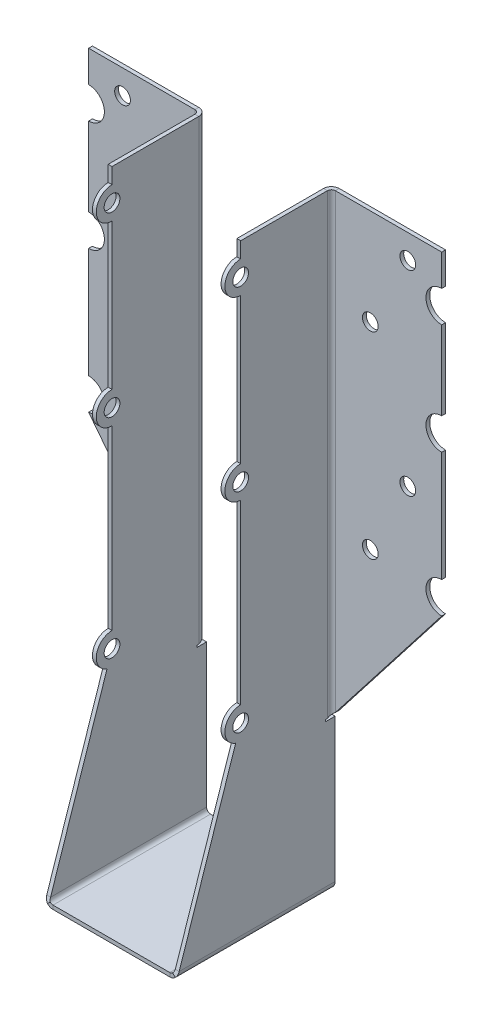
ISO-10303-21;
HEADER;
FILE_DESCRIPTION(('STEP AP214'),'2;1');
FILE_NAME('part.step','',(''),(''),'','','');
FILE_SCHEMA(('AUTOMOTIVE_DESIGN { 1 0 10303 214 1 1 1 1 }'));
ENDSEC;
DATA;
#1=APPLICATION_CONTEXT('core data for automotive mechanical design processes');
#2=APPLICATION_PROTOCOL_DEFINITION('international standard','automotive_design',2000,#1);
#3=PRODUCT_CONTEXT('',#1,'mechanical');
#4=PRODUCT('Part','Part','',(#3));
#5=PRODUCT_RELATED_PRODUCT_CATEGORY('part','',(#4));
#6=PRODUCT_DEFINITION_FORMATION('','',#4);
#7=PRODUCT_DEFINITION_CONTEXT('part definition',#1,'design');
#8=PRODUCT_DEFINITION('design','',#6,#7);
#9=PRODUCT_DEFINITION_SHAPE('','',#8);
#10=(LENGTH_UNIT() NAMED_UNIT(*) SI_UNIT(.MILLI.,.METRE.));
#11=(NAMED_UNIT(*) PLANE_ANGLE_UNIT() SI_UNIT($,.RADIAN.));
#12=(NAMED_UNIT(*) SI_UNIT($,.STERADIAN.) SOLID_ANGLE_UNIT());
#13=UNCERTAINTY_MEASURE_WITH_UNIT(LENGTH_MEASURE(1.E-05),#10,'distance_accuracy_value','');
#14=(GEOMETRIC_REPRESENTATION_CONTEXT(3) GLOBAL_UNCERTAINTY_ASSIGNED_CONTEXT((#13)) GLOBAL_UNIT_ASSIGNED_CONTEXT((#10,
#11,#12)) REPRESENTATION_CONTEXT('',''));
#15=CARTESIAN_POINT('',(0.,0.,0.));
#16=DIRECTION('',(0.,0.,1.));
#17=DIRECTION('',(1.,0.,0.));
#18=AXIS2_PLACEMENT_3D('',#15,#16,#17);
#19=CARTESIAN_POINT('',(-19.795760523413,61.0098805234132,-19.9999999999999));
#20=DIRECTION('',(0.,0.,-1.));
#21=DIRECTION('',(0.,1.,0.));
#22=AXIS2_PLACEMENT_3D('',#19,#20,#21);
#23=PLANE('',#22);
#24=DIRECTION('',(-1.,0.,0.));
#25=VECTOR('',#24,1.);
#26=CARTESIAN_POINT('',(-19.7957605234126,178.509880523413,-19.9999999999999));
#27=LINE('',#26,#25);
#28=CARTESIAN_POINT('',(-21.0098805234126,178.509880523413,-19.9999999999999));
#29=VERTEX_POINT('',#28);
#30=CARTESIAN_POINT('',(-19.7957605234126,178.509880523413,-19.9999999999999));
#31=VERTEX_POINT('',#30);
#32=EDGE_CURVE('E442',#29,#31,#27,.F.);
#33=ORIENTED_EDGE('',*,*,#32,.F.);
#34=DIRECTION('',(0.,-1.,0.));
#35=VECTOR('',#34,1.);
#36=CARTESIAN_POINT('',(-21.009880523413,61.0098805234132,-19.9999999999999));
#37=LINE('',#36,#35);
#38=CARTESIAN_POINT('',(-21.0098805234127,132.259880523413,-19.9999999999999));
#39=VERTEX_POINT('',#38);
#40=EDGE_CURVE('E431',#29,#39,#37,.T.);
#41=ORIENTED_EDGE('',*,*,#40,.T.);
#42=DIRECTION('',(-1.,0.,0.));
#43=VECTOR('',#42,1.);
#44=CARTESIAN_POINT('',(-19.7957605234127,132.259880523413,-19.9999999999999));
#45=LINE('',#44,#43);
#46=CARTESIAN_POINT('',(-19.7957605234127,132.259880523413,-19.9999999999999));
#47=VERTEX_POINT('',#46);
#48=EDGE_CURVE('E460',#47,#39,#45,.T.);
#49=ORIENTED_EDGE('',*,*,#48,.F.);
#50=DIRECTION('',(0.,-1.,0.));
#51=VECTOR('',#50,1.);
#52=CARTESIAN_POINT('',(-19.795760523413,61.0098805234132,-19.9999999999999));
#53=LINE('',#52,#51);
#54=EDGE_CURVE('E115',#31,#47,#53,.T.);
#55=ORIENTED_EDGE('',*,*,#54,.F.);
#56=EDGE_LOOP('',(#33,#41,#49,#55));
#57=FACE_BOUND('',#56,.T.);
#58=ADVANCED_FACE('F100',(#57),#23,.F.);
#59=DIRECTION('',(-1.,0.,0.));
#60=VECTOR('',#59,1.);
#61=CARTESIAN_POINT('',(-19.7957605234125,188.509880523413,-19.9999999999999));
#62=LINE('',#61,#60);
#63=CARTESIAN_POINT('',(-19.7957605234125,188.509880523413,-19.9999999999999));
#64=VERTEX_POINT('',#63);
#65=CARTESIAN_POINT('',(-21.0098805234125,188.509880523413,-19.9999999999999));
#66=VERTEX_POINT('',#65);
#67=EDGE_CURVE('E123',#64,#66,#62,.T.);
#68=ORIENTED_EDGE('',*,*,#67,.F.);
#69=CARTESIAN_POINT('',(-19.7957605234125,193.509880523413,-19.9999999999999));
#70=VERTEX_POINT('',#69);
#71=EDGE_CURVE('E641',#70,#64,#53,.T.);
#72=ORIENTED_EDGE('',*,*,#71,.F.);
#73=DIRECTION('',(-1.,0.,0.));
#74=VECTOR('',#73,1.);
#75=CARTESIAN_POINT('',(-19.7957605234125,193.509880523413,-19.9999999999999));
#76=LINE('',#75,#74);
#77=CARTESIAN_POINT('',(-21.0098805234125,193.509880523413,-19.9999999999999));
#78=VERTEX_POINT('',#77);
#79=EDGE_CURVE('E655',#70,#78,#76,.T.);
#80=ORIENTED_EDGE('',*,*,#79,.T.);
#81=EDGE_CURVE('E439',#78,#66,#37,.T.);
#82=ORIENTED_EDGE('',*,*,#81,.T.);
#83=EDGE_LOOP('',(#68,#72,#80,#82));
#84=FACE_BOUND('',#83,.T.);
#85=ADVANCED_FACE('F616',(#84),#23,.F.);
#86=DIRECTION('',(-1.,0.,0.));
#87=VECTOR('',#86,1.);
#88=CARTESIAN_POINT('',(-19.7957605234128,122.259880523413,-19.9999999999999));
#89=LINE('',#88,#87);
#90=CARTESIAN_POINT('',(-21.0098805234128,122.259880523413,-19.9999999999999));
#91=VERTEX_POINT('',#90);
#92=CARTESIAN_POINT('',(-19.7957605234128,122.259880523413,-19.9999999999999));
#93=VERTEX_POINT('',#92);
#94=EDGE_CURVE('E463',#91,#93,#89,.F.);
#95=ORIENTED_EDGE('',*,*,#94,.F.);
#96=CARTESIAN_POINT('',(-21.009880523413,66.0098805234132,-19.9999999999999));
#97=VERTEX_POINT('',#96);
#98=EDGE_CURVE('E440',#91,#97,#37,.T.);
#99=ORIENTED_EDGE('',*,*,#98,.T.);
#100=DIRECTION('',(-1.,0.,0.));
#101=VECTOR('',#100,1.);
#102=CARTESIAN_POINT('',(-19.795760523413,66.0098805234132,-19.9999999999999));
#103=LINE('',#102,#101);
#104=CARTESIAN_POINT('',(-19.795760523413,66.0098805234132,-19.9999999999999));
#105=VERTEX_POINT('',#104);
#106=EDGE_CURVE('E470',#105,#97,#103,.T.);
#107=ORIENTED_EDGE('',*,*,#106,.F.);
#108=EDGE_CURVE('E635',#93,#105,#53,.T.);
#109=ORIENTED_EDGE('',*,*,#108,.F.);
#110=EDGE_LOOP('',(#95,#99,#107,#109));
#111=FACE_BOUND('',#110,.T.);
#112=ADVANCED_FACE('F618',(#111),#23,.F.);
#113=CARTESIAN_POINT('',(-19.7957605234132,1.00988052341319,0.));
#114=DIRECTION('',(0.,-0.316227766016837,-0.948683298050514));
#115=DIRECTION('',(0.,0.948683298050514,-0.316227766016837));
#116=AXIS2_PLACEMENT_3D('',#113,#114,#115);
#117=PLANE('',#116);
#118=DIRECTION('',(-1.,0.,0.));
#119=VECTOR('',#118,1.);
#120=CARTESIAN_POINT('',(-19.795760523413,56.2664640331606,-18.4188611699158));
#121=LINE('',#120,#119);
#122=CARTESIAN_POINT('',(-21.009880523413,56.2664640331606,-18.4188611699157));
#123=VERTEX_POINT('',#122);
#124=CARTESIAN_POINT('',(-19.795760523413,56.2664640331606,-18.4188611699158));
#125=VERTEX_POINT('',#124);
#126=EDGE_CURVE('E13',#123,#125,#121,.F.);
#127=ORIENTED_EDGE('',*,*,#126,.F.);
#128=DIRECTION('',(0.,-0.948683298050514,0.316227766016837));
#129=VECTOR('',#128,1.);
#130=CARTESIAN_POINT('',(-21.0098805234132,1.0098805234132,0.));
#131=LINE('',#130,#129);
#132=CARTESIAN_POINT('',(-21.0098805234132,2.48412000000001,-0.491413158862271));
#133=VERTEX_POINT('',#132);
#134=EDGE_CURVE('E851',#123,#133,#131,.T.);
#135=ORIENTED_EDGE('',*,*,#134,.T.);
#136=CARTESIAN_POINT('',(-19.7957605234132,2.48412,-0.491413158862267));
#137=CARTESIAN_POINT('',(-21.0098805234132,2.48412,-0.491413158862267));
#138=B_SPLINE_CURVE_WITH_KNOTS('',1,(#136,#137),.UNSPECIFIED.,.F.,.F.,(2,2),(0.,1.),.UNSPECIFIED.);
#139=CARTESIAN_POINT('',(-19.7957605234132,2.48412,-0.491413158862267));
#140=VERTEX_POINT('',#139);
#141=EDGE_CURVE('E736',#133,#140,#138,.F.);
#142=ORIENTED_EDGE('',*,*,#141,.T.);
#143=DIRECTION('',(0.,-0.948683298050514,0.316227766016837));
#144=VECTOR('',#143,1.);
#145=CARTESIAN_POINT('',(-19.7957605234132,1.00988052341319,0.));
#146=LINE('',#145,#144);
#147=EDGE_CURVE('E643',#125,#140,#146,.T.);
#148=ORIENTED_EDGE('',*,*,#147,.F.);
#149=EDGE_LOOP('',(#127,#135,#142,#148));
#150=FACE_BOUND('',#149,.T.);
#151=ADVANCED_FACE('F625',(#150),#117,.F.);
#152=CARTESIAN_POINT('',(-21.0098805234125,193.509880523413,-49.9999999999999));
#153=DIRECTION('',(0.,0.,-1.));
#154=DIRECTION('',(1.,0.,0.));
#155=AXIS2_PLACEMENT_3D('',#152,#153,#154);
#156=PLANE('',#155);
#157=CARTESIAN_POINT('',(-33.3562022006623,162.997310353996,-49.9999999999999));
#158=DIRECTION('',(0.,0.,-1.));
#159=DIRECTION('',(-1.,0.,0.));
#160=AXIS2_PLACEMENT_3D('',#157,#158,#159);
#161=CIRCLE('',#160,2.5);
#162=CARTESIAN_POINT('',(-30.8562022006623,162.997310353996,-49.9999999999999));
#163=VERTEX_POINT('',#162);
#164=EDGE_CURVE('E482',#163,#163,#161,.T.);
#165=ORIENTED_EDGE('',*,*,#164,.F.);
#166=EDGE_LOOP('',(#165));
#167=FACE_BOUND('',#166,.T.);
#168=CARTESIAN_POINT('',(-45.2470443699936,185.827727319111,-49.9999999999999));
#169=DIRECTION('',(0.,0.,-1.));
#170=DIRECTION('',(-1.,0.,0.));
#171=AXIS2_PLACEMENT_3D('',#168,#169,#170);
#172=CIRCLE('',#171,2.5);
#173=CARTESIAN_POINT('',(-42.7470443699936,185.827727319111,-49.9999999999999));
#174=VERTEX_POINT('',#173);
#175=EDGE_CURVE('E494',#174,#174,#172,.T.);
#176=ORIENTED_EDGE('',*,*,#175,.F.);
#177=EDGE_LOOP('',(#176));
#178=FACE_BOUND('',#177,.T.);
#179=DIRECTION('',(0.,-1.,0.));
#180=VECTOR('',#179,1.);
#181=CARTESIAN_POINT('',(-56.0098805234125,193.509880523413,-50.));
#182=LINE('',#181,#180);
#183=CARTESIAN_POINT('',(-56.0098805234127,148.509880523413,-49.9999999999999));
#184=VERTEX_POINT('',#183);
#185=CARTESIAN_POINT('',(-56.0098805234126,173.509880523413,-50.));
#186=VERTEX_POINT('',#185);
#187=EDGE_CURVE('E527',#184,#186,#182,.F.);
#188=ORIENTED_EDGE('',*,*,#187,.T.);
#189=CARTESIAN_POINT('',(-56.0098805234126,178.509880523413,-49.9999999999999));
#190=DIRECTION('',(0.,0.,-1.));
#191=DIRECTION('',(-1.,0.,0.));
#192=AXIS2_PLACEMENT_3D('',#189,#190,#191);
#193=CIRCLE('',#192,5.);
#194=CARTESIAN_POINT('',(-56.0098805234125,183.509880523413,-49.9999999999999));
#195=VERTEX_POINT('',#194);
#196=EDGE_CURVE('E500',#195,#186,#193,.T.);
#197=ORIENTED_EDGE('',*,*,#196,.F.);
#198=CARTESIAN_POINT('',(-56.0098805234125,193.509880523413,-50.));
#199=VERTEX_POINT('',#198);
#200=EDGE_CURVE('E528',#195,#199,#182,.F.);
#201=ORIENTED_EDGE('',*,*,#200,.T.);
#202=DIRECTION('',(-1.,0.,0.));
#203=VECTOR('',#202,1.);
#204=CARTESIAN_POINT('',(-21.0098805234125,193.509880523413,-49.9999999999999));
#205=LINE('',#204,#203);
#206=CARTESIAN_POINT('',(-22.2798805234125,193.509880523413,-49.9999999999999));
#207=VERTEX_POINT('',#206);
#208=EDGE_CURVE('E529',#199,#207,#205,.F.);
#209=ORIENTED_EDGE('',*,*,#208,.T.);
#210=DIRECTION('',(0.,-1.,0.));
#211=VECTOR('',#210,1.);
#212=CARTESIAN_POINT('',(-22.2798805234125,193.509880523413,-49.9999999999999));
#213=LINE('',#212,#211);
#214=CARTESIAN_POINT('',(-22.279880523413,50.1427376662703,-50.));
#215=VERTEX_POINT('',#214);
#216=EDGE_CURVE('E543',#207,#215,#213,.T.);
#217=ORIENTED_EDGE('',*,*,#216,.T.);
#218=DIRECTION('',(0.613940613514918,-0.789352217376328,0.));
#219=VECTOR('',#218,1.);
#220=CARTESIAN_POINT('',(-91.2791112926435,138.856034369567,-50.0000000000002));
#221=LINE('',#220,#219);
#222=CARTESIAN_POINT('',(-56.0098805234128,93.5098805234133,-50.0000000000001));
#223=VERTEX_POINT('',#222);
#224=EDGE_CURVE('E521',#215,#223,#221,.F.);
#225=ORIENTED_EDGE('',*,*,#224,.T.);
#226=CARTESIAN_POINT('',(-56.0098805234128,98.5098805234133,-49.9999999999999));
#227=DIRECTION('',(0.,0.,-1.));
#228=DIRECTION('',(-1.,0.,0.));
#229=AXIS2_PLACEMENT_3D('',#226,#227,#228);
#230=CIRCLE('',#229,5.00000000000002);
#231=CARTESIAN_POINT('',(-56.0098805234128,103.509880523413,-49.9999999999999));
#232=VERTEX_POINT('',#231);
#233=EDGE_CURVE('E510',#232,#223,#230,.T.);
#234=ORIENTED_EDGE('',*,*,#233,.F.);
#235=CARTESIAN_POINT('',(-56.0098805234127,138.509880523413,-50.0000000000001));
#236=VERTEX_POINT('',#235);
#237=EDGE_CURVE('E524',#232,#236,#182,.F.);
#238=ORIENTED_EDGE('',*,*,#237,.T.);
#239=CARTESIAN_POINT('',(-56.0098805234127,143.509880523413,-49.9999999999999));
#240=DIRECTION('',(0.,0.,-1.));
#241=DIRECTION('',(-1.,0.,0.));
#242=AXIS2_PLACEMENT_3D('',#239,#240,#241);
#243=CIRCLE('',#242,5.);
#244=EDGE_CURVE('E505',#184,#236,#243,.T.);
#245=ORIENTED_EDGE('',*,*,#244,.F.);
#246=EDGE_LOOP('',(#188,#197,#201,#209,#217,#225,#234,#238,#245));
#247=FACE_BOUND('',#246,.T.);
#248=CARTESIAN_POINT('',(-45.2470443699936,123.757531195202,-49.9999999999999));
#249=DIRECTION('',(0.,0.,-1.));
#250=DIRECTION('',(-1.,0.,0.));
#251=AXIS2_PLACEMENT_3D('',#248,#249,#250);
#252=CIRCLE('',#251,2.5);
#253=CARTESIAN_POINT('',(-42.7470443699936,123.757531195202,-49.9999999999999));
#254=VERTEX_POINT('',#253);
#255=EDGE_CURVE('E488',#254,#254,#252,.T.);
#256=ORIENTED_EDGE('',*,*,#255,.F.);
#257=EDGE_LOOP('',(#256));
#258=FACE_BOUND('',#257,.T.);
#259=CARTESIAN_POINT('',(-33.3562022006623,100.451480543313,-49.9999999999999));
#260=DIRECTION('',(0.,0.,-1.));
#261=DIRECTION('',(-1.,0.,0.));
#262=AXIS2_PLACEMENT_3D('',#259,#260,#261);
#263=CIRCLE('',#262,2.5);
#264=CARTESIAN_POINT('',(-30.8562022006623,100.451480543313,-49.9999999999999));
#265=VERTEX_POINT('',#264);
#266=EDGE_CURVE('E476',#265,#265,#263,.T.);
#267=ORIENTED_EDGE('',*,*,#266,.F.);
#268=EDGE_LOOP('',(#267));
#269=FACE_BOUND('',#268,.T.);
#270=ADVANCED_FACE('F630',(#167,#178,#247,#258,#269),#156,.T.);
#271=CARTESIAN_POINT('',(-21.0098805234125,193.509880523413,-48.7858799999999));
#272=DIRECTION('',(0.,0.,-1.));
#273=DIRECTION('',(1.,0.,0.));
#274=AXIS2_PLACEMENT_3D('',#271,#272,#273);
#275=PLANE('',#274);
#276=CARTESIAN_POINT('',(-33.3562022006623,162.997310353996,-48.7858799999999));
#277=DIRECTION('',(0.,0.,-1.));
#278=DIRECTION('',(-1.,0.,0.));
#279=AXIS2_PLACEMENT_3D('',#276,#277,#278);
#280=CIRCLE('',#279,2.5);
#281=CARTESIAN_POINT('',(-30.8562022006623,162.997310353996,-48.7858799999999));
#282=VERTEX_POINT('',#281);
#283=EDGE_CURVE('E479',#282,#282,#280,.T.);
#284=ORIENTED_EDGE('',*,*,#283,.T.);
#285=EDGE_LOOP('',(#284));
#286=FACE_BOUND('',#285,.T.);
#287=CARTESIAN_POINT('',(-45.2470443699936,185.827727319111,-48.7858799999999));
#288=DIRECTION('',(0.,0.,-1.));
#289=DIRECTION('',(-1.,0.,0.));
#290=AXIS2_PLACEMENT_3D('',#287,#288,#289);
#291=CIRCLE('',#290,2.5);
#292=CARTESIAN_POINT('',(-42.7470443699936,185.827727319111,-48.7858799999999));
#293=VERTEX_POINT('',#292);
#294=EDGE_CURVE('E491',#293,#293,#291,.T.);
#295=ORIENTED_EDGE('',*,*,#294,.T.);
#296=EDGE_LOOP('',(#295));
#297=FACE_BOUND('',#296,.T.);
#298=CARTESIAN_POINT('',(-56.0098805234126,178.509880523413,-48.7858799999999));
#299=DIRECTION('',(0.,0.,-1.));
#300=DIRECTION('',(-1.,0.,0.));
#301=AXIS2_PLACEMENT_3D('',#298,#299,#300);
#302=CIRCLE('',#301,5.);
#303=CARTESIAN_POINT('',(-56.0098805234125,183.509880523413,-48.7858799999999));
#304=VERTEX_POINT('',#303);
#305=CARTESIAN_POINT('',(-56.0098805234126,173.509880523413,-48.7858799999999));
#306=VERTEX_POINT('',#305);
#307=EDGE_CURVE('E497',#304,#306,#302,.T.);
#308=ORIENTED_EDGE('',*,*,#307,.T.);
#309=DIRECTION('',(0.,1.,0.));
#310=VECTOR('',#309,1.);
#311=CARTESIAN_POINT('',(-56.0098805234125,193.509880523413,-48.78588));
#312=LINE('',#311,#310);
#313=CARTESIAN_POINT('',(-56.0098805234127,148.509880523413,-48.7858799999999));
#314=VERTEX_POINT('',#313);
#315=EDGE_CURVE('E538',#314,#306,#312,.T.);
#316=ORIENTED_EDGE('',*,*,#315,.F.);
#317=CARTESIAN_POINT('',(-56.0098805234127,143.509880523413,-48.7858799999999));
#318=DIRECTION('',(0.,0.,-1.));
#319=DIRECTION('',(-1.,0.,0.));
#320=AXIS2_PLACEMENT_3D('',#317,#318,#319);
#321=CIRCLE('',#320,5.);
#322=CARTESIAN_POINT('',(-56.0098805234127,138.509880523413,-48.7858799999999));
#323=VERTEX_POINT('',#322);
#324=EDGE_CURVE('E502',#314,#323,#321,.T.);
#325=ORIENTED_EDGE('',*,*,#324,.T.);
#326=CARTESIAN_POINT('',(-56.0098805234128,103.509880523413,-48.7858799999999));
#327=VERTEX_POINT('',#326);
#328=EDGE_CURVE('E535',#327,#323,#312,.T.);
#329=ORIENTED_EDGE('',*,*,#328,.F.);
#330=CARTESIAN_POINT('',(-56.0098805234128,98.5098805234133,-48.7858799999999));
#331=DIRECTION('',(0.,0.,-1.));
#332=DIRECTION('',(-1.,0.,0.));
#333=AXIS2_PLACEMENT_3D('',#330,#331,#332);
#334=CIRCLE('',#333,5.00000000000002);
#335=CARTESIAN_POINT('',(-56.0098805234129,93.5098805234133,-48.7858799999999));
#336=VERTEX_POINT('',#335);
#337=EDGE_CURVE('E507',#327,#336,#334,.T.);
#338=ORIENTED_EDGE('',*,*,#337,.T.);
#339=DIRECTION('',(-0.613940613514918,0.789352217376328,0.));
#340=VECTOR('',#339,1.);
#341=CARTESIAN_POINT('',(-56.0098805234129,93.5098805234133,-48.7858800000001));
#342=LINE('',#341,#340);
#343=CARTESIAN_POINT('',(-22.2798805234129,50.1427376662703,-48.7858799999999));
#344=VERTEX_POINT('',#343);
#345=EDGE_CURVE('E532',#344,#336,#342,.T.);
#346=ORIENTED_EDGE('',*,*,#345,.F.);
#347=DIRECTION('',(0.,1.,0.));
#348=VECTOR('',#347,1.);
#349=CARTESIAN_POINT('',(-22.2798805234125,193.509880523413,-48.7858799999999));
#350=LINE('',#349,#348);
#351=CARTESIAN_POINT('',(-22.2798805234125,193.509880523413,-48.7858799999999));
#352=VERTEX_POINT('',#351);
#353=EDGE_CURVE('E549',#352,#344,#350,.F.);
#354=ORIENTED_EDGE('',*,*,#353,.F.);
#355=DIRECTION('',(1.,0.,0.));
#356=VECTOR('',#355,1.);
#357=CARTESIAN_POINT('',(-21.0098805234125,193.509880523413,-48.7858799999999));
#358=LINE('',#357,#356);
#359=CARTESIAN_POINT('',(-56.0098805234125,193.509880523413,-48.78588));
#360=VERTEX_POINT('',#359);
#361=EDGE_CURVE('E540',#360,#352,#358,.T.);
#362=ORIENTED_EDGE('',*,*,#361,.F.);
#363=EDGE_CURVE('E539',#304,#360,#312,.T.);
#364=ORIENTED_EDGE('',*,*,#363,.F.);
#365=EDGE_LOOP('',(#308,#316,#325,#329,#338,#346,#354,#362,#364));
#366=FACE_BOUND('',#365,.T.);
#367=CARTESIAN_POINT('',(-45.2470443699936,123.757531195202,-48.7858799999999));
#368=DIRECTION('',(0.,0.,-1.));
#369=DIRECTION('',(-1.,0.,0.));
#370=AXIS2_PLACEMENT_3D('',#367,#368,#369);
#371=CIRCLE('',#370,2.5);
#372=CARTESIAN_POINT('',(-42.7470443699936,123.757531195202,-48.7858799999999));
#373=VERTEX_POINT('',#372);
#374=EDGE_CURVE('E485',#373,#373,#371,.T.);
#375=ORIENTED_EDGE('',*,*,#374,.T.);
#376=EDGE_LOOP('',(#375));
#377=FACE_BOUND('',#376,.T.);
#378=CARTESIAN_POINT('',(-33.3562022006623,100.451480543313,-48.7858799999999));
#379=DIRECTION('',(0.,0.,-1.));
#380=DIRECTION('',(-1.,0.,0.));
#381=AXIS2_PLACEMENT_3D('',#378,#379,#380);
#382=CIRCLE('',#381,2.5);
#383=CARTESIAN_POINT('',(-30.8562022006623,100.451480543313,-48.7858799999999));
#384=VERTEX_POINT('',#383);
#385=EDGE_CURVE('E475',#384,#384,#382,.T.);
#386=ORIENTED_EDGE('',*,*,#385,.T.);
#387=EDGE_LOOP('',(#386));
#388=FACE_BOUND('',#387,.T.);
#389=ADVANCED_FACE('F921',(#286,#297,#366,#377,#388),#275,.F.);
#390=CARTESIAN_POINT('',(-56.0098805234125,193.509880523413,-50.));
#391=DIRECTION('',(1.,0.,0.));
#392=DIRECTION('',(0.,0.,-1.));
#393=AXIS2_PLACEMENT_3D('',#390,#391,#392);
#394=PLANE('',#393);
#395=DIRECTION('',(0.,0.,1.));
#396=VECTOR('',#395,1.);
#397=CARTESIAN_POINT('',(-56.0098805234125,183.509880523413,-49.9999999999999));
#398=LINE('',#397,#396);
#399=EDGE_CURVE('E108',#304,#195,#398,.F.);
#400=ORIENTED_EDGE('',*,*,#399,.F.);
#401=ORIENTED_EDGE('',*,*,#363,.T.);
#402=DIRECTION('',(0.,0.,1.));
#403=VECTOR('',#402,1.);
#404=CARTESIAN_POINT('',(-56.0098805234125,193.509880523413,-50.));
#405=LINE('',#404,#403);
#406=EDGE_CURVE('E518',#199,#360,#405,.T.);
#407=ORIENTED_EDGE('',*,*,#406,.F.);
#408=ORIENTED_EDGE('',*,*,#200,.F.);
#409=EDGE_LOOP('',(#400,#401,#407,#408));
#410=FACE_BOUND('',#409,.T.);
#411=ADVANCED_FACE('F906',(#410),#394,.F.);
#412=DIRECTION('',(0.,0.,1.));
#413=VECTOR('',#412,1.);
#414=CARTESIAN_POINT('',(-56.0098805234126,173.509880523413,-49.9999999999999));
#415=LINE('',#414,#413);
#416=EDGE_CURVE('E891',#186,#306,#415,.T.);
#417=ORIENTED_EDGE('',*,*,#416,.F.);
#418=ORIENTED_EDGE('',*,*,#187,.F.);
#419=DIRECTION('',(0.,0.,1.));
#420=VECTOR('',#419,1.);
#421=CARTESIAN_POINT('',(-56.0098805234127,148.509880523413,-49.9999999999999));
#422=LINE('',#421,#420);
#423=EDGE_CURVE('E890',#314,#184,#422,.F.);
#424=ORIENTED_EDGE('',*,*,#423,.F.);
#425=ORIENTED_EDGE('',*,*,#315,.T.);
#426=EDGE_LOOP('',(#417,#418,#424,#425));
#427=FACE_BOUND('',#426,.T.);
#428=ADVANCED_FACE('F932',(#427),#394,.F.);
#429=DIRECTION('',(0.,0.,1.));
#430=VECTOR('',#429,1.);
#431=CARTESIAN_POINT('',(-56.0098805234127,138.509880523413,-49.9999999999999));
#432=LINE('',#431,#430);
#433=EDGE_CURVE('E888',#236,#323,#432,.T.);
#434=ORIENTED_EDGE('',*,*,#433,.F.);
#435=ORIENTED_EDGE('',*,*,#237,.F.);
#436=DIRECTION('',(0.,0.,1.));
#437=VECTOR('',#436,1.);
#438=CARTESIAN_POINT('',(-56.0098805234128,103.509880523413,-49.9999999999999));
#439=LINE('',#438,#437);
#440=EDGE_CURVE('E886',#327,#232,#439,.F.);
#441=ORIENTED_EDGE('',*,*,#440,.F.);
#442=ORIENTED_EDGE('',*,*,#328,.T.);
#443=EDGE_LOOP('',(#434,#435,#441,#442));
#444=FACE_BOUND('',#443,.T.);
#445=ADVANCED_FACE('F927',(#444),#394,.F.);
#446=CARTESIAN_POINT('',(-19.7957605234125,193.509880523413,-19.9999999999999));
#447=DIRECTION('',(0.,-1.,0.));
#448=DIRECTION('',(0.,0.,-1.));
#449=AXIS2_PLACEMENT_3D('',#446,#447,#448);
#450=PLANE('',#449);
#451=DIRECTION('',(1.,0.,0.));
#452=VECTOR('',#451,1.);
#453=CARTESIAN_POINT('',(-21.0098805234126,193.509880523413,-47.5158799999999));
#454=LINE('',#453,#452);
#455=CARTESIAN_POINT('',(-21.0098805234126,193.509880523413,-47.5158799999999));
#456=VERTEX_POINT('',#455);
#457=CARTESIAN_POINT('',(-19.7957605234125,193.509880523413,-47.5158799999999));
#458=VERTEX_POINT('',#457);
#459=EDGE_CURVE('E566',#456,#458,#454,.T.);
#460=ORIENTED_EDGE('',*,*,#459,.F.);
#461=DIRECTION('',(0.,0.,1.));
#462=VECTOR('',#461,1.);
#463=CARTESIAN_POINT('',(-21.0098805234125,193.509880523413,-19.9999999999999));
#464=LINE('',#463,#462);
#465=EDGE_CURVE('E653',#456,#78,#464,.T.);
#466=ORIENTED_EDGE('',*,*,#465,.T.);
#467=ORIENTED_EDGE('',*,*,#79,.F.);
#468=DIRECTION('',(0.,0.,1.));
#469=VECTOR('',#468,1.);
#470=CARTESIAN_POINT('',(-19.7957605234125,193.509880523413,-19.9999999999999));
#471=LINE('',#470,#469);
#472=EDGE_CURVE('E644',#458,#70,#471,.T.);
#473=ORIENTED_EDGE('',*,*,#472,.F.);
#474=EDGE_LOOP('',(#460,#466,#467,#473));
#475=FACE_BOUND('',#474,.T.);
#476=ADVANCED_FACE('F1608',(#475),#450,.F.);
#477=CARTESIAN_POINT('',(-19.7957605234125,193.509880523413,-49.9999999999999));
#478=DIRECTION('',(1.,0.,0.));
#479=DIRECTION('',(0.,0.,1.));
#480=AXIS2_PLACEMENT_3D('',#477,#478,#479);
#481=PLANE('',#480);
#482=CARTESIAN_POINT('',(-19.795760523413,61.0098805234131,-19.9999999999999));
#483=DIRECTION('',(1.,0.,0.));
#484=DIRECTION('',(0.,1.,0.));
#485=AXIS2_PLACEMENT_3D('',#482,#483,#484);
#486=CIRCLE('',#485,2.5);
#487=CARTESIAN_POINT('',(-19.795760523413,63.5098805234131,-19.9999999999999));
#488=VERTEX_POINT('',#487);
#489=EDGE_CURVE('E2013',#488,#488,#486,.T.);
#490=ORIENTED_EDGE('',*,*,#489,.F.);
#491=EDGE_LOOP('',(#490));
#492=FACE_BOUND('',#491,.T.);
#493=CARTESIAN_POINT('',(-19.7957605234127,127.259880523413,-19.9999999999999));
#494=DIRECTION('',(1.,0.,0.));
#495=DIRECTION('',(0.,1.,0.));
#496=AXIS2_PLACEMENT_3D('',#493,#494,#495);
#497=CIRCLE('',#496,2.5);
#498=CARTESIAN_POINT('',(-19.7957605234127,129.759880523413,-19.9999999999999));
#499=VERTEX_POINT('',#498);
#500=EDGE_CURVE('E2034',#499,#499,#497,.T.);
#501=ORIENTED_EDGE('',*,*,#500,.F.);
#502=EDGE_LOOP('',(#501));
#503=FACE_BOUND('',#502,.T.);
#504=CARTESIAN_POINT('',(-19.7957605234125,183.509880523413,-19.9999999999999));
#505=DIRECTION('',(1.,0.,0.));
#506=DIRECTION('',(0.,1.,0.));
#507=AXIS2_PLACEMENT_3D('',#504,#505,#506);
#508=CIRCLE('',#507,2.5);
#509=CARTESIAN_POINT('',(-19.7957605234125,186.009880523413,-19.9999999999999));
#510=VERTEX_POINT('',#509);
#511=EDGE_CURVE('E449',#510,#510,#508,.T.);
#512=ORIENTED_EDGE('',*,*,#511,.F.);
#513=EDGE_LOOP('',(#512));
#514=FACE_BOUND('',#513,.T.);
#515=ORIENTED_EDGE('',*,*,#71,.T.);
#516=CARTESIAN_POINT('',(-19.7957605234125,183.509880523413,-19.9999999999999));
#517=DIRECTION('',(1.,0.,0.));
#518=DIRECTION('',(0.,1.,0.));
#519=AXIS2_PLACEMENT_3D('',#516,#517,#518);
#520=CIRCLE('',#519,5.);
#521=EDGE_CURVE('E448',#64,#31,#520,.T.);
#522=ORIENTED_EDGE('',*,*,#521,.T.);
#523=ORIENTED_EDGE('',*,*,#54,.T.);
#524=CARTESIAN_POINT('',(-19.7957605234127,127.259880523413,-19.9999999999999));
#525=DIRECTION('',(1.,0.,0.));
#526=DIRECTION('',(0.,1.,0.));
#527=AXIS2_PLACEMENT_3D('',#524,#525,#526);
#528=CIRCLE('',#527,5.);
#529=EDGE_CURVE('E457',#47,#93,#528,.T.);
#530=ORIENTED_EDGE('',*,*,#529,.T.);
#531=ORIENTED_EDGE('',*,*,#108,.T.);
#532=CARTESIAN_POINT('',(-19.795760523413,61.0098805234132,-19.9999999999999));
#533=DIRECTION('',(1.,0.,0.));
#534=DIRECTION('',(0.,1.,0.));
#535=AXIS2_PLACEMENT_3D('',#532,#533,#534);
#536=CIRCLE('',#535,5.);
#537=EDGE_CURVE('E467',#105,#125,#536,.T.);
#538=ORIENTED_EDGE('',*,*,#537,.T.);
#539=ORIENTED_EDGE('',*,*,#147,.T.);
#540=DIRECTION('',(0.,0.,1.));
#541=VECTOR('',#540,1.);
#542=CARTESIAN_POINT('',(-19.7957605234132,2.48412000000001,-49.9999999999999));
#543=LINE('',#542,#541);
#544=CARTESIAN_POINT('',(-19.7957605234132,2.48412000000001,-50.));
#545=VERTEX_POINT('',#544);
#546=EDGE_CURVE('E848',#545,#140,#543,.T.);
#547=ORIENTED_EDGE('',*,*,#546,.F.);
#548=DIRECTION('',(0.,1.,0.));
#549=VECTOR('',#548,1.);
#550=CARTESIAN_POINT('',(-19.795760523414,-231.490119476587,-50.));
#551=LINE('',#550,#549);
#552=CARTESIAN_POINT('',(-19.795760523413,47.9028205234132,-49.9999999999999));
#553=VERTEX_POINT('',#552);
#554=EDGE_CURVE('E650',#545,#553,#551,.T.);
#555=ORIENTED_EDGE('',*,*,#554,.T.);
#556=DIRECTION('',(0.,0.,1.));
#557=VECTOR('',#556,1.);
#558=CARTESIAN_POINT('',(-19.795760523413,47.9028205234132,-50.0000000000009));
#559=LINE('',#558,#557);
#560=CARTESIAN_POINT('',(-19.795760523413,47.9028205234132,-46.9088199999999));
#561=VERTEX_POINT('',#560);
#562=EDGE_CURVE('E960',#553,#561,#559,.T.);
#563=ORIENTED_EDGE('',*,*,#562,.T.);
#564=DIRECTION('',(0.,1.,0.));
#565=VECTOR('',#564,1.);
#566=CARTESIAN_POINT('',(-19.7957605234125,193.509880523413,-46.9088199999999));
#567=LINE('',#566,#565);
#568=CARTESIAN_POINT('',(-19.795760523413,48.5098805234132,-46.9088199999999));
#569=VERTEX_POINT('',#568);
#570=EDGE_CURVE('E958',#561,#569,#567,.T.);
#571=ORIENTED_EDGE('',*,*,#570,.T.);
#572=DIRECTION('',(0.,0.,-1.));
#573=VECTOR('',#572,1.);
#574=CARTESIAN_POINT('',(-19.795760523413,48.5098805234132,-49.9999999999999));
#575=LINE('',#574,#573);
#576=CARTESIAN_POINT('',(-19.795760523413,48.5098805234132,-47.51588));
#577=VERTEX_POINT('',#576);
#578=EDGE_CURVE('E942',#569,#577,#575,.T.);
#579=ORIENTED_EDGE('',*,*,#578,.T.);
#580=DIRECTION('',(0.,-1.,0.));
#581=VECTOR('',#580,1.);
#582=CARTESIAN_POINT('',(-19.795760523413,48.5098805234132,-47.51588));
#583=LINE('',#582,#581);
#584=EDGE_CURVE('E557',#577,#458,#583,.F.);
#585=ORIENTED_EDGE('',*,*,#584,.T.);
#586=ORIENTED_EDGE('',*,*,#472,.T.);
#587=EDGE_LOOP('',(#515,#522,#523,#530,#531,#538,#539,#547,#555,#563,#571,#579,#585,#586));
#588=FACE_BOUND('',#587,.T.);
#589=ADVANCED_FACE('F640',(#492,#503,#514,#588),#481,.T.);
#590=CARTESIAN_POINT('',(-19.795760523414,-231.490119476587,-50.));
#591=DIRECTION('',(0.,0.,1.));
#592=DIRECTION('',(0.,-1.,0.));
#593=AXIS2_PLACEMENT_3D('',#590,#591,#592);
#594=PLANE('',#593);
#595=DIRECTION('',(1.,0.,0.));
#596=VECTOR('',#595,1.);
#597=CARTESIAN_POINT('',(-21.009880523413,47.9028205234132,-49.9999999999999));
#598=LINE('',#597,#596);
#599=CARTESIAN_POINT('',(-21.009880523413,47.9028205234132,-49.9999999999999));
#600=VERTEX_POINT('',#599);
#601=EDGE_CURVE('E954',#600,#553,#598,.T.);
#602=ORIENTED_EDGE('',*,*,#601,.T.);
#603=ORIENTED_EDGE('',*,*,#554,.F.);
#604=DIRECTION('',(-1.,0.,0.));
#605=VECTOR('',#604,1.);
#606=CARTESIAN_POINT('',(-19.7957605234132,2.48412000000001,-50.));
#607=LINE('',#606,#605);
#608=CARTESIAN_POINT('',(-21.0098805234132,2.48412000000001,-50.));
#609=VERTEX_POINT('',#608);
#610=EDGE_CURVE('E647',#545,#609,#607,.T.);
#611=ORIENTED_EDGE('',*,*,#610,.T.);
#612=DIRECTION('',(0.,1.,0.));
#613=VECTOR('',#612,1.);
#614=CARTESIAN_POINT('',(-21.009880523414,-231.490119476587,-50.));
#615=LINE('',#614,#613);
#616=EDGE_CURVE('E861',#609,#600,#615,.T.);
#617=ORIENTED_EDGE('',*,*,#616,.T.);
#618=EDGE_LOOP('',(#602,#603,#611,#617));
#619=FACE_BOUND('',#618,.T.);
#620=ADVANCED_FACE('F1161',(#619),#594,.F.);
#621=CARTESIAN_POINT('',(-21.0098805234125,193.509880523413,-49.9999999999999));
#622=DIRECTION('',(1.,0.,0.));
#623=DIRECTION('',(0.,0.,1.));
#624=AXIS2_PLACEMENT_3D('',#621,#622,#623);
#625=PLANE('',#624);
#626=CARTESIAN_POINT('',(-21.009880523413,61.0098805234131,-19.9999999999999));
#627=DIRECTION('',(1.,0.,0.));
#628=DIRECTION('',(0.,1.,0.));
#629=AXIS2_PLACEMENT_3D('',#626,#627,#628);
#630=CIRCLE('',#629,2.5);
#631=CARTESIAN_POINT('',(-21.009880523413,63.5098805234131,-19.9999999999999));
#632=VERTEX_POINT('',#631);
#633=EDGE_CURVE('E2016',#632,#632,#630,.T.);
#634=ORIENTED_EDGE('',*,*,#633,.T.);
#635=EDGE_LOOP('',(#634));
#636=FACE_BOUND('',#635,.T.);
#637=CARTESIAN_POINT('',(-21.0098805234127,127.259880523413,-19.9999999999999));
#638=DIRECTION('',(1.,0.,0.));
#639=DIRECTION('',(0.,1.,0.));
#640=AXIS2_PLACEMENT_3D('',#637,#638,#639);
#641=CIRCLE('',#640,2.5);
#642=CARTESIAN_POINT('',(-21.0098805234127,129.759880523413,-19.9999999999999));
#643=VERTEX_POINT('',#642);
#644=EDGE_CURVE('E2031',#643,#643,#641,.T.);
#645=ORIENTED_EDGE('',*,*,#644,.T.);
#646=EDGE_LOOP('',(#645));
#647=FACE_BOUND('',#646,.T.);
#648=CARTESIAN_POINT('',(-21.0098805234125,183.509880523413,-19.9999999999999));
#649=DIRECTION('',(1.,0.,0.));
#650=DIRECTION('',(0.,1.,0.));
#651=AXIS2_PLACEMENT_3D('',#648,#649,#650);
#652=CIRCLE('',#651,2.5);
#653=CARTESIAN_POINT('',(-21.0098805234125,186.009880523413,-19.9999999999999));
#654=VERTEX_POINT('',#653);
#655=EDGE_CURVE('E453',#654,#654,#652,.T.);
#656=ORIENTED_EDGE('',*,*,#655,.T.);
#657=EDGE_LOOP('',(#656));
#658=FACE_BOUND('',#657,.T.);
#659=ORIENTED_EDGE('',*,*,#40,.F.);
#660=CARTESIAN_POINT('',(-21.0098805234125,183.509880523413,-19.9999999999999));
#661=DIRECTION('',(1.,0.,0.));
#662=DIRECTION('',(0.,1.,0.));
#663=AXIS2_PLACEMENT_3D('',#660,#661,#662);
#664=CIRCLE('',#663,5.);
#665=EDGE_CURVE('E435',#66,#29,#664,.T.);
#666=ORIENTED_EDGE('',*,*,#665,.F.);
#667=ORIENTED_EDGE('',*,*,#81,.F.);
#668=ORIENTED_EDGE('',*,*,#465,.F.);
#669=DIRECTION('',(0.,-1.,0.));
#670=VECTOR('',#669,1.);
#671=CARTESIAN_POINT('',(-21.009880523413,48.5098805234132,-47.5158799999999));
#672=LINE('',#671,#670);
#673=CARTESIAN_POINT('',(-21.009880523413,48.5098805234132,-47.5158799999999));
#674=VERTEX_POINT('',#673);
#675=EDGE_CURVE('E562',#674,#456,#672,.F.);
#676=ORIENTED_EDGE('',*,*,#675,.F.);
#677=DIRECTION('',(0.,0.,-1.));
#678=VECTOR('',#677,1.);
#679=CARTESIAN_POINT('',(-21.009880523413,48.5098805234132,-46.9088199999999));
#680=LINE('',#679,#678);
#681=CARTESIAN_POINT('',(-21.009880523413,48.5098805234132,-46.9088199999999));
#682=VERTEX_POINT('',#681);
#683=EDGE_CURVE('E944',#682,#674,#680,.T.);
#684=ORIENTED_EDGE('',*,*,#683,.F.);
#685=DIRECTION('',(0.,1.,0.));
#686=VECTOR('',#685,1.);
#687=CARTESIAN_POINT('',(-21.009880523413,47.9028205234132,-46.9088199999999));
#688=LINE('',#687,#686);
#689=CARTESIAN_POINT('',(-21.009880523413,47.9028205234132,-46.9088199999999));
#690=VERTEX_POINT('',#689);
#691=EDGE_CURVE('E949',#690,#682,#688,.T.);
#692=ORIENTED_EDGE('',*,*,#691,.F.);
#693=DIRECTION('',(0.,0.,1.));
#694=VECTOR('',#693,1.);
#695=CARTESIAN_POINT('',(-21.009880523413,47.9028205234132,-49.9999999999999));
#696=LINE('',#695,#694);
#697=EDGE_CURVE('E956',#600,#690,#696,.T.);
#698=ORIENTED_EDGE('',*,*,#697,.F.);
#699=ORIENTED_EDGE('',*,*,#616,.F.);
#700=DIRECTION('',(0.,0.,1.));
#701=VECTOR('',#700,1.);
#702=CARTESIAN_POINT('',(-21.0098805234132,2.48412000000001,-49.9999999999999));
#703=LINE('',#702,#701);
#704=EDGE_CURVE('E854',#609,#133,#703,.T.);
#705=ORIENTED_EDGE('',*,*,#704,.T.);
#706=ORIENTED_EDGE('',*,*,#134,.F.);
#707=CARTESIAN_POINT('',(-21.009880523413,61.0098805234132,-19.9999999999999));
#708=DIRECTION('',(1.,0.,0.));
#709=DIRECTION('',(0.,1.,0.));
#710=AXIS2_PLACEMENT_3D('',#707,#708,#709);
#711=CIRCLE('',#710,5.);
#712=EDGE_CURVE('E466',#97,#123,#711,.T.);
#713=ORIENTED_EDGE('',*,*,#712,.F.);
#714=ORIENTED_EDGE('',*,*,#98,.F.);
#715=CARTESIAN_POINT('',(-21.0098805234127,127.259880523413,-19.9999999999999));
#716=DIRECTION('',(1.,0.,0.));
#717=DIRECTION('',(0.,1.,0.));
#718=AXIS2_PLACEMENT_3D('',#715,#716,#717);
#719=CIRCLE('',#718,5.);
#720=EDGE_CURVE('E437',#39,#91,#719,.T.);
#721=ORIENTED_EDGE('',*,*,#720,.F.);
#722=EDGE_LOOP('',(#659,#666,#667,#668,#676,#684,#692,#698,#699,#705,#706,#713,#714,#721));
#723=FACE_BOUND('',#722,.T.);
#724=ADVANCED_FACE('F432',(#636,#647,#658,#723),#625,.F.);
#725=CARTESIAN_POINT('',(19.795760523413,61.0098805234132,-19.9999999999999));
#726=DIRECTION('',(0.,0.,-1.));
#727=DIRECTION('',(0.,-1.,0.));
#728=AXIS2_PLACEMENT_3D('',#725,#726,#727);
#729=PLANE('',#728);
#730=DIRECTION('',(0.,1.,0.));
#731=VECTOR('',#730,1.);
#732=CARTESIAN_POINT('',(19.795760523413,61.0098805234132,-19.9999999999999));
#733=LINE('',#732,#731);
#734=CARTESIAN_POINT('',(19.7957605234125,188.509880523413,-19.9999999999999));
#735=VERTEX_POINT('',#734);
#736=CARTESIAN_POINT('',(19.7957605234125,193.509880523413,-19.9999999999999));
#737=VERTEX_POINT('',#736);
#738=EDGE_CURVE('E1203',#735,#737,#733,.T.);
#739=ORIENTED_EDGE('',*,*,#738,.F.);
#740=DIRECTION('',(1.,0.,0.));
#741=VECTOR('',#740,1.);
#742=CARTESIAN_POINT('',(19.7957605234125,188.509880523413,-19.9999999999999));
#743=LINE('',#742,#741);
#744=CARTESIAN_POINT('',(21.0098805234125,188.509880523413,-19.9999999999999));
#745=VERTEX_POINT('',#744);
#746=EDGE_CURVE('E970',#735,#745,#743,.T.);
#747=ORIENTED_EDGE('',*,*,#746,.T.);
#748=DIRECTION('',(0.,1.,0.));
#749=VECTOR('',#748,1.);
#750=CARTESIAN_POINT('',(21.009880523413,61.0098805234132,-19.9999999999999));
#751=LINE('',#750,#749);
#752=CARTESIAN_POINT('',(21.0098805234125,193.509880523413,-19.9999999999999));
#753=VERTEX_POINT('',#752);
#754=EDGE_CURVE('E2181',#745,#753,#751,.T.);
#755=ORIENTED_EDGE('',*,*,#754,.T.);
#756=DIRECTION('',(1.,0.,0.));
#757=VECTOR('',#756,1.);
#758=CARTESIAN_POINT('',(19.7957605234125,193.509880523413,-19.9999999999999));
#759=LINE('',#758,#757);
#760=EDGE_CURVE('E1219',#737,#753,#759,.T.);
#761=ORIENTED_EDGE('',*,*,#760,.F.);
#762=EDGE_LOOP('',(#739,#747,#755,#761));
#763=FACE_BOUND('',#762,.T.);
#764=ADVANCED_FACE('F785',(#763),#729,.F.);
#765=CARTESIAN_POINT('',(21.0098805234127,132.259880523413,-19.9999999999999));
#766=VERTEX_POINT('',#765);
#767=CARTESIAN_POINT('',(21.0098805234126,178.509880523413,-19.9999999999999));
#768=VERTEX_POINT('',#767);
#769=EDGE_CURVE('E2182',#766,#768,#751,.T.);
#770=ORIENTED_EDGE('',*,*,#769,.T.);
#771=DIRECTION('',(1.,0.,0.));
#772=VECTOR('',#771,1.);
#773=CARTESIAN_POINT('',(19.7957605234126,178.509880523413,-19.9999999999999));
#774=LINE('',#773,#772);
#775=CARTESIAN_POINT('',(19.7957605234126,178.509880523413,-19.9999999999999));
#776=VERTEX_POINT('',#775);
#777=EDGE_CURVE('E966',#768,#776,#774,.F.);
#778=ORIENTED_EDGE('',*,*,#777,.T.);
#779=CARTESIAN_POINT('',(19.7957605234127,132.259880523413,-19.9999999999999));
#780=VERTEX_POINT('',#779);
#781=EDGE_CURVE('E1207',#780,#776,#733,.T.);
#782=ORIENTED_EDGE('',*,*,#781,.F.);
#783=DIRECTION('',(1.,0.,0.));
#784=VECTOR('',#783,1.);
#785=CARTESIAN_POINT('',(19.7957605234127,132.259880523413,-19.9999999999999));
#786=LINE('',#785,#784);
#787=EDGE_CURVE('E883',#780,#766,#786,.T.);
#788=ORIENTED_EDGE('',*,*,#787,.T.);
#789=EDGE_LOOP('',(#770,#778,#782,#788));
#790=FACE_BOUND('',#789,.T.);
#791=ADVANCED_FACE('F786',(#790),#729,.F.);
#792=CARTESIAN_POINT('',(56.0098805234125,193.509880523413,-50.));
#793=DIRECTION('',(1.,0.,0.));
#794=DIRECTION('',(0.,0.,-1.));
#795=AXIS2_PLACEMENT_3D('',#792,#793,#794);
#796=PLANE('',#795);
#797=DIRECTION('',(0.,0.,1.));
#798=VECTOR('',#797,1.);
#799=CARTESIAN_POINT('',(56.0098805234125,183.509880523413,-49.9999999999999));
#800=LINE('',#799,#798);
#801=CARTESIAN_POINT('',(56.0098805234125,183.509880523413,-49.9999999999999));
#802=VERTEX_POINT('',#801);
#803=CARTESIAN_POINT('',(56.0098805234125,183.509880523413,-48.78588));
#804=VERTEX_POINT('',#803);
#805=EDGE_CURVE('E1018',#802,#804,#800,.T.);
#806=ORIENTED_EDGE('',*,*,#805,.F.);
#807=DIRECTION('',(0.,1.,0.));
#808=VECTOR('',#807,1.);
#809=CARTESIAN_POINT('',(56.0098805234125,193.509880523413,-50.));
#810=LINE('',#809,#808);
#811=CARTESIAN_POINT('',(56.0098805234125,193.509880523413,-50.));
#812=VERTEX_POINT('',#811);
#813=EDGE_CURVE('E1045',#802,#812,#810,.T.);
#814=ORIENTED_EDGE('',*,*,#813,.T.);
#815=DIRECTION('',(0.,0.,1.));
#816=VECTOR('',#815,1.);
#817=CARTESIAN_POINT('',(56.0098805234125,193.509880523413,-50.));
#818=LINE('',#817,#816);
#819=CARTESIAN_POINT('',(56.0098805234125,193.509880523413,-48.78588));
#820=VERTEX_POINT('',#819);
#821=EDGE_CURVE('E1031',#812,#820,#818,.T.);
#822=ORIENTED_EDGE('',*,*,#821,.T.);
#823=DIRECTION('',(0.,-1.,0.));
#824=VECTOR('',#823,1.);
#825=CARTESIAN_POINT('',(56.0098805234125,193.509880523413,-48.78588));
#826=LINE('',#825,#824);
#827=EDGE_CURVE('E1056',#804,#820,#826,.F.);
#828=ORIENTED_EDGE('',*,*,#827,.F.);
#829=EDGE_LOOP('',(#806,#814,#822,#828));
#830=FACE_BOUND('',#829,.T.);
#831=ADVANCED_FACE('F1276',(#830),#796,.T.);
#832=DIRECTION('',(0.,0.,1.));
#833=VECTOR('',#832,1.);
#834=CARTESIAN_POINT('',(56.0098805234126,173.509880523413,-49.9999999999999));
#835=LINE('',#834,#833);
#836=CARTESIAN_POINT('',(56.0098805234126,173.509880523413,-48.7858799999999));
#837=VERTEX_POINT('',#836);
#838=CARTESIAN_POINT('',(56.0098805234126,173.509880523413,-49.9999999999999));
#839=VERTEX_POINT('',#838);
#840=EDGE_CURVE('E1015',#837,#839,#835,.F.);
#841=ORIENTED_EDGE('',*,*,#840,.F.);
#842=CARTESIAN_POINT('',(56.0098805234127,148.509880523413,-48.7858799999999));
#843=VERTEX_POINT('',#842);
#844=EDGE_CURVE('E1055',#843,#837,#826,.F.);
#845=ORIENTED_EDGE('',*,*,#844,.F.);
#846=DIRECTION('',(0.,0.,1.));
#847=VECTOR('',#846,1.);
#848=CARTESIAN_POINT('',(56.0098805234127,148.509880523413,-49.9999999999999));
#849=LINE('',#848,#847);
#850=CARTESIAN_POINT('',(56.0098805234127,148.509880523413,-49.9999999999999));
#851=VERTEX_POINT('',#850);
#852=EDGE_CURVE('E877',#851,#843,#849,.T.);
#853=ORIENTED_EDGE('',*,*,#852,.F.);
#854=EDGE_CURVE('E1044',#851,#839,#810,.T.);
#855=ORIENTED_EDGE('',*,*,#854,.T.);
#856=EDGE_LOOP('',(#841,#845,#853,#855));
#857=FACE_BOUND('',#856,.T.);
#858=ADVANCED_FACE('F777',(#857),#796,.T.);
#859=CARTESIAN_POINT('',(19.7957605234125,193.509880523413,-19.9999999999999));
#860=DIRECTION('',(0.,-1.,0.));
#861=DIRECTION('',(0.,0.,1.));
#862=AXIS2_PLACEMENT_3D('',#859,#860,#861);
#863=PLANE('',#862);
#864=DIRECTION('',(-1.,0.,0.));
#865=VECTOR('',#864,1.);
#866=CARTESIAN_POINT('',(21.0098805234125,193.509880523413,-47.5158799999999));
#867=LINE('',#866,#865);
#868=CARTESIAN_POINT('',(21.0098805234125,193.509880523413,-47.5158799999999));
#869=VERTEX_POINT('',#868);
#870=CARTESIAN_POINT('',(19.7957605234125,193.509880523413,-47.5158799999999));
#871=VERTEX_POINT('',#870);
#872=EDGE_CURVE('E1082',#869,#871,#867,.T.);
#873=ORIENTED_EDGE('',*,*,#872,.T.);
#874=DIRECTION('',(0.,0.,-1.));
#875=VECTOR('',#874,1.);
#876=CARTESIAN_POINT('',(19.7957605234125,193.509880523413,-19.9999999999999));
#877=LINE('',#876,#875);
#878=EDGE_CURVE('E817',#737,#871,#877,.T.);
#879=ORIENTED_EDGE('',*,*,#878,.F.);
#880=ORIENTED_EDGE('',*,*,#760,.T.);
#881=DIRECTION('',(0.,0.,-1.));
#882=VECTOR('',#881,1.);
#883=CARTESIAN_POINT('',(21.0098805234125,193.509880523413,-19.9999999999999));
#884=LINE('',#883,#882);
#885=EDGE_CURVE('E1220',#753,#869,#884,.T.);
#886=ORIENTED_EDGE('',*,*,#885,.T.);
#887=EDGE_LOOP('',(#873,#879,#880,#886));
#888=FACE_BOUND('',#887,.T.);
#889=ADVANCED_FACE('F773',(#888),#863,.F.);
#890=CARTESIAN_POINT('',(19.795760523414,-231.490119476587,-50.));
#891=DIRECTION('',(-1.,0.,0.));
#892=DIRECTION('',(0.,0.,1.));
#893=AXIS2_PLACEMENT_3D('',#890,#891,#892);
#894=PLANE('',#893);
#895=CARTESIAN_POINT('',(19.795760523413,61.0098805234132,-19.9999999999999));
#896=DIRECTION('',(-1.,0.,0.));
#897=DIRECTION('',(0.,-1.,0.));
#898=AXIS2_PLACEMENT_3D('',#895,#896,#897);
#899=CIRCLE('',#898,2.5);
#900=CARTESIAN_POINT('',(19.795760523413,58.5098805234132,-19.9999999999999));
#901=VERTEX_POINT('',#900);
#902=EDGE_CURVE('E2017',#901,#901,#899,.T.);
#903=ORIENTED_EDGE('',*,*,#902,.F.);
#904=EDGE_LOOP('',(#903));
#905=FACE_BOUND('',#904,.T.);
#906=CARTESIAN_POINT('',(19.7957605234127,127.259880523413,-19.9999999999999));
#907=DIRECTION('',(-1.,0.,0.));
#908=DIRECTION('',(0.,-1.,0.));
#909=AXIS2_PLACEMENT_3D('',#906,#907,#908);
#910=CIRCLE('',#909,2.5);
#911=CARTESIAN_POINT('',(19.7957605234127,124.759880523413,-19.9999999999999));
#912=VERTEX_POINT('',#911);
#913=EDGE_CURVE('E2028',#912,#912,#910,.T.);
#914=ORIENTED_EDGE('',*,*,#913,.F.);
#915=EDGE_LOOP('',(#914));
#916=FACE_BOUND('',#915,.T.);
#917=CARTESIAN_POINT('',(19.7957605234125,183.509880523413,-19.9999999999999));
#918=DIRECTION('',(-1.,0.,0.));
#919=DIRECTION('',(0.,-1.,0.));
#920=AXIS2_PLACEMENT_3D('',#917,#918,#919);
#921=CIRCLE('',#920,2.5);
#922=CARTESIAN_POINT('',(19.7957605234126,181.009880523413,-19.9999999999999));
#923=VERTEX_POINT('',#922);
#924=EDGE_CURVE('E2040',#923,#923,#921,.T.);
#925=ORIENTED_EDGE('',*,*,#924,.F.);
#926=EDGE_LOOP('',(#925));
#927=FACE_BOUND('',#926,.T.);
#928=ORIENTED_EDGE('',*,*,#781,.T.);
#929=CARTESIAN_POINT('',(19.7957605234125,183.509880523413,-19.9999999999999));
#930=DIRECTION('',(1.,0.,0.));
#931=DIRECTION('',(0.,1.,0.));
#932=AXIS2_PLACEMENT_3D('',#929,#930,#931);
#933=CIRCLE('',#932,5.);
#934=EDGE_CURVE('E963',#735,#776,#933,.T.);
#935=ORIENTED_EDGE('',*,*,#934,.F.);
#936=ORIENTED_EDGE('',*,*,#738,.T.);
#937=ORIENTED_EDGE('',*,*,#878,.T.);
#938=DIRECTION('',(0.,1.,0.));
#939=VECTOR('',#938,1.);
#940=CARTESIAN_POINT('',(19.7957605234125,193.509880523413,-47.5158799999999));
#941=LINE('',#940,#939);
#942=CARTESIAN_POINT('',(19.795760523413,48.5098805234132,-47.5158799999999));
#943=VERTEX_POINT('',#942);
#944=EDGE_CURVE('E1073',#871,#943,#941,.F.);
#945=ORIENTED_EDGE('',*,*,#944,.T.);
#946=DIRECTION('',(0.,0.,1.));
#947=VECTOR('',#946,1.);
#948=CARTESIAN_POINT('',(19.795760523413,48.5098805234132,-50.));
#949=LINE('',#948,#947);
#950=CARTESIAN_POINT('',(19.795760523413,48.5098805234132,-46.9088199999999));
#951=VERTEX_POINT('',#950);
#952=EDGE_CURVE('E1146',#943,#951,#949,.T.);
#953=ORIENTED_EDGE('',*,*,#952,.T.);
#954=DIRECTION('',(0.,-1.,0.));
#955=VECTOR('',#954,1.);
#956=CARTESIAN_POINT('',(19.795760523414,-231.490119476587,-46.9088199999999));
#957=LINE('',#956,#955);
#958=CARTESIAN_POINT('',(19.795760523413,47.9028205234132,-46.9088199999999));
#959=VERTEX_POINT('',#958);
#960=EDGE_CURVE('E1150',#951,#959,#957,.T.);
#961=ORIENTED_EDGE('',*,*,#960,.T.);
#962=DIRECTION('',(0.,0.,-1.));
#963=VECTOR('',#962,1.);
#964=CARTESIAN_POINT('',(19.795760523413,47.9028205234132,-50.0000000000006));
#965=LINE('',#964,#963);
#966=CARTESIAN_POINT('',(19.7957605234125,47.9028205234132,-49.9999999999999));
#967=VERTEX_POINT('',#966);
#968=EDGE_CURVE('E1144',#959,#967,#965,.T.);
#969=ORIENTED_EDGE('',*,*,#968,.T.);
#970=DIRECTION('',(0.,-1.,0.));
#971=VECTOR('',#970,1.);
#972=CARTESIAN_POINT('',(19.7957605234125,193.509880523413,-49.9999999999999));
#973=LINE('',#972,#971);
#974=CARTESIAN_POINT('',(19.7957605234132,2.48412,-50.));
#975=VERTEX_POINT('',#974);
#976=EDGE_CURVE('E1199',#967,#975,#973,.T.);
#977=ORIENTED_EDGE('',*,*,#976,.T.);
#978=DIRECTION('',(0.,0.,1.));
#979=VECTOR('',#978,1.);
#980=CARTESIAN_POINT('',(19.7957605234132,2.48412000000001,-50.));
#981=LINE('',#980,#979);
#982=CARTESIAN_POINT('',(19.7957605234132,2.48412000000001,-0.491413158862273));
#983=VERTEX_POINT('',#982);
#984=EDGE_CURVE('E1196',#975,#983,#981,.T.);
#985=ORIENTED_EDGE('',*,*,#984,.T.);
#986=DIRECTION('',(0.,0.948683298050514,-0.316227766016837));
#987=VECTOR('',#986,1.);
#988=CARTESIAN_POINT('',(19.7957605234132,1.00988052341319,0.));
#989=LINE('',#988,#987);
#990=CARTESIAN_POINT('',(19.795760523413,56.2664640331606,-18.4188611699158));
#991=VERTEX_POINT('',#990);
#992=EDGE_CURVE('E1198',#983,#991,#989,.T.);
#993=ORIENTED_EDGE('',*,*,#992,.T.);
#994=CARTESIAN_POINT('',(19.795760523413,61.0098805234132,-19.9999999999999));
#995=DIRECTION('',(1.,0.,0.));
#996=DIRECTION('',(0.,1.,0.));
#997=AXIS2_PLACEMENT_3D('',#994,#995,#996);
#998=CIRCLE('',#997,5.);
#999=CARTESIAN_POINT('',(19.795760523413,66.0098805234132,-19.9999999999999));
#1000=VERTEX_POINT('',#999);
#1001=EDGE_CURVE('E980',#1000,#991,#998,.T.);
#1002=ORIENTED_EDGE('',*,*,#1001,.F.);
#1003=CARTESIAN_POINT('',(19.7957605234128,122.259880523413,-19.9999999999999));
#1004=VERTEX_POINT('',#1003);
#1005=EDGE_CURVE('E1209',#1000,#1004,#733,.T.);
#1006=ORIENTED_EDGE('',*,*,#1005,.T.);
#1007=CARTESIAN_POINT('',(19.7957605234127,127.259880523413,-19.9999999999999));
#1008=DIRECTION('',(1.,0.,0.));
#1009=DIRECTION('',(0.,1.,0.));
#1010=AXIS2_PLACEMENT_3D('',#1007,#1008,#1009);
#1011=CIRCLE('',#1010,5.);
#1012=EDGE_CURVE('E974',#780,#1004,#1011,.T.);
#1013=ORIENTED_EDGE('',*,*,#1012,.F.);
#1014=EDGE_LOOP('',(#928,#935,#936,#937,#945,#953,#961,#969,#977,#985,#993,#1002,#1006,#1013));
#1015=FACE_BOUND('',#1014,.T.);
#1016=ADVANCED_FACE('F776',(#905,#916,#927,#1015),#894,.T.);
#1017=CARTESIAN_POINT('',(21.009880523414,-231.490119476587,-50.));
#1018=DIRECTION('',(-1.,0.,0.));
#1019=DIRECTION('',(0.,0.,1.));
#1020=AXIS2_PLACEMENT_3D('',#1017,#1018,#1019);
#1021=PLANE('',#1020);
#1022=CARTESIAN_POINT('',(21.009880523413,61.0098805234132,-19.9999999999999));
#1023=DIRECTION('',(1.,0.,0.));
#1024=DIRECTION('',(0.,1.,0.));
#1025=AXIS2_PLACEMENT_3D('',#1022,#1023,#1024);
#1026=CIRCLE('',#1025,2.5);
#1027=CARTESIAN_POINT('',(21.009880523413,63.5098805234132,-19.9999999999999));
#1028=VERTEX_POINT('',#1027);
#1029=EDGE_CURVE('E2022',#1028,#1028,#1026,.T.);
#1030=ORIENTED_EDGE('',*,*,#1029,.F.);
#1031=EDGE_LOOP('',(#1030));
#1032=FACE_BOUND('',#1031,.T.);
#1033=CARTESIAN_POINT('',(21.0098805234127,127.259880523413,-19.9999999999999));
#1034=DIRECTION('',(1.,0.,0.));
#1035=DIRECTION('',(0.,1.,0.));
#1036=AXIS2_PLACEMENT_3D('',#1033,#1034,#1035);
#1037=CIRCLE('',#1036,2.5);
#1038=CARTESIAN_POINT('',(21.0098805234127,129.759880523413,-19.9999999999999));
#1039=VERTEX_POINT('',#1038);
#1040=EDGE_CURVE('E2019',#1039,#1039,#1037,.T.);
#1041=ORIENTED_EDGE('',*,*,#1040,.F.);
#1042=EDGE_LOOP('',(#1041));
#1043=FACE_BOUND('',#1042,.T.);
#1044=CARTESIAN_POINT('',(21.0098805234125,183.509880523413,-19.9999999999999));
#1045=DIRECTION('',(1.,0.,0.));
#1046=DIRECTION('',(0.,1.,0.));
#1047=AXIS2_PLACEMENT_3D('',#1044,#1045,#1046);
#1048=CIRCLE('',#1047,2.5);
#1049=CARTESIAN_POINT('',(21.0098805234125,186.009880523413,-19.9999999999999));
#1050=VERTEX_POINT('',#1049);
#1051=EDGE_CURVE('E2037',#1050,#1050,#1048,.T.);
#1052=ORIENTED_EDGE('',*,*,#1051,.F.);
#1053=EDGE_LOOP('',(#1052));
#1054=FACE_BOUND('',#1053,.T.);
#1055=ORIENTED_EDGE('',*,*,#754,.F.);
#1056=CARTESIAN_POINT('',(21.0098805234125,183.509880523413,-19.9999999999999));
#1057=DIRECTION('',(1.,0.,0.));
#1058=DIRECTION('',(0.,1.,0.));
#1059=AXIS2_PLACEMENT_3D('',#1056,#1057,#1058);
#1060=CIRCLE('',#1059,5.);
#1061=EDGE_CURVE('E962',#745,#768,#1060,.T.);
#1062=ORIENTED_EDGE('',*,*,#1061,.T.);
#1063=ORIENTED_EDGE('',*,*,#769,.F.);
#1064=CARTESIAN_POINT('',(21.0098805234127,127.259880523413,-19.9999999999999));
#1065=DIRECTION('',(1.,0.,0.));
#1066=DIRECTION('',(0.,1.,0.));
#1067=AXIS2_PLACEMENT_3D('',#1064,#1065,#1066);
#1068=CIRCLE('',#1067,5.);
#1069=CARTESIAN_POINT('',(21.0098805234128,122.259880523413,-19.9999999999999));
#1070=VERTEX_POINT('',#1069);
#1071=EDGE_CURVE('E973',#766,#1070,#1068,.T.);
#1072=ORIENTED_EDGE('',*,*,#1071,.T.);
#1073=CARTESIAN_POINT('',(21.009880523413,66.0098805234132,-19.9999999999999));
#1074=VERTEX_POINT('',#1073);
#1075=EDGE_CURVE('E2184',#1074,#1070,#751,.T.);
#1076=ORIENTED_EDGE('',*,*,#1075,.F.);
#1077=CARTESIAN_POINT('',(21.009880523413,61.0098805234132,-19.9999999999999));
#1078=DIRECTION('',(1.,0.,0.));
#1079=DIRECTION('',(0.,1.,0.));
#1080=AXIS2_PLACEMENT_3D('',#1077,#1078,#1079);
#1081=CIRCLE('',#1080,5.);
#1082=CARTESIAN_POINT('',(21.009880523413,56.2664640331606,-18.4188611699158));
#1083=VERTEX_POINT('',#1082);
#1084=EDGE_CURVE('E977',#1074,#1083,#1081,.T.);
#1085=ORIENTED_EDGE('',*,*,#1084,.T.);
#1086=DIRECTION('',(0.,0.948683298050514,-0.316227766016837));
#1087=VECTOR('',#1086,1.);
#1088=CARTESIAN_POINT('',(21.0098805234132,1.0098805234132,0.));
#1089=LINE('',#1088,#1087);
#1090=CARTESIAN_POINT('',(21.0098805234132,2.48412000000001,-0.491413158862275));
#1091=VERTEX_POINT('',#1090);
#1092=EDGE_CURVE('E815',#1091,#1083,#1089,.T.);
#1093=ORIENTED_EDGE('',*,*,#1092,.F.);
#1094=DIRECTION('',(0.,0.,1.));
#1095=VECTOR('',#1094,1.);
#1096=CARTESIAN_POINT('',(21.0098805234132,2.48412000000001,-50.));
#1097=LINE('',#1096,#1095);
#1098=CARTESIAN_POINT('',(21.0098805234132,2.48412000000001,-50.));
#1099=VERTEX_POINT('',#1098);
#1100=EDGE_CURVE('E803',#1099,#1091,#1097,.T.);
#1101=ORIENTED_EDGE('',*,*,#1100,.F.);
#1102=DIRECTION('',(0.,-1.,0.));
#1103=VECTOR('',#1102,1.);
#1104=CARTESIAN_POINT('',(21.0098805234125,193.509880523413,-49.9999999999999));
#1105=LINE('',#1104,#1103);
#1106=CARTESIAN_POINT('',(21.009880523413,47.9028205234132,-49.9999999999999));
#1107=VERTEX_POINT('',#1106);
#1108=EDGE_CURVE('E762',#1107,#1099,#1105,.T.);
#1109=ORIENTED_EDGE('',*,*,#1108,.F.);
#1110=DIRECTION('',(0.,0.,-1.));
#1111=VECTOR('',#1110,1.);
#1112=CARTESIAN_POINT('',(21.0098805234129,47.9028205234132,-46.9088199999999));
#1113=LINE('',#1112,#1111);
#1114=CARTESIAN_POINT('',(21.009880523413,47.9028205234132,-46.9088199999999));
#1115=VERTEX_POINT('',#1114);
#1116=EDGE_CURVE('E2190',#1115,#1107,#1113,.T.);
#1117=ORIENTED_EDGE('',*,*,#1116,.F.);
#1118=DIRECTION('',(0.,-1.,0.));
#1119=VECTOR('',#1118,1.);
#1120=CARTESIAN_POINT('',(21.0098805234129,48.5098805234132,-46.9088199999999));
#1121=LINE('',#1120,#1119);
#1122=CARTESIAN_POINT('',(21.009880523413,48.5098805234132,-46.9088199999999));
#1123=VERTEX_POINT('',#1122);
#1124=EDGE_CURVE('E1140',#1123,#1115,#1121,.T.);
#1125=ORIENTED_EDGE('',*,*,#1124,.F.);
#1126=DIRECTION('',(0.,0.,1.));
#1127=VECTOR('',#1126,1.);
#1128=CARTESIAN_POINT('',(21.0098805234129,48.5098805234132,-47.5158799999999));
#1129=LINE('',#1128,#1127);
#1130=CARTESIAN_POINT('',(21.0098805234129,48.5098805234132,-47.5158799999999));
#1131=VERTEX_POINT('',#1130);
#1132=EDGE_CURVE('E1138',#1131,#1123,#1129,.T.);
#1133=ORIENTED_EDGE('',*,*,#1132,.F.);
#1134=DIRECTION('',(0.,1.,0.));
#1135=VECTOR('',#1134,1.);
#1136=CARTESIAN_POINT('',(21.0098805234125,193.509880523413,-47.5158799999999));
#1137=LINE('',#1136,#1135);
#1138=EDGE_CURVE('E1077',#869,#1131,#1137,.F.);
#1139=ORIENTED_EDGE('',*,*,#1138,.F.);
#1140=ORIENTED_EDGE('',*,*,#885,.F.);
#1141=EDGE_LOOP('',(#1055,#1062,#1063,#1072,#1076,#1085,#1093,#1101,#1109,#1117,#1125,#1133,
#1139,#1140));
#1142=FACE_BOUND('',#1141,.T.);
#1143=ADVANCED_FACE('F789',(#1032,#1043,#1054,#1142),#1021,.F.);
#1144=CARTESIAN_POINT('',(19.7957605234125,193.509880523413,-49.9999999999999));
#1145=DIRECTION('',(0.,0.,1.));
#1146=DIRECTION('',(0.,1.,0.));
#1147=AXIS2_PLACEMENT_3D('',#1144,#1145,#1146);
#1148=PLANE('',#1147);
#1149=DIRECTION('',(-1.,0.,0.));
#1150=VECTOR('',#1149,1.);
#1151=CARTESIAN_POINT('',(21.009880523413,47.9028205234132,-49.9999999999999));
#1152=LINE('',#1151,#1150);
#1153=EDGE_CURVE('E2188',#1107,#967,#1152,.T.);
#1154=ORIENTED_EDGE('',*,*,#1153,.F.);
#1155=ORIENTED_EDGE('',*,*,#1108,.T.);
#1156=DIRECTION('',(1.,0.,0.));
#1157=VECTOR('',#1156,1.);
#1158=CARTESIAN_POINT('',(19.7957605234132,2.48412000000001,-50.));
#1159=LINE('',#1158,#1157);
#1160=EDGE_CURVE('E812',#975,#1099,#1159,.T.);
#1161=ORIENTED_EDGE('',*,*,#1160,.F.);
#1162=ORIENTED_EDGE('',*,*,#976,.F.);
#1163=EDGE_LOOP('',(#1154,#1155,#1161,#1162));
#1164=FACE_BOUND('',#1163,.T.);
#1165=ADVANCED_FACE('F1304',(#1164),#1148,.F.);
#1166=CARTESIAN_POINT('',(-212.5,1.21412,-50.));
#1167=DIRECTION('',(0.,1.,0.));
#1168=DIRECTION('',(0.,0.,1.));
#1169=AXIS2_PLACEMENT_3D('',#1166,#1167,#1168);
#1170=PLANE('',#1169);
#1171=DIRECTION('',(-1.,0.,0.));
#1172=VECTOR('',#1171,1.);
#1173=CARTESIAN_POINT('',(212.5,1.21412,-50.));
#1174=LINE('',#1173,#1172);
#1175=CARTESIAN_POINT('',(18.5257605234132,1.21412,-50.));
#1176=VERTEX_POINT('',#1175);
#1177=CARTESIAN_POINT('',(-18.5257605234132,1.21412,-50.));
#1178=VERTEX_POINT('',#1177);
#1179=EDGE_CURVE('E842',#1176,#1178,#1174,.T.);
#1180=ORIENTED_EDGE('',*,*,#1179,.T.);
#1181=DIRECTION('',(0.,0.,1.));
#1182=VECTOR('',#1181,1.);
#1183=CARTESIAN_POINT('',(-18.5257605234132,1.21412,-49.9999999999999));
#1184=LINE('',#1183,#1182);
#1185=CARTESIAN_POINT('',(-18.5257605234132,1.21412,0.));
#1186=VERTEX_POINT('',#1185);
#1187=EDGE_CURVE('E820',#1178,#1186,#1184,.T.);
#1188=ORIENTED_EDGE('',*,*,#1187,.T.);
#1189=DIRECTION('',(1.,0.,0.));
#1190=VECTOR('',#1189,1.);
#1191=CARTESIAN_POINT('',(-20.,1.21412,0.));
#1192=LINE('',#1191,#1190);
#1193=CARTESIAN_POINT('',(18.5257605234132,1.21412,0.));
#1194=VERTEX_POINT('',#1193);
#1195=EDGE_CURVE('E839',#1186,#1194,#1192,.T.);
#1196=ORIENTED_EDGE('',*,*,#1195,.T.);
#1197=DIRECTION('',(0.,0.,1.));
#1198=VECTOR('',#1197,1.);
#1199=CARTESIAN_POINT('',(18.5257605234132,1.21412,-50.));
#1200=LINE('',#1199,#1198);
#1201=EDGE_CURVE('E845',#1176,#1194,#1200,.T.);
#1202=ORIENTED_EDGE('',*,*,#1201,.F.);
#1203=EDGE_LOOP('',(#1180,#1188,#1196,#1202));
#1204=FACE_BOUND('',#1203,.T.);
#1205=ADVANCED_FACE('F1177',(#1204),#1170,.T.);
#1206=CARTESIAN_POINT('',(-212.5,0.,-50.));
#1207=DIRECTION('',(0.,1.,0.));
#1208=DIRECTION('',(0.,0.,1.));
#1209=AXIS2_PLACEMENT_3D('',#1206,#1207,#1208);
#1210=PLANE('',#1209);
#1211=DIRECTION('',(0.,0.,1.));
#1212=VECTOR('',#1211,1.);
#1213=CARTESIAN_POINT('',(-18.5257605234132,0.,-49.9999999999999));
#1214=LINE('',#1213,#1212);
#1215=CARTESIAN_POINT('',(-18.5257605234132,0.,-50.));
#1216=VERTEX_POINT('',#1215);
#1217=CARTESIAN_POINT('',(-18.5257605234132,0.,0.));
#1218=VERTEX_POINT('',#1217);
#1219=EDGE_CURVE('E827',#1216,#1218,#1214,.T.);
#1220=ORIENTED_EDGE('',*,*,#1219,.F.);
#1221=DIRECTION('',(-1.,0.,0.));
#1222=VECTOR('',#1221,1.);
#1223=CARTESIAN_POINT('',(212.5,0.,-50.));
#1224=LINE('',#1223,#1222);
#1225=CARTESIAN_POINT('',(18.5257605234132,0.,-50.));
#1226=VERTEX_POINT('',#1225);
#1227=EDGE_CURVE('E837',#1226,#1216,#1224,.T.);
#1228=ORIENTED_EDGE('',*,*,#1227,.F.);
#1229=DIRECTION('',(0.,0.,1.));
#1230=VECTOR('',#1229,1.);
#1231=CARTESIAN_POINT('',(18.5257605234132,0.,-50.));
#1232=LINE('',#1231,#1230);
#1233=CARTESIAN_POINT('',(18.5257605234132,0.,0.));
#1234=VERTEX_POINT('',#1233);
#1235=EDGE_CURVE('E1186',#1226,#1234,#1232,.T.);
#1236=ORIENTED_EDGE('',*,*,#1235,.T.);
#1237=DIRECTION('',(1.,0.,0.));
#1238=VECTOR('',#1237,1.);
#1239=CARTESIAN_POINT('',(-20.,0.,0.));
#1240=LINE('',#1239,#1238);
#1241=EDGE_CURVE('E834',#1218,#1234,#1240,.T.);
#1242=ORIENTED_EDGE('',*,*,#1241,.F.);
#1243=EDGE_LOOP('',(#1220,#1228,#1236,#1242));
#1244=FACE_BOUND('',#1243,.T.);
#1245=ADVANCED_FACE('F102',(#1244),#1210,.F.);
#1246=CARTESIAN_POINT('',(212.5,1.21412,-50.));
#1247=DIRECTION('',(0.,0.,1.));
#1248=DIRECTION('',(1.,0.,0.));
#1249=AXIS2_PLACEMENT_3D('',#1246,#1247,#1248);
#1250=PLANE('',#1249);
#1251=DIRECTION('',(0.,-1.,0.));
#1252=VECTOR('',#1251,1.);
#1253=CARTESIAN_POINT('',(-18.5257605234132,1.21412,-50.));
#1254=LINE('',#1253,#1252);
#1255=EDGE_CURVE('E823',#1178,#1216,#1254,.T.);
#1256=ORIENTED_EDGE('',*,*,#1255,.F.);
#1257=ORIENTED_EDGE('',*,*,#1179,.F.);
#1258=DIRECTION('',(0.,-1.,0.));
#1259=VECTOR('',#1258,1.);
#1260=CARTESIAN_POINT('',(18.5257605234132,1.21412,-50.));
#1261=LINE('',#1260,#1259);
#1262=EDGE_CURVE('E824',#1176,#1226,#1261,.T.);
#1263=ORIENTED_EDGE('',*,*,#1262,.T.);
#1264=ORIENTED_EDGE('',*,*,#1227,.T.);
#1265=EDGE_LOOP('',(#1256,#1257,#1263,#1264));
#1266=FACE_BOUND('',#1265,.T.);
#1267=ADVANCED_FACE('F1170',(#1266),#1250,.F.);
#1268=CARTESIAN_POINT('',(-20.,1.21412,0.));
#1269=DIRECTION('',(0.,0.,-1.));
#1270=DIRECTION('',(-1.,0.,0.));
#1271=AXIS2_PLACEMENT_3D('',#1268,#1269,#1270);
#1272=PLANE('',#1271);
#1273=DIRECTION('',(0.,1.,0.));
#1274=VECTOR('',#1273,1.);
#1275=CARTESIAN_POINT('',(-18.5257605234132,1.21412,0.));
#1276=LINE('',#1275,#1274);
#1277=EDGE_CURVE('E830',#1218,#1186,#1276,.T.);
#1278=ORIENTED_EDGE('',*,*,#1277,.F.);
#1279=ORIENTED_EDGE('',*,*,#1241,.T.);
#1280=DIRECTION('',(0.,1.,0.));
#1281=VECTOR('',#1280,1.);
#1282=CARTESIAN_POINT('',(18.5257605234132,1.21412,0.));
#1283=LINE('',#1282,#1281);
#1284=EDGE_CURVE('E1190',#1234,#1194,#1283,.T.);
#1285=ORIENTED_EDGE('',*,*,#1284,.T.);
#1286=ORIENTED_EDGE('',*,*,#1195,.F.);
#1287=EDGE_LOOP('',(#1278,#1279,#1285,#1286));
#1288=FACE_BOUND('',#1287,.T.);
#1289=ADVANCED_FACE('F1182',(#1288),#1272,.F.);
#1290=CARTESIAN_POINT('',(18.5257605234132,2.48412,-50.));
#1291=DIRECTION('',(0.,0.,1.));
#1292=DIRECTION('',(1.,0.,0.));
#1293=AXIS2_PLACEMENT_3D('',#1290,#1291,#1292);
#1294=PLANE('',#1293);
#1295=ORIENTED_EDGE('',*,*,#1160,.T.);
#1296=CARTESIAN_POINT('',(18.5257605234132,2.48412,-50.));
#1297=DIRECTION('',(0.,0.,-1.));
#1298=DIRECTION('',(-1.,0.,0.));
#1299=AXIS2_PLACEMENT_3D('',#1296,#1297,#1298);
#1300=CIRCLE('',#1299,2.48412);
#1301=EDGE_CURVE('E2087',#1099,#1226,#1300,.T.);
#1302=ORIENTED_EDGE('',*,*,#1301,.T.);
#1303=ORIENTED_EDGE('',*,*,#1262,.F.);
#1304=CARTESIAN_POINT('',(18.5257605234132,2.48412,-50.));
#1305=DIRECTION('',(0.,0.,-1.));
#1306=DIRECTION('',(-1.,0.,0.));
#1307=AXIS2_PLACEMENT_3D('',#1304,#1305,#1306);
#1308=CIRCLE('',#1307,1.27);
#1309=EDGE_CURVE('E2082',#975,#1176,#1308,.T.);
#1310=ORIENTED_EDGE('',*,*,#1309,.F.);
#1311=EDGE_LOOP('',(#1295,#1302,#1303,#1310));
#1312=FACE_BOUND('',#1311,.T.);
#1313=ADVANCED_FACE('F1334',(#1312),#1294,.F.);
#1314=CARTESIAN_POINT('',(18.5257605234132,2.48412,0.));
#1315=DIRECTION('',(0.,0.,-1.));
#1316=DIRECTION('',(-1.,0.,0.));
#1317=AXIS2_PLACEMENT_3D('',#1314,#1315,#1316);
#1318=PLANE('',#1317);
#1319=ORIENTED_EDGE('',*,*,#1284,.F.);
#1320=CARTESIAN_POINT('',(18.5257605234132,2.48412,0.));
#1321=DIRECTION('',(0.,0.,-1.));
#1322=DIRECTION('',(-1.,0.,0.));
#1323=AXIS2_PLACEMENT_3D('',#1320,#1321,#1322);
#1324=CIRCLE('',#1323,2.48412);
#1325=CARTESIAN_POINT('',(20.2822986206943,0.727581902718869,0.));
#1326=VERTEX_POINT('',#1325);
#1327=EDGE_CURVE('E2089',#1234,#1326,#1324,.F.);
#1328=ORIENTED_EDGE('',*,*,#1327,.T.);
#1329=CARTESIAN_POINT('',(19.4237861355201,1.58609438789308,0.));
#1330=CARTESIAN_POINT('',(20.2822986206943,0.727581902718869,0.));
#1331=B_SPLINE_CURVE_WITH_KNOTS('',1,(#1329,#1330),.UNSPECIFIED.,.F.,.F.,(2,2),(0.,1.),.UNSPECIFIED.);
#1332=CARTESIAN_POINT('',(19.4237861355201,1.58609438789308,0.));
#1333=VERTEX_POINT('',#1332);
#1334=EDGE_CURVE('E838',#1326,#1333,#1331,.F.);
#1335=ORIENTED_EDGE('',*,*,#1334,.T.);
#1336=CARTESIAN_POINT('',(18.5257605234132,2.48412,0.));
#1337=DIRECTION('',(0.,0.,1.));
#1338=DIRECTION('',(1.,0.,0.));
#1339=AXIS2_PLACEMENT_3D('',#1336,#1337,#1338);
#1340=CIRCLE('',#1339,1.27);
#1341=EDGE_CURVE('E2085',#1194,#1333,#1340,.T.);
#1342=ORIENTED_EDGE('',*,*,#1341,.F.);
#1343=EDGE_LOOP('',(#1319,#1328,#1335,#1342));
#1344=FACE_BOUND('',#1343,.T.);
#1345=ADVANCED_FACE('F1341',(#1344),#1318,.F.);
#1346=CARTESIAN_POINT('',(20.2822986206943,0.727581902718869,0.));
#1347=CARTESIAN_POINT('',(20.5122679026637,0.95755118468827,-0.08191607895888));
#1348=CARTESIAN_POINT('',(20.6963507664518,1.23307001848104,-0.163804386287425));
#1349=CARTESIAN_POINT('',(20.9452255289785,1.83390684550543,-0.327608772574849));
#1350=CARTESIAN_POINT('',(21.0098805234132,2.15889432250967,-0.409497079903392));
#1351=CARTESIAN_POINT('',(21.0098805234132,2.48412,-0.491413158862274));
#1352=CARTESIAN_POINT('',(19.4237861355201,1.58609438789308,0.));
#1353=CARTESIAN_POINT('',(19.5413544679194,1.70366272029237,-0.0819140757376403));
#1354=CARTESIAN_POINT('',(19.6354692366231,1.84452389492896,-0.163804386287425));
#1355=CARTESIAN_POINT('',(19.7627058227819,2.15170018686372,-0.327608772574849));
#1356=CARTESIAN_POINT('',(19.7957605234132,2.31785326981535,-0.409499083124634));
#1357=CARTESIAN_POINT('',(19.7957605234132,2.48412,-0.491413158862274));
#1358=B_SPLINE_SURFACE_WITH_KNOTS('',1,3,((#1346,#1347,#1348,#1349,#1350,#1351),(#1352,#1353,
#1354,#1355,#1356,#1357)),.UNSPECIFIED.,.F.,.F.,.F.,(2,2),(4,2,4),(0.,1.),(0.,0.5,1.),.UNSPECIFIED.);
#1359=CARTESIAN_POINT('',(20.2822986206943,0.727581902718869,0.));
#1360=CARTESIAN_POINT('',(20.5122679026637,0.95755118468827,-0.08191607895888));
#1361=CARTESIAN_POINT('',(20.6963507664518,1.23307001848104,-0.163804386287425));
#1362=CARTESIAN_POINT('',(20.9452255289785,1.83390684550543,-0.327608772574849));
#1363=CARTESIAN_POINT('',(21.0098805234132,2.15889432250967,-0.409497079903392));
#1364=CARTESIAN_POINT('',(21.0098805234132,2.48412,-0.491413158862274));
#1365=B_SPLINE_CURVE_WITH_KNOTS('',3,(#1359,#1360,#1361,#1362,#1363,#1364),.UNSPECIFIED.,.F.,
.F.,(4,2,4),(0.,0.5,1.),.UNSPECIFIED.);
#1366=EDGE_CURVE('E2086',#1326,#1091,#1365,.T.);
#1367=CARTESIAN_POINT('',(21.0098805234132,2.48412,-0.491413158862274));
#1368=CARTESIAN_POINT('',(19.7957605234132,2.48412,-0.491413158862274));
#1369=B_SPLINE_CURVE_WITH_KNOTS('',1,(#1367,#1368),.UNSPECIFIED.,.F.,.F.,(2,2),(0.,1.),.UNSPECIFIED.);
#1370=EDGE_CURVE('E811',#1091,#983,#1369,.T.);
#1371=CARTESIAN_POINT('',(19.7957605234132,2.48412,-0.491413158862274));
#1372=CARTESIAN_POINT('',(19.7957605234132,2.31785326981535,-0.409499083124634));
#1373=CARTESIAN_POINT('',(19.7627058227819,2.15170018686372,-0.327608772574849));
#1374=CARTESIAN_POINT('',(19.6354692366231,1.84452389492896,-0.163804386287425));
#1375=CARTESIAN_POINT('',(19.5413544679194,1.70366272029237,-0.0819140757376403));
#1376=CARTESIAN_POINT('',(19.4237861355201,1.58609438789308,0.));
#1377=B_SPLINE_CURVE_WITH_KNOTS('',3,(#1371,#1372,#1373,#1374,#1375,#1376),.UNSPECIFIED.,.F.,
.F.,(4,2,4),(0.,0.5,1.),.UNSPECIFIED.);
#1378=EDGE_CURVE('E2122',#1333,#983,#1377,.F.);
#1379=ORIENTED_EDGE('',*,*,#1366,.T.);
#1380=ORIENTED_EDGE('',*,*,#1370,.T.);
#1381=ORIENTED_EDGE('',*,*,#1378,.F.);
#1382=ORIENTED_EDGE('',*,*,#1334,.F.);
#1383=EDGE_LOOP('',(#1379,#1380,#1381,#1382));
#1384=FACE_BOUND('',#1383,.T.);
#1385=ADVANCED_FACE('F1349',(#1384),#1358,.F.);
#1386=CARTESIAN_POINT('',(18.5257605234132,2.48412,25.1015729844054));
#1387=DIRECTION('',(0.,0.,-1.));
#1388=DIRECTION('',(-1.,0.,0.));
#1389=AXIS2_PLACEMENT_3D('',#1386,#1387,#1388);
#1390=CYLINDRICAL_SURFACE('',#1389,1.27);
#1391=ORIENTED_EDGE('',*,*,#1341,.T.);
#1392=ORIENTED_EDGE('',*,*,#1378,.T.);
#1393=ORIENTED_EDGE('',*,*,#984,.F.);
#1394=ORIENTED_EDGE('',*,*,#1309,.T.);
#1395=ORIENTED_EDGE('',*,*,#1201,.T.);
#1396=EDGE_LOOP('',(#1391,#1392,#1393,#1394,#1395));
#1397=FACE_BOUND('',#1396,.T.);
#1398=ADVANCED_FACE('F1357',(#1397),#1390,.F.);
#1399=CARTESIAN_POINT('',(18.5257605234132,2.48412,25.1015729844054));
#1400=DIRECTION('',(0.,0.,-1.));
#1401=DIRECTION('',(-1.,0.,0.));
#1402=AXIS2_PLACEMENT_3D('',#1399,#1400,#1401);
#1403=CYLINDRICAL_SURFACE('',#1402,2.48412);
#1404=ORIENTED_EDGE('',*,*,#1327,.F.);
#1405=ORIENTED_EDGE('',*,*,#1235,.F.);
#1406=ORIENTED_EDGE('',*,*,#1301,.F.);
#1407=ORIENTED_EDGE('',*,*,#1100,.T.);
#1408=ORIENTED_EDGE('',*,*,#1366,.F.);
#1409=EDGE_LOOP('',(#1404,#1405,#1406,#1407,#1408));
#1410=FACE_BOUND('',#1409,.T.);
#1411=ADVANCED_FACE('F783',(#1410),#1403,.T.);
#1412=ORIENTED_EDGE('',*,*,#1075,.T.);
#1413=DIRECTION('',(1.,0.,0.));
#1414=VECTOR('',#1413,1.);
#1415=CARTESIAN_POINT('',(19.7957605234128,122.259880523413,-19.9999999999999));
#1416=LINE('',#1415,#1414);
#1417=EDGE_CURVE('E881',#1070,#1004,#1416,.F.);
#1418=ORIENTED_EDGE('',*,*,#1417,.T.);
#1419=ORIENTED_EDGE('',*,*,#1005,.F.);
#1420=DIRECTION('',(1.,0.,0.));
#1421=VECTOR('',#1420,1.);
#1422=CARTESIAN_POINT('',(19.795760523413,66.0098805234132,-19.9999999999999));
#1423=LINE('',#1422,#1421);
#1424=EDGE_CURVE('E983',#1000,#1074,#1423,.T.);
#1425=ORIENTED_EDGE('',*,*,#1424,.T.);
#1426=EDGE_LOOP('',(#1412,#1418,#1419,#1425));
#1427=FACE_BOUND('',#1426,.T.);
#1428=ADVANCED_FACE('F779',(#1427),#729,.F.);
#1429=CARTESIAN_POINT('',(19.7957605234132,1.00988052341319,0.));
#1430=DIRECTION('',(0.,-0.316227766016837,-0.948683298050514));
#1431=DIRECTION('',(0.,-0.948683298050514,0.316227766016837));
#1432=AXIS2_PLACEMENT_3D('',#1429,#1430,#1431);
#1433=PLANE('',#1432);
#1434=ORIENTED_EDGE('',*,*,#1092,.T.);
#1435=DIRECTION('',(1.,0.,0.));
#1436=VECTOR('',#1435,1.);
#1437=CARTESIAN_POINT('',(19.795760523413,56.2664640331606,-18.4188611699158));
#1438=LINE('',#1437,#1436);
#1439=EDGE_CURVE('E879',#1083,#991,#1438,.F.);
#1440=ORIENTED_EDGE('',*,*,#1439,.T.);
#1441=ORIENTED_EDGE('',*,*,#992,.F.);
#1442=ORIENTED_EDGE('',*,*,#1370,.F.);
#1443=EDGE_LOOP('',(#1434,#1440,#1441,#1442));
#1444=FACE_BOUND('',#1443,.T.);
#1445=ADVANCED_FACE('F782',(#1444),#1433,.F.);
#1446=CARTESIAN_POINT('',(-18.5257605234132,2.48412,-50.));
#1447=DIRECTION('',(0.,0.,1.));
#1448=DIRECTION('',(1.,0.,0.));
#1449=AXIS2_PLACEMENT_3D('',#1446,#1447,#1448);
#1450=PLANE('',#1449);
#1451=ORIENTED_EDGE('',*,*,#1255,.T.);
#1452=CARTESIAN_POINT('',(-18.5257605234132,2.48412,-50.));
#1453=DIRECTION('',(0.,0.,1.));
#1454=DIRECTION('',(1.,0.,0.));
#1455=AXIS2_PLACEMENT_3D('',#1452,#1453,#1454);
#1456=CIRCLE('',#1455,2.48412);
#1457=EDGE_CURVE('E667',#1216,#609,#1456,.F.);
#1458=ORIENTED_EDGE('',*,*,#1457,.T.);
#1459=ORIENTED_EDGE('',*,*,#610,.F.);
#1460=CARTESIAN_POINT('',(-18.5257605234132,2.48412,-50.));
#1461=DIRECTION('',(0.,0.,-1.));
#1462=DIRECTION('',(-1.,0.,0.));
#1463=AXIS2_PLACEMENT_3D('',#1460,#1461,#1462);
#1464=CIRCLE('',#1463,1.27);
#1465=EDGE_CURVE('E658',#1178,#545,#1464,.T.);
#1466=ORIENTED_EDGE('',*,*,#1465,.F.);
#1467=EDGE_LOOP('',(#1451,#1458,#1459,#1466));
#1468=FACE_BOUND('',#1467,.T.);
#1469=ADVANCED_FACE('F772',(#1468),#1450,.F.);
#1470=CARTESIAN_POINT('',(-21.0098805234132,2.48412,-0.491413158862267));
#1471=CARTESIAN_POINT('',(-21.0098805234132,2.15889432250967,-0.409497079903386));
#1472=CARTESIAN_POINT('',(-20.9452255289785,1.83390684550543,-0.32760877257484));
#1473=CARTESIAN_POINT('',(-20.6963507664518,1.23307001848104,-0.163804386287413));
#1474=CARTESIAN_POINT('',(-20.5122679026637,0.957551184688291,-0.0819160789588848));
#1475=CARTESIAN_POINT('',(-20.2822986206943,0.727581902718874,0.));
#1476=CARTESIAN_POINT('',(-19.7957605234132,2.48412,-0.491413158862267));
#1477=CARTESIAN_POINT('',(-19.7957605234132,2.31785326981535,-0.409499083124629));
#1478=CARTESIAN_POINT('',(-19.7627058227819,2.15170018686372,-0.32760877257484));
#1479=CARTESIAN_POINT('',(-19.6354692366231,1.84452389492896,-0.163804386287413));
#1480=CARTESIAN_POINT('',(-19.5413544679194,1.70366272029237,-0.0819140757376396));
#1481=CARTESIAN_POINT('',(-19.4237861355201,1.58609438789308,0.));
#1482=B_SPLINE_SURFACE_WITH_KNOTS('',1,3,((#1470,#1471,#1472,#1473,#1474,#1475),(#1476,#1477,
#1478,#1479,#1480,#1481)),.UNSPECIFIED.,.F.,.F.,.F.,(2,2),(4,2,4),(0.,1.),(0.,0.5,1.),.UNSPECIFIED.);
#1483=CARTESIAN_POINT('',(-21.0098805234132,2.48412,-0.491413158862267));
#1484=CARTESIAN_POINT('',(-21.0098805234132,2.15889432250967,-0.409497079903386));
#1485=CARTESIAN_POINT('',(-20.9452255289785,1.83390684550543,-0.32760877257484));
#1486=CARTESIAN_POINT('',(-20.6963507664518,1.23307001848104,-0.163804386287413));
#1487=CARTESIAN_POINT('',(-20.5122679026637,0.957551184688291,-0.0819160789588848));
#1488=CARTESIAN_POINT('',(-20.2822986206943,0.727581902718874,0.));
#1489=B_SPLINE_CURVE_WITH_KNOTS('',3,(#1483,#1484,#1485,#1486,#1487,#1488),.UNSPECIFIED.,.F.,
.F.,(4,2,4),(0.,0.5,1.),.UNSPECIFIED.);
#1490=CARTESIAN_POINT('',(-20.2822986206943,0.727581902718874,0.));
#1491=VERTEX_POINT('',#1490);
#1492=EDGE_CURVE('E707',#133,#1491,#1489,.T.);
#1493=CARTESIAN_POINT('',(-20.2822986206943,0.727581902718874,0.));
#1494=CARTESIAN_POINT('',(-19.4237861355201,1.58609438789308,0.));
#1495=B_SPLINE_CURVE_WITH_KNOTS('',1,(#1493,#1494),.UNSPECIFIED.,.F.,.F.,(2,2),(0.,1.),.UNSPECIFIED.);
#1496=CARTESIAN_POINT('',(-19.4237861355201,1.58609438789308,0.));
#1497=VERTEX_POINT('',#1496);
#1498=EDGE_CURVE('E746',#1491,#1497,#1495,.T.);
#1499=CARTESIAN_POINT('',(-19.4237861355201,1.58609438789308,0.));
#1500=CARTESIAN_POINT('',(-19.5413544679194,1.70366272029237,-0.0819140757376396));
#1501=CARTESIAN_POINT('',(-19.6354692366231,1.84452389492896,-0.163804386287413));
#1502=CARTESIAN_POINT('',(-19.7627058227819,2.15170018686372,-0.32760877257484));
#1503=CARTESIAN_POINT('',(-19.7957605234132,2.31785326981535,-0.409499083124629));
#1504=CARTESIAN_POINT('',(-19.7957605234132,2.48412,-0.491413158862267));
#1505=B_SPLINE_CURVE_WITH_KNOTS('',3,(#1499,#1500,#1501,#1502,#1503,#1504),.UNSPECIFIED.,.F.,
.F.,(4,2,4),(0.,0.5,1.),.UNSPECIFIED.);
#1506=EDGE_CURVE('E661',#140,#1497,#1505,.F.);
#1507=ORIENTED_EDGE('',*,*,#141,.F.);
#1508=ORIENTED_EDGE('',*,*,#1492,.T.);
#1509=ORIENTED_EDGE('',*,*,#1498,.T.);
#1510=ORIENTED_EDGE('',*,*,#1506,.F.);
#1511=EDGE_LOOP('',(#1507,#1508,#1509,#1510));
#1512=FACE_BOUND('',#1511,.T.);
#1513=ADVANCED_FACE('F688',(#1512),#1482,.F.);
#1514=CARTESIAN_POINT('',(-18.5257605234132,2.48412,0.));
#1515=DIRECTION('',(0.,0.,-1.));
#1516=DIRECTION('',(-1.,0.,0.));
#1517=AXIS2_PLACEMENT_3D('',#1514,#1515,#1516);
#1518=PLANE('',#1517);
#1519=CARTESIAN_POINT('',(-18.5257605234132,2.48412,0.));
#1520=DIRECTION('',(0.,0.,1.));
#1521=DIRECTION('',(1.,0.,0.));
#1522=AXIS2_PLACEMENT_3D('',#1519,#1520,#1521);
#1523=CIRCLE('',#1522,2.48412);
#1524=EDGE_CURVE('E662',#1491,#1218,#1523,.T.);
#1525=ORIENTED_EDGE('',*,*,#1524,.T.);
#1526=ORIENTED_EDGE('',*,*,#1277,.T.);
#1527=CARTESIAN_POINT('',(-18.5257605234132,2.48412,0.));
#1528=DIRECTION('',(0.,0.,1.));
#1529=DIRECTION('',(1.,0.,0.));
#1530=AXIS2_PLACEMENT_3D('',#1527,#1528,#1529);
#1531=CIRCLE('',#1530,1.27);
#1532=EDGE_CURVE('E1175',#1497,#1186,#1531,.T.);
#1533=ORIENTED_EDGE('',*,*,#1532,.F.);
#1534=ORIENTED_EDGE('',*,*,#1498,.F.);
#1535=EDGE_LOOP('',(#1525,#1526,#1533,#1534));
#1536=FACE_BOUND('',#1535,.T.);
#1537=ADVANCED_FACE('F679',(#1536),#1518,.F.);
#1538=CARTESIAN_POINT('',(-18.5257605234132,2.48412,-75.1015729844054));
#1539=DIRECTION('',(0.,0.,1.));
#1540=DIRECTION('',(1.,0.,0.));
#1541=AXIS2_PLACEMENT_3D('',#1538,#1539,#1540);
#1542=CYLINDRICAL_SURFACE('',#1541,1.27);
#1543=ORIENTED_EDGE('',*,*,#1506,.T.);
#1544=ORIENTED_EDGE('',*,*,#1532,.T.);
#1545=ORIENTED_EDGE('',*,*,#1187,.F.);
#1546=ORIENTED_EDGE('',*,*,#1465,.T.);
#1547=ORIENTED_EDGE('',*,*,#546,.T.);
#1548=EDGE_LOOP('',(#1543,#1544,#1545,#1546,#1547));
#1549=FACE_BOUND('',#1548,.T.);
#1550=ADVANCED_FACE('F669',(#1549),#1542,.F.);
#1551=CARTESIAN_POINT('',(-18.5257605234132,2.48412,-75.1015729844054));
#1552=DIRECTION('',(0.,0.,1.));
#1553=DIRECTION('',(1.,0.,0.));
#1554=AXIS2_PLACEMENT_3D('',#1551,#1552,#1553);
#1555=CYLINDRICAL_SURFACE('',#1554,2.48412);
#1556=ORIENTED_EDGE('',*,*,#1492,.F.);
#1557=ORIENTED_EDGE('',*,*,#704,.F.);
#1558=ORIENTED_EDGE('',*,*,#1457,.F.);
#1559=ORIENTED_EDGE('',*,*,#1219,.T.);
#1560=ORIENTED_EDGE('',*,*,#1524,.F.);
#1561=EDGE_LOOP('',(#1556,#1557,#1558,#1559,#1560));
#1562=FACE_BOUND('',#1561,.T.);
#1563=ADVANCED_FACE('F678',(#1562),#1555,.T.);
#1564=CARTESIAN_POINT('',(21.0098805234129,48.5098805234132,-47.5158799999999));
#1565=DIRECTION('',(0.,-1.,0.));
#1566=DIRECTION('',(1.,0.,0.));
#1567=AXIS2_PLACEMENT_3D('',#1564,#1565,#1566);
#1568=PLANE('',#1567);
#1569=ORIENTED_EDGE('',*,*,#952,.F.);
#1570=DIRECTION('',(-1.,0.,0.));
#1571=VECTOR('',#1570,1.);
#1572=CARTESIAN_POINT('',(21.0098805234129,48.5098805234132,-47.5158799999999));
#1573=LINE('',#1572,#1571);
#1574=EDGE_CURVE('E1085',#1131,#943,#1573,.T.);
#1575=ORIENTED_EDGE('',*,*,#1574,.F.);
#1576=ORIENTED_EDGE('',*,*,#1132,.T.);
#1577=DIRECTION('',(-1.,0.,0.));
#1578=VECTOR('',#1577,1.);
#1579=CARTESIAN_POINT('',(21.0098805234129,48.5098805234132,-46.9088199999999));
#1580=LINE('',#1579,#1578);
#1581=EDGE_CURVE('E1147',#1123,#951,#1580,.T.);
#1582=ORIENTED_EDGE('',*,*,#1581,.T.);
#1583=EDGE_LOOP('',(#1569,#1575,#1576,#1582));
#1584=FACE_BOUND('',#1583,.T.);
#1585=ADVANCED_FACE('F686',(#1584),#1568,.T.);
#1586=CARTESIAN_POINT('',(21.0098805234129,48.5098805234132,-46.9088199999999));
#1587=DIRECTION('',(0.,0.,-1.));
#1588=DIRECTION('',(-1.,0.,0.));
#1589=AXIS2_PLACEMENT_3D('',#1586,#1587,#1588);
#1590=PLANE('',#1589);
#1591=ORIENTED_EDGE('',*,*,#960,.F.);
#1592=ORIENTED_EDGE('',*,*,#1581,.F.);
#1593=ORIENTED_EDGE('',*,*,#1124,.T.);
#1594=DIRECTION('',(-1.,0.,0.));
#1595=VECTOR('',#1594,1.);
#1596=CARTESIAN_POINT('',(21.0098805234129,47.9028205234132,-46.9088199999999));
#1597=LINE('',#1596,#1595);
#1598=EDGE_CURVE('E1088',#1115,#959,#1597,.T.);
#1599=ORIENTED_EDGE('',*,*,#1598,.T.);
#1600=EDGE_LOOP('',(#1591,#1592,#1593,#1599));
#1601=FACE_BOUND('',#1600,.T.);
#1602=ADVANCED_FACE('F1408',(#1601),#1590,.T.);
#1603=CARTESIAN_POINT('',(21.0098805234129,47.9028205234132,-46.9088199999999));
#1604=DIRECTION('',(0.,1.,0.));
#1605=DIRECTION('',(-1.,0.,0.));
#1606=AXIS2_PLACEMENT_3D('',#1603,#1604,#1605);
#1607=PLANE('',#1606);
#1608=ORIENTED_EDGE('',*,*,#968,.F.);
#1609=ORIENTED_EDGE('',*,*,#1598,.F.);
#1610=ORIENTED_EDGE('',*,*,#1116,.T.);
#1611=ORIENTED_EDGE('',*,*,#1153,.T.);
#1612=EDGE_LOOP('',(#1608,#1609,#1610,#1611));
#1613=FACE_BOUND('',#1612,.T.);
#1614=ADVANCED_FACE('F1414',(#1613),#1607,.T.);
#1615=CARTESIAN_POINT('',(19.7836193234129,48.5098805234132,-47.51588));
#1616=CARTESIAN_POINT('',(19.7836193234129,48.6459728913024,-47.8426900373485));
#1617=CARTESIAN_POINT('',(19.8485903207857,48.7820233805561,-48.1692710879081));
#1618=CARTESIAN_POINT('',(20.0986814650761,49.0541662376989,-48.7730445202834));
#1619=CARTESIAN_POINT('',(20.2837032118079,49.1902376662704,-49.0499491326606));
#1620=CARTESIAN_POINT('',(20.7458113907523,49.4623805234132,-49.5120573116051));
#1621=CARTESIAN_POINT('',(21.0227160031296,49.5984519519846,-49.6970790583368));
#1622=CARTESIAN_POINT('',(21.6264894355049,49.8705948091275,-49.9471702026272));
#1623=CARTESIAN_POINT('',(21.9530704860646,50.0066452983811,-50.0121412));
#1624=CARTESIAN_POINT('',(22.279880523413,50.1427376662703,-50.0121412));
#1625=CARTESIAN_POINT('',(19.7957605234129,48.5098805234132,-47.51588));
#1626=CARTESIAN_POINT('',(19.7957605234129,48.6459728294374,-47.8411004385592));
#1627=CARTESIAN_POINT('',(19.8604155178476,48.7820233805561,-48.1660931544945));
#1628=CARTESIAN_POINT('',(20.1092902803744,49.0541662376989,-48.7669299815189));
#1629=CARTESIAN_POINT('',(20.2934121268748,49.1902376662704,-49.0424877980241));
#1630=CARTESIAN_POINT('',(20.7532727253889,49.4623805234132,-49.5023483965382));
#1631=CARTESIAN_POINT('',(21.028830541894,49.5984519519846,-49.6864702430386));
#1632=CARTESIAN_POINT('',(21.6296673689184,49.8705948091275,-49.9353450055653));
#1633=CARTESIAN_POINT('',(21.9546600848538,50.0066453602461,-50.));
#1634=CARTESIAN_POINT('',(22.279880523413,50.1427376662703,-50.));
#1635=CARTESIAN_POINT('',(21.0098805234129,48.5098805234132,-47.5158799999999));
#1636=CARTESIAN_POINT('',(21.0098805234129,48.6459666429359,-47.6821405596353));
#1637=CARTESIAN_POINT('',(21.0429352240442,48.7820233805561,-47.8482998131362));
#1638=CARTESIAN_POINT('',(21.170171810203,49.0541662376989,-48.155476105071));
#1639=CARTESIAN_POINT('',(21.2643036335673,49.1902376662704,-48.2963543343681));
#1640=CARTESIAN_POINT('',(21.4994061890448,49.4623805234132,-48.5314568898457));
#1641=CARTESIAN_POINT('',(21.6402844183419,49.5984519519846,-48.6255887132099));
#1642=CARTESIAN_POINT('',(21.9474607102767,49.8705948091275,-48.7528252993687));
#1643=CARTESIAN_POINT('',(22.1136199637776,50.0066515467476,-48.78588));
#1644=CARTESIAN_POINT('',(22.279880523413,50.1427376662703,-48.7858799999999));
#1645=CARTESIAN_POINT('',(21.0221431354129,48.5098805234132,-47.5158799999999));
#1646=CARTESIAN_POINT('',(21.0221431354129,48.6459665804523,-47.6805350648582));
#1647=CARTESIAN_POINT('',(21.0548786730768,48.7820233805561,-47.8450901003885));
#1648=CARTESIAN_POINT('',(21.1808867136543,49.0541662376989,-48.1493004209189));
#1649=CARTESIAN_POINT('',(21.2741096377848,49.1902376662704,-48.2888183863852));
#1650=CARTESIAN_POINT('',(21.5069421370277,49.4623805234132,-48.5216508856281));
#1651=CARTESIAN_POINT('',(21.646460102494,49.5984519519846,-48.6148738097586));
#1652=CARTESIAN_POINT('',(21.9506704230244,49.8705948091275,-48.7408818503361));
#1653=CARTESIAN_POINT('',(22.1152254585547,50.0066516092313,-48.773617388));
#1654=CARTESIAN_POINT('',(22.279880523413,50.1427376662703,-48.7736173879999));
#1655=B_SPLINE_SURFACE_WITH_KNOTS('',1,3,((#1615,#1616,#1617,#1618,#1619,#1620,#1621,#1622,
#1623,#1624),(#1625,#1626,#1627,#1628,#1629,#1630,#1631,#1632,#1633,#1634),(#1635,#1636,#1637,
#1638,#1639,#1640,#1641,#1642,#1643,#1644),(#1645,#1646,#1647,#1648,#1649,#1650,#1651,#1652,
#1653,#1654)),.UNSPECIFIED.,.F.,.F.,.F.,(2,1,1,2),(4,2,2,2,4),(-0.01,0.,1.,1.0101),(0.,0.25,0.5,
0.75,1.),.UNSPECIFIED.);
#1656=DIRECTION('',(0.,0.,-1.));
#1657=VECTOR('',#1656,1.);
#1658=CARTESIAN_POINT('',(22.279880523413,50.1427376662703,-50.0000000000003));
#1659=LINE('',#1658,#1657);
#1660=CARTESIAN_POINT('',(22.2798805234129,50.1427376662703,-48.7858799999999));
#1661=VERTEX_POINT('',#1660);
#1662=CARTESIAN_POINT('',(22.2798805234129,50.1427376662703,-50.));
#1663=VERTEX_POINT('',#1662);
#1664=EDGE_CURVE('E1029',#1661,#1663,#1659,.T.);
#1665=CARTESIAN_POINT('',(21.0098805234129,48.5098805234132,-47.5158799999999));
#1666=CARTESIAN_POINT('',(21.0098780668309,48.5430082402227,-47.556349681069));
#1667=CARTESIAN_POINT('',(21.0118158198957,48.5761234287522,-47.5968068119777));
#1668=CARTESIAN_POINT('',(21.0195376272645,48.6423481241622,-47.6773475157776));
#1669=CARTESIAN_POINT('',(21.0253211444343,48.6754576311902,-47.7174311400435));
#1670=CARTESIAN_POINT('',(21.0483824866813,48.7747881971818,-47.8365774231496));
#1671=CARTESIAN_POINT('',(21.0713711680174,48.8410436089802,-47.9145756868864));
#1672=CARTESIAN_POINT('',(21.1360550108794,48.9829605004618,-48.0754392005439));
#1673=CARTESIAN_POINT('',(21.1799417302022,49.0586226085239,-48.1574245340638));
#1674=CARTESIAN_POINT('',(21.2844245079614,49.2099357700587,-48.3099261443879));
#1675=CARTESIAN_POINT('',(21.3450178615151,49.285586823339,-48.3804442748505));
#1676=CARTESIAN_POINT('',(21.48007843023,49.4369292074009,-48.5067235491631));
#1677=CARTESIAN_POINT('',(21.5545544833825,49.5126205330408,-48.5624752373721));
#1678=CARTESIAN_POINT('',(21.7138369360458,49.6640240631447,-48.6565123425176));
#1679=CARTESIAN_POINT('',(21.7986426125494,49.7397362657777,-48.6947989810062));
#1680=CARTESIAN_POINT('',(21.9499703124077,49.8700080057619,-48.7440957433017));
#1681=CARTESIAN_POINT('',(22.0150097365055,49.9245884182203,-48.7597321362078));
#1682=CARTESIAN_POINT('',(22.1466502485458,50.0336838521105,-48.7806361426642));
#1683=CARTESIAN_POINT('',(22.213249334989,50.0881988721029,-48.7859163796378));
#1684=CARTESIAN_POINT('',(22.279880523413,50.1427376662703,-48.7858799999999));
#1685=B_SPLINE_CURVE_WITH_KNOTS('',3,(#1665,#1666,#1667,#1668,#1669,#1670,#1671,#1672,#1673,
#1674,#1675,#1676,#1677,#1678,#1679,#1680,#1681,#1682,#1683,#1684),.UNSPECIFIED.,.F.,.F.,(4,2,2,
2,2,2,2,2,2,4),(0.,0.15682780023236,0.313633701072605,0.627092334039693,0.985030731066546,
1.3429112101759,1.70102030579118,2.05910435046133,2.31750061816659,2.57558172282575),.UNSPECIFIED.);
#1686=EDGE_CURVE('E1074',#1131,#1661,#1685,.T.);
#1687=CARTESIAN_POINT('',(19.7957605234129,48.5098805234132,-47.51588));
#1688=CARTESIAN_POINT('',(19.7957511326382,48.5415839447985,-47.591638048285));
#1689=CARTESIAN_POINT('',(19.7992260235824,48.5732854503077,-47.6673926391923));
#1690=CARTESIAN_POINT('',(19.81307250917,48.6366853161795,-47.8182653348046));
#1691=CARTESIAN_POINT('',(19.8234437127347,48.6683836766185,-47.893383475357));
#1692=CARTESIAN_POINT('',(19.8509998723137,48.7317559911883,-48.0423024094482));
#1693=CARTESIAN_POINT('',(19.8681793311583,48.7634299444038,-48.1161042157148));
#1694=CARTESIAN_POINT('',(19.909189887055,48.8267714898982,-48.2618121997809));
#1695=CARTESIAN_POINT('',(19.9330208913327,48.8584390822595,-48.3337184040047));
#1696=CARTESIAN_POINT('',(20.0142810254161,48.9534927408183,-48.5458273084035));
#1697=CARTESIAN_POINT('',(20.0814761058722,49.016927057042,-48.6824140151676));
#1698=CARTESIAN_POINT('',(20.2395447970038,49.1437383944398,-48.940965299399));
#1699=CARTESIAN_POINT('',(20.3304113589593,49.2071154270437,-49.0629342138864));
#1700=CARTESIAN_POINT('',(20.5328099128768,49.3338774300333,-49.2883140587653));
#1701=CARTESIAN_POINT('',(20.6443397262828,49.397262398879,-49.3917269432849));
#1702=CARTESIAN_POINT('',(20.8844193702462,49.5240580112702,-49.5765843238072));
#1703=CARTESIAN_POINT('',(21.0129778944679,49.5874686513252,-49.6580175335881));
#1704=CARTESIAN_POINT('',(21.2828128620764,49.7143231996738,-49.7961679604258));
#1705=CARTESIAN_POINT('',(21.4240965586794,49.7777671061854,-49.8528709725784));
#1706=CARTESIAN_POINT('',(21.7145016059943,49.9045872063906,-49.9395302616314));
#1707=CARTESIAN_POINT('',(21.8636095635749,49.9679633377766,-49.969530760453));
#1708=CARTESIAN_POINT('',(22.0581809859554,50.0498554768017,-49.9904891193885));
#1709=CARTESIAN_POINT('',(22.1024822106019,50.0684477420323,-49.9940573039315));
#1710=CARTESIAN_POINT('',(22.191143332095,50.1056034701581,-49.9988094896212));
#1711=CARTESIAN_POINT('',(22.2355030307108,50.1241669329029,-49.9999971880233));
#1712=CARTESIAN_POINT('',(22.279880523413,50.1427376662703,-50.));
#1713=B_SPLINE_CURVE_WITH_KNOTS('',3,(#1687,#1688,#1689,#1690,#1691,#1692,#1693,#1694,#1695,
#1696,#1697,#1698,#1699,#1700,#1701,#1702,#1703,#1704,#1705,#1706,#1707,#1708,#1709,#1710,#1711,
#1712),.UNSPECIFIED.,.F.,.F.,(4,2,2,2,2,2,2,2,2,2,2,2,4),(0.,0.246292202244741,
0.492570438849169,0.738650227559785,0.984726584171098,1.47689977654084,1.96892658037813,
2.46090153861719,2.95312863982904,3.44563810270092,3.93733039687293,4.08182134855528,
4.22608770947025),.UNSPECIFIED.);
#1714=EDGE_CURVE('E1081',#943,#1663,#1713,.T.);
#1715=ORIENTED_EDGE('',*,*,#1664,.F.);
#1716=ORIENTED_EDGE('',*,*,#1686,.F.);
#1717=ORIENTED_EDGE('',*,*,#1574,.T.);
#1718=ORIENTED_EDGE('',*,*,#1714,.T.);
#1719=EDGE_LOOP('',(#1715,#1716,#1717,#1718));
#1720=FACE_BOUND('',#1719,.T.);
#1721=ADVANCED_FACE('F1103',(#1720),#1655,.F.);
#1722=CARTESIAN_POINT('',(22.2798805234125,193.509880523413,-47.5158799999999));
#1723=DIRECTION('',(0.,-1.,0.));
#1724=DIRECTION('',(1.,0.,0.));
#1725=AXIS2_PLACEMENT_3D('',#1722,#1723,#1724);
#1726=PLANE('',#1725);
#1727=CARTESIAN_POINT('',(22.2798805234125,193.509880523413,-47.5158799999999));
#1728=DIRECTION('',(0.,1.,0.));
#1729=DIRECTION('',(-1.,0.,0.));
#1730=AXIS2_PLACEMENT_3D('',#1727,#1728,#1729);
#1731=CIRCLE('',#1730,1.27000000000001);
#1732=CARTESIAN_POINT('',(22.2798805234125,193.509880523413,-48.7858799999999));
#1733=VERTEX_POINT('',#1732);
#1734=EDGE_CURVE('E1034',#1733,#869,#1731,.T.);
#1735=ORIENTED_EDGE('',*,*,#1734,.F.);
#1736=DIRECTION('',(0.,0.,-1.));
#1737=VECTOR('',#1736,1.);
#1738=CARTESIAN_POINT('',(22.2798805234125,193.509880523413,-48.7858799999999));
#1739=LINE('',#1738,#1737);
#1740=CARTESIAN_POINT('',(22.2798805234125,193.509880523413,-49.9999999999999));
#1741=VERTEX_POINT('',#1740);
#1742=EDGE_CURVE('E1063',#1733,#1741,#1739,.T.);
#1743=ORIENTED_EDGE('',*,*,#1742,.T.);
#1744=CARTESIAN_POINT('',(22.2798805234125,193.509880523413,-47.5158799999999));
#1745=DIRECTION('',(0.,1.,0.));
#1746=DIRECTION('',(-1.,0.,0.));
#1747=AXIS2_PLACEMENT_3D('',#1744,#1745,#1746);
#1748=CIRCLE('',#1747,2.48412000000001);
#1749=EDGE_CURVE('E1070',#1741,#871,#1748,.T.);
#1750=ORIENTED_EDGE('',*,*,#1749,.T.);
#1751=ORIENTED_EDGE('',*,*,#872,.F.);
#1752=EDGE_LOOP('',(#1735,#1743,#1750,#1751));
#1753=FACE_BOUND('',#1752,.T.);
#1754=ADVANCED_FACE('F1113',(#1753),#1726,.F.);
#1755=CARTESIAN_POINT('',(22.2798805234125,193.509880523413,-47.5158799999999));
#1756=DIRECTION('',(0.,1.,0.));
#1757=DIRECTION('',(0.,0.,-1.));
#1758=AXIS2_PLACEMENT_3D('',#1755,#1756,#1757);
#1759=CYLINDRICAL_SURFACE('',#1758,2.48412000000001);
#1760=ORIENTED_EDGE('',*,*,#944,.F.);
#1761=ORIENTED_EDGE('',*,*,#1749,.F.);
#1762=DIRECTION('',(0.,1.,0.));
#1763=VECTOR('',#1762,1.);
#1764=CARTESIAN_POINT('',(22.2798805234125,193.509880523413,-49.9999999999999));
#1765=LINE('',#1764,#1763);
#1766=EDGE_CURVE('E1060',#1663,#1741,#1765,.T.);
#1767=ORIENTED_EDGE('',*,*,#1766,.F.);
#1768=ORIENTED_EDGE('',*,*,#1714,.F.);
#1769=EDGE_LOOP('',(#1760,#1761,#1767,#1768));
#1770=FACE_BOUND('',#1769,.T.);
#1771=ADVANCED_FACE('F1108',(#1770),#1759,.T.);
#1772=CARTESIAN_POINT('',(22.2798805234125,193.509880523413,-47.5158799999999));
#1773=DIRECTION('',(0.,1.,0.));
#1774=DIRECTION('',(0.,0.,-1.));
#1775=AXIS2_PLACEMENT_3D('',#1772,#1773,#1774);
#1776=CYLINDRICAL_SURFACE('',#1775,1.27000000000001);
#1777=ORIENTED_EDGE('',*,*,#1138,.T.);
#1778=ORIENTED_EDGE('',*,*,#1686,.T.);
#1779=DIRECTION('',(0.,-1.,0.));
#1780=VECTOR('',#1779,1.);
#1781=CARTESIAN_POINT('',(22.279880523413,50.1427376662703,-48.7858799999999));
#1782=LINE('',#1781,#1780);
#1783=EDGE_CURVE('E1066',#1661,#1733,#1782,.F.);
#1784=ORIENTED_EDGE('',*,*,#1783,.T.);
#1785=ORIENTED_EDGE('',*,*,#1734,.T.);
#1786=EDGE_LOOP('',(#1777,#1778,#1784,#1785));
#1787=FACE_BOUND('',#1786,.T.);
#1788=ADVANCED_FACE('F1112',(#1787),#1776,.F.);
#1789=CARTESIAN_POINT('',(21.0098805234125,193.509880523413,-49.9999999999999));
#1790=DIRECTION('',(0.,1.,0.));
#1791=DIRECTION('',(-1.,0.,0.));
#1792=AXIS2_PLACEMENT_3D('',#1789,#1790,#1791);
#1793=PLANE('',#1792);
#1794=DIRECTION('',(-1.,0.,0.));
#1795=VECTOR('',#1794,1.);
#1796=CARTESIAN_POINT('',(21.0098805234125,193.509880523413,-49.9999999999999));
#1797=LINE('',#1796,#1795);
#1798=EDGE_CURVE('E1038',#812,#1741,#1797,.T.);
#1799=ORIENTED_EDGE('',*,*,#1798,.T.);
#1800=ORIENTED_EDGE('',*,*,#1742,.F.);
#1801=DIRECTION('',(1.,0.,0.));
#1802=VECTOR('',#1801,1.);
#1803=CARTESIAN_POINT('',(21.0098805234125,193.509880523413,-48.7858799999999));
#1804=LINE('',#1803,#1802);
#1805=EDGE_CURVE('E1049',#820,#1733,#1804,.F.);
#1806=ORIENTED_EDGE('',*,*,#1805,.F.);
#1807=ORIENTED_EDGE('',*,*,#821,.F.);
#1808=EDGE_LOOP('',(#1799,#1800,#1806,#1807));
#1809=FACE_BOUND('',#1808,.T.);
#1810=ADVANCED_FACE('F1119',(#1809),#1793,.T.);
#1811=CARTESIAN_POINT('',(56.0098805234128,93.5098805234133,-50.0000000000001));
#1812=DIRECTION('',(0.789352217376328,-0.613940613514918,0.));
#1813=DIRECTION('',(0.613940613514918,0.789352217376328,0.));
#1814=AXIS2_PLACEMENT_3D('',#1811,#1812,#1813);
#1815=PLANE('',#1814);
#1816=DIRECTION('',(-0.613940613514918,-0.789352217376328,0.));
#1817=VECTOR('',#1816,1.);
#1818=CARTESIAN_POINT('',(91.2791112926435,138.856034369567,-48.7858800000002));
#1819=LINE('',#1818,#1817);
#1820=CARTESIAN_POINT('',(56.0098805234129,93.5098805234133,-48.7858800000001));
#1821=VERTEX_POINT('',#1820);
#1822=EDGE_CURVE('E1057',#1661,#1821,#1819,.F.);
#1823=ORIENTED_EDGE('',*,*,#1822,.F.);
#1824=ORIENTED_EDGE('',*,*,#1664,.T.);
#1825=DIRECTION('',(0.613940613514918,0.789352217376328,0.));
#1826=VECTOR('',#1825,1.);
#1827=CARTESIAN_POINT('',(56.0098805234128,93.5098805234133,-50.0000000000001));
#1828=LINE('',#1827,#1826);
#1829=CARTESIAN_POINT('',(56.0098805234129,93.5098805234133,-49.9999999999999));
#1830=VERTEX_POINT('',#1829);
#1831=EDGE_CURVE('E1046',#1663,#1830,#1828,.T.);
#1832=ORIENTED_EDGE('',*,*,#1831,.T.);
#1833=DIRECTION('',(0.,0.,1.));
#1834=VECTOR('',#1833,1.);
#1835=CARTESIAN_POINT('',(56.0098805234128,93.5098805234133,-50.0000000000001));
#1836=LINE('',#1835,#1834);
#1837=EDGE_CURVE('E1035',#1830,#1821,#1836,.T.);
#1838=ORIENTED_EDGE('',*,*,#1837,.T.);
#1839=EDGE_LOOP('',(#1823,#1824,#1832,#1838));
#1840=FACE_BOUND('',#1839,.T.);
#1841=ADVANCED_FACE('F1115',(#1840),#1815,.T.);
#1842=CARTESIAN_POINT('',(21.0098805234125,193.509880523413,-49.9999999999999));
#1843=DIRECTION('',(0.,0.,-1.));
#1844=DIRECTION('',(-1.,0.,0.));
#1845=AXIS2_PLACEMENT_3D('',#1842,#1843,#1844);
#1846=PLANE('',#1845);
#1847=CARTESIAN_POINT('',(33.3562022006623,100.451480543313,-49.9999999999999));
#1848=DIRECTION('',(0.,0.,1.));
#1849=DIRECTION('',(1.,0.,0.));
#1850=AXIS2_PLACEMENT_3D('',#1847,#1848,#1849);
#1851=CIRCLE('',#1850,2.5);
#1852=CARTESIAN_POINT('',(35.8562022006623,100.451480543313,-49.9999999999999));
#1853=VERTEX_POINT('',#1852);
#1854=EDGE_CURVE('E988',#1853,#1853,#1851,.T.);
#1855=ORIENTED_EDGE('',*,*,#1854,.T.);
#1856=EDGE_LOOP('',(#1855));
#1857=FACE_BOUND('',#1856,.T.);
#1858=CARTESIAN_POINT('',(33.3562022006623,162.997310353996,-49.9999999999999));
#1859=DIRECTION('',(0.,0.,1.));
#1860=DIRECTION('',(1.,0.,0.));
#1861=AXIS2_PLACEMENT_3D('',#1858,#1859,#1860);
#1862=CIRCLE('',#1861,2.5);
#1863=CARTESIAN_POINT('',(35.8562022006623,162.997310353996,-49.9999999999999));
#1864=VERTEX_POINT('',#1863);
#1865=EDGE_CURVE('E994',#1864,#1864,#1862,.T.);
#1866=ORIENTED_EDGE('',*,*,#1865,.T.);
#1867=EDGE_LOOP('',(#1866));
#1868=FACE_BOUND('',#1867,.T.);
#1869=CARTESIAN_POINT('',(45.2470443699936,123.757531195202,-49.9999999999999));
#1870=DIRECTION('',(0.,0.,1.));
#1871=DIRECTION('',(1.,0.,0.));
#1872=AXIS2_PLACEMENT_3D('',#1869,#1870,#1871);
#1873=CIRCLE('',#1872,2.5);
#1874=CARTESIAN_POINT('',(47.7470443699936,123.757531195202,-49.9999999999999));
#1875=VERTEX_POINT('',#1874);
#1876=EDGE_CURVE('E1000',#1875,#1875,#1873,.T.);
#1877=ORIENTED_EDGE('',*,*,#1876,.T.);
#1878=EDGE_LOOP('',(#1877));
#1879=FACE_BOUND('',#1878,.T.);
#1880=CARTESIAN_POINT('',(45.2470443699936,185.827727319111,-49.9999999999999));
#1881=DIRECTION('',(0.,0.,1.));
#1882=DIRECTION('',(1.,0.,0.));
#1883=AXIS2_PLACEMENT_3D('',#1880,#1881,#1882);
#1884=CIRCLE('',#1883,2.5);
#1885=CARTESIAN_POINT('',(47.7470443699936,185.827727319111,-49.9999999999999));
#1886=VERTEX_POINT('',#1885);
#1887=EDGE_CURVE('E1006',#1886,#1886,#1884,.T.);
#1888=ORIENTED_EDGE('',*,*,#1887,.T.);
#1889=EDGE_LOOP('',(#1888));
#1890=FACE_BOUND('',#1889,.T.);
#1891=CARTESIAN_POINT('',(56.0098805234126,178.509880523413,-49.9999999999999));
#1892=DIRECTION('',(0.,0.,1.));
#1893=DIRECTION('',(1.,0.,0.));
#1894=AXIS2_PLACEMENT_3D('',#1891,#1892,#1893);
#1895=CIRCLE('',#1894,5.);
#1896=EDGE_CURVE('E1012',#802,#839,#1895,.T.);
#1897=ORIENTED_EDGE('',*,*,#1896,.T.);
#1898=ORIENTED_EDGE('',*,*,#854,.F.);
#1899=CARTESIAN_POINT('',(56.0098805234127,143.509880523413,-49.9999999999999));
#1900=DIRECTION('',(0.,0.,1.));
#1901=DIRECTION('',(1.,0.,0.));
#1902=AXIS2_PLACEMENT_3D('',#1899,#1900,#1901);
#1903=CIRCLE('',#1902,5.);
#1904=CARTESIAN_POINT('',(56.0098805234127,138.509880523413,-49.9999999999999));
#1905=VERTEX_POINT('',#1904);
#1906=EDGE_CURVE('E1021',#851,#1905,#1903,.T.);
#1907=ORIENTED_EDGE('',*,*,#1906,.T.);
#1908=CARTESIAN_POINT('',(56.0098805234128,103.509880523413,-49.9999999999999));
#1909=VERTEX_POINT('',#1908);
#1910=EDGE_CURVE('E1041',#1909,#1905,#810,.T.);
#1911=ORIENTED_EDGE('',*,*,#1910,.F.);
#1912=CARTESIAN_POINT('',(56.0098805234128,98.5098805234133,-49.9999999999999));
#1913=DIRECTION('',(0.,0.,1.));
#1914=DIRECTION('',(1.,0.,0.));
#1915=AXIS2_PLACEMENT_3D('',#1912,#1913,#1914);
#1916=CIRCLE('',#1915,5.00000000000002);
#1917=EDGE_CURVE('E1026',#1909,#1830,#1916,.T.);
#1918=ORIENTED_EDGE('',*,*,#1917,.T.);
#1919=ORIENTED_EDGE('',*,*,#1831,.F.);
#1920=ORIENTED_EDGE('',*,*,#1766,.T.);
#1921=ORIENTED_EDGE('',*,*,#1798,.F.);
#1922=ORIENTED_EDGE('',*,*,#813,.F.);
#1923=EDGE_LOOP('',(#1897,#1898,#1907,#1911,#1918,#1919,#1920,#1921,#1922));
#1924=FACE_BOUND('',#1923,.T.);
#1925=ADVANCED_FACE('F1227',(#1857,#1868,#1879,#1890,#1924),#1846,.T.);
#1926=CARTESIAN_POINT('',(21.0098805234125,193.509880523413,-48.7858799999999));
#1927=DIRECTION('',(0.,0.,-1.));
#1928=DIRECTION('',(-1.,0.,0.));
#1929=AXIS2_PLACEMENT_3D('',#1926,#1927,#1928);
#1930=PLANE('',#1929);
#1931=CARTESIAN_POINT('',(33.3562022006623,100.451480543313,-48.7858799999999));
#1932=DIRECTION('',(0.,0.,1.));
#1933=DIRECTION('',(1.,0.,0.));
#1934=AXIS2_PLACEMENT_3D('',#1931,#1932,#1933);
#1935=CIRCLE('',#1934,2.5);
#1936=CARTESIAN_POINT('',(35.8562022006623,100.451480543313,-48.7858799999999));
#1937=VERTEX_POINT('',#1936);
#1938=EDGE_CURVE('E987',#1937,#1937,#1935,.T.);
#1939=ORIENTED_EDGE('',*,*,#1938,.F.);
#1940=EDGE_LOOP('',(#1939));
#1941=FACE_BOUND('',#1940,.T.);
#1942=CARTESIAN_POINT('',(33.3562022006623,162.997310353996,-48.7858799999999));
#1943=DIRECTION('',(0.,0.,1.));
#1944=DIRECTION('',(1.,0.,0.));
#1945=AXIS2_PLACEMENT_3D('',#1942,#1943,#1944);
#1946=CIRCLE('',#1945,2.5);
#1947=CARTESIAN_POINT('',(35.8562022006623,162.997310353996,-48.7858799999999));
#1948=VERTEX_POINT('',#1947);
#1949=EDGE_CURVE('E991',#1948,#1948,#1946,.T.);
#1950=ORIENTED_EDGE('',*,*,#1949,.F.);
#1951=EDGE_LOOP('',(#1950));
#1952=FACE_BOUND('',#1951,.T.);
#1953=CARTESIAN_POINT('',(45.2470443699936,123.757531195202,-48.7858799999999));
#1954=DIRECTION('',(0.,0.,1.));
#1955=DIRECTION('',(1.,0.,0.));
#1956=AXIS2_PLACEMENT_3D('',#1953,#1954,#1955);
#1957=CIRCLE('',#1956,2.5);
#1958=CARTESIAN_POINT('',(47.7470443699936,123.757531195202,-48.7858799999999));
#1959=VERTEX_POINT('',#1958);
#1960=EDGE_CURVE('E997',#1959,#1959,#1957,.T.);
#1961=ORIENTED_EDGE('',*,*,#1960,.F.);
#1962=EDGE_LOOP('',(#1961));
#1963=FACE_BOUND('',#1962,.T.);
#1964=CARTESIAN_POINT('',(45.2470443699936,185.827727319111,-48.7858799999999));
#1965=DIRECTION('',(0.,0.,1.));
#1966=DIRECTION('',(1.,0.,0.));
#1967=AXIS2_PLACEMENT_3D('',#1964,#1965,#1966);
#1968=CIRCLE('',#1967,2.5);
#1969=CARTESIAN_POINT('',(47.7470443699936,185.827727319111,-48.7858799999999));
#1970=VERTEX_POINT('',#1969);
#1971=EDGE_CURVE('E1003',#1970,#1970,#1968,.T.);
#1972=ORIENTED_EDGE('',*,*,#1971,.F.);
#1973=EDGE_LOOP('',(#1972));
#1974=FACE_BOUND('',#1973,.T.);
#1975=ORIENTED_EDGE('',*,*,#844,.T.);
#1976=CARTESIAN_POINT('',(56.0098805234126,178.509880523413,-48.7858799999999));
#1977=DIRECTION('',(0.,0.,1.));
#1978=DIRECTION('',(1.,0.,0.));
#1979=AXIS2_PLACEMENT_3D('',#1976,#1977,#1978);
#1980=CIRCLE('',#1979,5.);
#1981=EDGE_CURVE('E1009',#804,#837,#1980,.T.);
#1982=ORIENTED_EDGE('',*,*,#1981,.F.);
#1983=ORIENTED_EDGE('',*,*,#827,.T.);
#1984=ORIENTED_EDGE('',*,*,#1805,.T.);
#1985=ORIENTED_EDGE('',*,*,#1783,.F.);
#1986=ORIENTED_EDGE('',*,*,#1822,.T.);
#1987=CARTESIAN_POINT('',(56.0098805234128,98.5098805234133,-48.7858799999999));
#1988=DIRECTION('',(0.,0.,1.));
#1989=DIRECTION('',(1.,0.,0.));
#1990=AXIS2_PLACEMENT_3D('',#1987,#1988,#1989);
#1991=CIRCLE('',#1990,5.00000000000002);
#1992=CARTESIAN_POINT('',(56.0098805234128,103.509880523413,-48.7858799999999));
#1993=VERTEX_POINT('',#1992);
#1994=EDGE_CURVE('E1024',#1993,#1821,#1991,.T.);
#1995=ORIENTED_EDGE('',*,*,#1994,.F.);
#1996=CARTESIAN_POINT('',(56.0098805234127,138.509880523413,-48.7858800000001));
#1997=VERTEX_POINT('',#1996);
#1998=EDGE_CURVE('E1052',#1993,#1997,#826,.F.);
#1999=ORIENTED_EDGE('',*,*,#1998,.T.);
#2000=CARTESIAN_POINT('',(56.0098805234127,143.509880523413,-48.7858799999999));
#2001=DIRECTION('',(0.,0.,1.));
#2002=DIRECTION('',(1.,0.,0.));
#2003=AXIS2_PLACEMENT_3D('',#2000,#2001,#2002);
#2004=CIRCLE('',#2003,5.);
#2005=EDGE_CURVE('E1020',#843,#1997,#2004,.T.);
#2006=ORIENTED_EDGE('',*,*,#2005,.F.);
#2007=EDGE_LOOP('',(#1975,#1982,#1983,#1984,#1985,#1986,#1995,#1999,#2006));
#2008=FACE_BOUND('',#2007,.T.);
#2009=ADVANCED_FACE('F1241',(#1941,#1952,#1963,#1974,#2008),#1930,.F.);
#2010=DIRECTION('',(0.,0.,1.));
#2011=VECTOR('',#2010,1.);
#2012=CARTESIAN_POINT('',(56.0098805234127,138.509880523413,-49.9999999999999));
#2013=LINE('',#2012,#2011);
#2014=EDGE_CURVE('E875',#1997,#1905,#2013,.F.);
#2015=ORIENTED_EDGE('',*,*,#2014,.F.);
#2016=ORIENTED_EDGE('',*,*,#1998,.F.);
#2017=DIRECTION('',(0.,0.,1.));
#2018=VECTOR('',#2017,1.);
#2019=CARTESIAN_POINT('',(56.0098805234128,103.509880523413,-49.9999999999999));
#2020=LINE('',#2019,#2018);
#2021=EDGE_CURVE('E833',#1909,#1993,#2020,.T.);
#2022=ORIENTED_EDGE('',*,*,#2021,.F.);
#2023=ORIENTED_EDGE('',*,*,#1910,.T.);
#2024=EDGE_LOOP('',(#2015,#2016,#2022,#2023));
#2025=FACE_BOUND('',#2024,.T.);
#2026=ADVANCED_FACE('F1237',(#2025),#796,.T.);
#2027=CARTESIAN_POINT('',(56.0098805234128,98.5098805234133,-49.9999999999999));
#2028=DIRECTION('',(0.,0.,1.));
#2029=DIRECTION('',(1.,0.,0.));
#2030=AXIS2_PLACEMENT_3D('',#2027,#2028,#2029);
#2031=CYLINDRICAL_SURFACE('',#2030,5.00000000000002);
#2032=ORIENTED_EDGE('',*,*,#2021,.T.);
#2033=ORIENTED_EDGE('',*,*,#1994,.T.);
#2034=ORIENTED_EDGE('',*,*,#1837,.F.);
#2035=ORIENTED_EDGE('',*,*,#1917,.F.);
#2036=EDGE_LOOP('',(#2032,#2033,#2034,#2035));
#2037=FACE_BOUND('',#2036,.T.);
#2038=ADVANCED_FACE('F1232',(#2037),#2031,.F.);
#2039=CARTESIAN_POINT('',(56.0098805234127,143.509880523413,-49.9999999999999));
#2040=DIRECTION('',(0.,0.,1.));
#2041=DIRECTION('',(1.,0.,0.));
#2042=AXIS2_PLACEMENT_3D('',#2039,#2040,#2041);
#2043=CYLINDRICAL_SURFACE('',#2042,5.);
#2044=ORIENTED_EDGE('',*,*,#852,.T.);
#2045=ORIENTED_EDGE('',*,*,#2005,.T.);
#2046=ORIENTED_EDGE('',*,*,#2014,.T.);
#2047=ORIENTED_EDGE('',*,*,#1906,.F.);
#2048=EDGE_LOOP('',(#2044,#2045,#2046,#2047));
#2049=FACE_BOUND('',#2048,.T.);
#2050=ADVANCED_FACE('F1256',(#2049),#2043,.F.);
#2051=CARTESIAN_POINT('',(56.0098805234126,178.509880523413,-49.9999999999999));
#2052=DIRECTION('',(0.,0.,1.));
#2053=DIRECTION('',(1.,0.,0.));
#2054=AXIS2_PLACEMENT_3D('',#2051,#2052,#2053);
#2055=CYLINDRICAL_SURFACE('',#2054,5.);
#2056=ORIENTED_EDGE('',*,*,#805,.T.);
#2057=ORIENTED_EDGE('',*,*,#1981,.T.);
#2058=ORIENTED_EDGE('',*,*,#840,.T.);
#2059=ORIENTED_EDGE('',*,*,#1896,.F.);
#2060=EDGE_LOOP('',(#2056,#2057,#2058,#2059));
#2061=FACE_BOUND('',#2060,.T.);
#2062=ADVANCED_FACE('F1258',(#2061),#2055,.F.);
#2063=CARTESIAN_POINT('',(45.2470443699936,185.827727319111,-49.9999999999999));
#2064=DIRECTION('',(0.,0.,1.));
#2065=DIRECTION('',(1.,0.,0.));
#2066=AXIS2_PLACEMENT_3D('',#2063,#2064,#2065);
#2067=CYLINDRICAL_SURFACE('',#2066,2.5);
#2068=CARTESIAN_POINT('',(47.7470443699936,185.827727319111,-49.9999999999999));
#2069=CARTESIAN_POINT('',(47.7470443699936,185.827727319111,-49.9873529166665));
#2070=CARTESIAN_POINT('',(47.7470443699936,185.827727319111,-49.9747058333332));
#2071=CARTESIAN_POINT('',(47.7470443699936,185.827727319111,-49.9494116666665));
#2072=CARTESIAN_POINT('',(47.7470443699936,185.827727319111,-49.9367645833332));
#2073=CARTESIAN_POINT('',(47.7470443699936,185.827727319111,-49.9114704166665));
#2074=CARTESIAN_POINT('',(47.7470443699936,185.827727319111,-49.8988233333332));
#2075=CARTESIAN_POINT('',(47.7470443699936,185.827727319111,-49.8735291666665));
#2076=CARTESIAN_POINT('',(47.7470443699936,185.827727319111,-49.8608820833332));
#2077=CARTESIAN_POINT('',(47.7470443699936,185.827727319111,-49.8355879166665));
#2078=CARTESIAN_POINT('',(47.7470443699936,185.827727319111,-49.8229408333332));
#2079=CARTESIAN_POINT('',(47.7470443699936,185.827727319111,-49.7976466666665));
#2080=CARTESIAN_POINT('',(47.7470443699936,185.827727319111,-49.7849995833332));
#2081=CARTESIAN_POINT('',(47.7470443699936,185.827727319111,-49.7597054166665));
#2082=CARTESIAN_POINT('',(47.7470443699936,185.827727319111,-49.7470583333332));
#2083=CARTESIAN_POINT('',(47.7470443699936,185.827727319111,-49.7217641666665));
#2084=CARTESIAN_POINT('',(47.7470443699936,185.827727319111,-49.7091170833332));
#2085=CARTESIAN_POINT('',(47.7470443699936,185.827727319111,-49.6838229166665));
#2086=CARTESIAN_POINT('',(47.7470443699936,185.827727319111,-49.6711758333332));
#2087=CARTESIAN_POINT('',(47.7470443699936,185.827727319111,-49.6458816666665));
#2088=CARTESIAN_POINT('',(47.7470443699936,185.827727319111,-49.6332345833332));
#2089=CARTESIAN_POINT('',(47.7470443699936,185.827727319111,-49.6079404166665));
#2090=CARTESIAN_POINT('',(47.7470443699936,185.827727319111,-49.5952933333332));
#2091=CARTESIAN_POINT('',(47.7470443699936,185.827727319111,-49.5699991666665));
#2092=CARTESIAN_POINT('',(47.7470443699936,185.827727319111,-49.5573520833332));
#2093=CARTESIAN_POINT('',(47.7470443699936,185.827727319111,-49.5320579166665));
#2094=CARTESIAN_POINT('',(47.7470443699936,185.827727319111,-49.5194108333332));
#2095=CARTESIAN_POINT('',(47.7470443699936,185.827727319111,-49.4941166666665));
#2096=CARTESIAN_POINT('',(47.7470443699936,185.827727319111,-49.4814695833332));
#2097=CARTESIAN_POINT('',(47.7470443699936,185.827727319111,-49.4561754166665));
#2098=CARTESIAN_POINT('',(47.7470443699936,185.827727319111,-49.4435283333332));
#2099=CARTESIAN_POINT('',(47.7470443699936,185.827727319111,-49.4182341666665));
#2100=CARTESIAN_POINT('',(47.7470443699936,185.827727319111,-49.4055870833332));
#2101=CARTESIAN_POINT('',(47.7470443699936,185.827727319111,-49.3802929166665));
#2102=CARTESIAN_POINT('',(47.7470443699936,185.827727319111,-49.3676458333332));
#2103=CARTESIAN_POINT('',(47.7470443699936,185.827727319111,-49.3423516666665));
#2104=CARTESIAN_POINT('',(47.7470443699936,185.827727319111,-49.3297045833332));
#2105=CARTESIAN_POINT('',(47.7470443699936,185.827727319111,-49.3044104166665));
#2106=CARTESIAN_POINT('',(47.7470443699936,185.827727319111,-49.2917633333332));
#2107=CARTESIAN_POINT('',(47.7470443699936,185.827727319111,-49.2664691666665));
#2108=CARTESIAN_POINT('',(47.7470443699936,185.827727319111,-49.2538220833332));
#2109=CARTESIAN_POINT('',(47.7470443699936,185.827727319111,-49.2285279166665));
#2110=CARTESIAN_POINT('',(47.7470443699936,185.827727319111,-49.2158808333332));
#2111=CARTESIAN_POINT('',(47.7470443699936,185.827727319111,-49.1905866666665));
#2112=CARTESIAN_POINT('',(47.7470443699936,185.827727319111,-49.1779395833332));
#2113=CARTESIAN_POINT('',(47.7470443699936,185.827727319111,-49.1526454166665));
#2114=CARTESIAN_POINT('',(47.7470443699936,185.827727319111,-49.1399983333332));
#2115=CARTESIAN_POINT('',(47.7470443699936,185.827727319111,-49.1147041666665));
#2116=CARTESIAN_POINT('',(47.7470443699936,185.827727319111,-49.1020570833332));
#2117=CARTESIAN_POINT('',(47.7470443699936,185.827727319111,-49.0767629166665));
#2118=CARTESIAN_POINT('',(47.7470443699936,185.827727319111,-49.0641158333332));
#2119=CARTESIAN_POINT('',(47.7470443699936,185.827727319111,-49.0388216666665));
#2120=CARTESIAN_POINT('',(47.7470443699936,185.827727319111,-49.0261745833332));
#2121=CARTESIAN_POINT('',(47.7470443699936,185.827727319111,-49.0008804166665));
#2122=CARTESIAN_POINT('',(47.7470443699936,185.827727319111,-48.9882333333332));
#2123=CARTESIAN_POINT('',(47.7470443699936,185.827727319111,-48.9629391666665));
#2124=CARTESIAN_POINT('',(47.7470443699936,185.827727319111,-48.9502920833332));
#2125=CARTESIAN_POINT('',(47.7470443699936,185.827727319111,-48.9249979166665));
#2126=CARTESIAN_POINT('',(47.7470443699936,185.827727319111,-48.9123508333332));
#2127=CARTESIAN_POINT('',(47.7470443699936,185.827727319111,-48.8870566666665));
#2128=CARTESIAN_POINT('',(47.7470443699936,185.827727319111,-48.8744095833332));
#2129=CARTESIAN_POINT('',(47.7470443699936,185.827727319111,-48.8491154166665));
#2130=CARTESIAN_POINT('',(47.7470443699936,185.827727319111,-48.8364683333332));
#2131=CARTESIAN_POINT('',(47.7470443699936,185.827727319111,-48.8111741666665));
#2132=CARTESIAN_POINT('',(47.7470443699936,185.827727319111,-48.7985270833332));
#2133=CARTESIAN_POINT('',(47.7470443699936,185.827727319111,-48.7858799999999));
#2134=B_SPLINE_CURVE_WITH_KNOTS('',3,(#2068,#2069,#2070,#2071,#2072,#2073,#2074,#2075,#2076,
#2077,#2078,#2079,#2080,#2081,#2082,#2083,#2084,#2085,#2086,#2087,#2088,#2089,#2090,#2091,#2092,
#2093,#2094,#2095,#2096,#2097,#2098,#2099,#2100,#2101,#2102,#2103,#2104,#2105,#2106,#2107,#2108,
#2109,#2110,#2111,#2112,#2113,#2114,#2115,#2116,#2117,#2118,#2119,#2120,#2121,#2122,#2123,#2124,
#2125,#2126,#2127,#2128,#2129,#2130,#2131,#2132,#2133),.UNSPECIFIED.,.F.,.F.,(4,2,2,2,2,2,2,2,2,
2,2,2,2,2,2,2,2,2,2,2,2,2,2,2,2,2,2,2,2,2,2,2,4),(0.,0.0379412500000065,0.075882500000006,
0.113823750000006,0.151765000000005,0.189706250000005,0.227647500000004,0.265588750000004,
0.303530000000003,0.341471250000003,0.379412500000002,0.417353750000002,0.455295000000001,
0.493236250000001,0.531177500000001,0.56911875,0.607060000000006,0.645001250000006,
0.682942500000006,0.720883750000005,0.758825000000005,0.796766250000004,0.834707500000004,
0.872648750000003,0.910590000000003,0.948531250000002,0.986472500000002,1.02441375,1.062355,
1.10029625,1.1382375,1.17617875,1.21412000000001),.UNSPECIFIED.);
#2135=EDGE_CURVE('BSEAM1264',#1886,#1970,#2134,.T.);
#2136=ORIENTED_EDGE('',*,*,#1887,.F.);
#2137=ORIENTED_EDGE('',*,*,#1971,.T.);
#2138=ORIENTED_EDGE('',*,*,#2135,.T.);
#2139=ORIENTED_EDGE('',*,*,#2135,.F.);
#2140=EDGE_LOOP('',(#2136,#2138,#2137,#2139));
#2141=FACE_BOUND('',#2140,.T.);
#2142=ADVANCED_FACE('F1264',(#2141),#2067,.F.);
#2143=CARTESIAN_POINT('',(45.2470443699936,123.757531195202,-49.9999999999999));
#2144=DIRECTION('',(0.,0.,1.));
#2145=DIRECTION('',(1.,0.,0.));
#2146=AXIS2_PLACEMENT_3D('',#2143,#2144,#2145);
#2147=CYLINDRICAL_SURFACE('',#2146,2.5);
#2148=CARTESIAN_POINT('',(47.7470443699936,123.757531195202,-49.9999999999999));
#2149=CARTESIAN_POINT('',(47.7470443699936,123.757531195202,-49.9873529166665));
#2150=CARTESIAN_POINT('',(47.7470443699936,123.757531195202,-49.9747058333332));
#2151=CARTESIAN_POINT('',(47.7470443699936,123.757531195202,-49.9494116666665));
#2152=CARTESIAN_POINT('',(47.7470443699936,123.757531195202,-49.9367645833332));
#2153=CARTESIAN_POINT('',(47.7470443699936,123.757531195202,-49.9114704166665));
#2154=CARTESIAN_POINT('',(47.7470443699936,123.757531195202,-49.8988233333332));
#2155=CARTESIAN_POINT('',(47.7470443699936,123.757531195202,-49.8735291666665));
#2156=CARTESIAN_POINT('',(47.7470443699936,123.757531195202,-49.8608820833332));
#2157=CARTESIAN_POINT('',(47.7470443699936,123.757531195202,-49.8355879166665));
#2158=CARTESIAN_POINT('',(47.7470443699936,123.757531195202,-49.8229408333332));
#2159=CARTESIAN_POINT('',(47.7470443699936,123.757531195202,-49.7976466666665));
#2160=CARTESIAN_POINT('',(47.7470443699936,123.757531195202,-49.7849995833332));
#2161=CARTESIAN_POINT('',(47.7470443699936,123.757531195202,-49.7597054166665));
#2162=CARTESIAN_POINT('',(47.7470443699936,123.757531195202,-49.7470583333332));
#2163=CARTESIAN_POINT('',(47.7470443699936,123.757531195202,-49.7217641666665));
#2164=CARTESIAN_POINT('',(47.7470443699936,123.757531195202,-49.7091170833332));
#2165=CARTESIAN_POINT('',(47.7470443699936,123.757531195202,-49.6838229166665));
#2166=CARTESIAN_POINT('',(47.7470443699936,123.757531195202,-49.6711758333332));
#2167=CARTESIAN_POINT('',(47.7470443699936,123.757531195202,-49.6458816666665));
#2168=CARTESIAN_POINT('',(47.7470443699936,123.757531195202,-49.6332345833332));
#2169=CARTESIAN_POINT('',(47.7470443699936,123.757531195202,-49.6079404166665));
#2170=CARTESIAN_POINT('',(47.7470443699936,123.757531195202,-49.5952933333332));
#2171=CARTESIAN_POINT('',(47.7470443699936,123.757531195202,-49.5699991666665));
#2172=CARTESIAN_POINT('',(47.7470443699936,123.757531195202,-49.5573520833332));
#2173=CARTESIAN_POINT('',(47.7470443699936,123.757531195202,-49.5320579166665));
#2174=CARTESIAN_POINT('',(47.7470443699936,123.757531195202,-49.5194108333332));
#2175=CARTESIAN_POINT('',(47.7470443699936,123.757531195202,-49.4941166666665));
#2176=CARTESIAN_POINT('',(47.7470443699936,123.757531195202,-49.4814695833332));
#2177=CARTESIAN_POINT('',(47.7470443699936,123.757531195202,-49.4561754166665));
#2178=CARTESIAN_POINT('',(47.7470443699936,123.757531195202,-49.4435283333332));
#2179=CARTESIAN_POINT('',(47.7470443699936,123.757531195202,-49.4182341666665));
#2180=CARTESIAN_POINT('',(47.7470443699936,123.757531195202,-49.4055870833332));
#2181=CARTESIAN_POINT('',(47.7470443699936,123.757531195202,-49.3802929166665));
#2182=CARTESIAN_POINT('',(47.7470443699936,123.757531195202,-49.3676458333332));
#2183=CARTESIAN_POINT('',(47.7470443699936,123.757531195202,-49.3423516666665));
#2184=CARTESIAN_POINT('',(47.7470443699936,123.757531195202,-49.3297045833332));
#2185=CARTESIAN_POINT('',(47.7470443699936,123.757531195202,-49.3044104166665));
#2186=CARTESIAN_POINT('',(47.7470443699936,123.757531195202,-49.2917633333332));
#2187=CARTESIAN_POINT('',(47.7470443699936,123.757531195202,-49.2664691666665));
#2188=CARTESIAN_POINT('',(47.7470443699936,123.757531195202,-49.2538220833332));
#2189=CARTESIAN_POINT('',(47.7470443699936,123.757531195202,-49.2285279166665));
#2190=CARTESIAN_POINT('',(47.7470443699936,123.757531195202,-49.2158808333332));
#2191=CARTESIAN_POINT('',(47.7470443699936,123.757531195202,-49.1905866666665));
#2192=CARTESIAN_POINT('',(47.7470443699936,123.757531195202,-49.1779395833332));
#2193=CARTESIAN_POINT('',(47.7470443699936,123.757531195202,-49.1526454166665));
#2194=CARTESIAN_POINT('',(47.7470443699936,123.757531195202,-49.1399983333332));
#2195=CARTESIAN_POINT('',(47.7470443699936,123.757531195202,-49.1147041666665));
#2196=CARTESIAN_POINT('',(47.7470443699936,123.757531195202,-49.1020570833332));
#2197=CARTESIAN_POINT('',(47.7470443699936,123.757531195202,-49.0767629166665));
#2198=CARTESIAN_POINT('',(47.7470443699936,123.757531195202,-49.0641158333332));
#2199=CARTESIAN_POINT('',(47.7470443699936,123.757531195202,-49.0388216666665));
#2200=CARTESIAN_POINT('',(47.7470443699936,123.757531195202,-49.0261745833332));
#2201=CARTESIAN_POINT('',(47.7470443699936,123.757531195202,-49.0008804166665));
#2202=CARTESIAN_POINT('',(47.7470443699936,123.757531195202,-48.9882333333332));
#2203=CARTESIAN_POINT('',(47.7470443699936,123.757531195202,-48.9629391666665));
#2204=CARTESIAN_POINT('',(47.7470443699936,123.757531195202,-48.9502920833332));
#2205=CARTESIAN_POINT('',(47.7470443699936,123.757531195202,-48.9249979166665));
#2206=CARTESIAN_POINT('',(47.7470443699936,123.757531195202,-48.9123508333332));
#2207=CARTESIAN_POINT('',(47.7470443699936,123.757531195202,-48.8870566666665));
#2208=CARTESIAN_POINT('',(47.7470443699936,123.757531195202,-48.8744095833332));
#2209=CARTESIAN_POINT('',(47.7470443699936,123.757531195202,-48.8491154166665));
#2210=CARTESIAN_POINT('',(47.7470443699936,123.757531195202,-48.8364683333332));
#2211=CARTESIAN_POINT('',(47.7470443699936,123.757531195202,-48.8111741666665));
#2212=CARTESIAN_POINT('',(47.7470443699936,123.757531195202,-48.7985270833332));
#2213=CARTESIAN_POINT('',(47.7470443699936,123.757531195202,-48.7858799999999));
#2214=B_SPLINE_CURVE_WITH_KNOTS('',3,(#2148,#2149,#2150,#2151,#2152,#2153,#2154,#2155,#2156,
#2157,#2158,#2159,#2160,#2161,#2162,#2163,#2164,#2165,#2166,#2167,#2168,#2169,#2170,#2171,#2172,
#2173,#2174,#2175,#2176,#2177,#2178,#2179,#2180,#2181,#2182,#2183,#2184,#2185,#2186,#2187,#2188,
#2189,#2190,#2191,#2192,#2193,#2194,#2195,#2196,#2197,#2198,#2199,#2200,#2201,#2202,#2203,#2204,
#2205,#2206,#2207,#2208,#2209,#2210,#2211,#2212,#2213),.UNSPECIFIED.,.F.,.F.,(4,2,2,2,2,2,2,2,2,
2,2,2,2,2,2,2,2,2,2,2,2,2,2,2,2,2,2,2,2,2,2,2,4),(0.,0.0379412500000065,0.075882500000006,
0.113823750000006,0.151765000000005,0.189706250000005,0.227647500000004,0.265588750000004,
0.303530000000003,0.341471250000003,0.379412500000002,0.417353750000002,0.455295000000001,
0.493236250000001,0.531177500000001,0.56911875,0.607060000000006,0.645001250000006,
0.682942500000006,0.720883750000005,0.758825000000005,0.796766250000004,0.834707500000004,
0.872648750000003,0.910590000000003,0.948531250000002,0.986472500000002,1.02441375,1.062355,
1.10029625,1.1382375,1.17617875,1.21412000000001),.UNSPECIFIED.);
#2215=EDGE_CURVE('BSEAM1488',#1875,#1959,#2214,.T.);
#2216=ORIENTED_EDGE('',*,*,#1876,.F.);
#2217=ORIENTED_EDGE('',*,*,#1960,.T.);
#2218=ORIENTED_EDGE('',*,*,#2215,.T.);
#2219=ORIENTED_EDGE('',*,*,#2215,.F.);
#2220=EDGE_LOOP('',(#2216,#2218,#2217,#2219));
#2221=FACE_BOUND('',#2220,.T.);
#2222=ADVANCED_FACE('F1488',(#2221),#2147,.F.);
#2223=CARTESIAN_POINT('',(33.3562022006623,162.997310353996,-49.9999999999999));
#2224=DIRECTION('',(0.,0.,1.));
#2225=DIRECTION('',(1.,0.,0.));
#2226=AXIS2_PLACEMENT_3D('',#2223,#2224,#2225);
#2227=CYLINDRICAL_SURFACE('',#2226,2.5);
#2228=CARTESIAN_POINT('',(35.8562022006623,162.997310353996,-49.9999999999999));
#2229=CARTESIAN_POINT('',(35.8562022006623,162.997310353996,-49.9873529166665));
#2230=CARTESIAN_POINT('',(35.8562022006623,162.997310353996,-49.9747058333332));
#2231=CARTESIAN_POINT('',(35.8562022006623,162.997310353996,-49.9494116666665));
#2232=CARTESIAN_POINT('',(35.8562022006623,162.997310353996,-49.9367645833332));
#2233=CARTESIAN_POINT('',(35.8562022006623,162.997310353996,-49.9114704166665));
#2234=CARTESIAN_POINT('',(35.8562022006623,162.997310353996,-49.8988233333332));
#2235=CARTESIAN_POINT('',(35.8562022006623,162.997310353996,-49.8735291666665));
#2236=CARTESIAN_POINT('',(35.8562022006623,162.997310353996,-49.8608820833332));
#2237=CARTESIAN_POINT('',(35.8562022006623,162.997310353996,-49.8355879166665));
#2238=CARTESIAN_POINT('',(35.8562022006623,162.997310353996,-49.8229408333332));
#2239=CARTESIAN_POINT('',(35.8562022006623,162.997310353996,-49.7976466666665));
#2240=CARTESIAN_POINT('',(35.8562022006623,162.997310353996,-49.7849995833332));
#2241=CARTESIAN_POINT('',(35.8562022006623,162.997310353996,-49.7597054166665));
#2242=CARTESIAN_POINT('',(35.8562022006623,162.997310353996,-49.7470583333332));
#2243=CARTESIAN_POINT('',(35.8562022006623,162.997310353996,-49.7217641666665));
#2244=CARTESIAN_POINT('',(35.8562022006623,162.997310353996,-49.7091170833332));
#2245=CARTESIAN_POINT('',(35.8562022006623,162.997310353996,-49.6838229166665));
#2246=CARTESIAN_POINT('',(35.8562022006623,162.997310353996,-49.6711758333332));
#2247=CARTESIAN_POINT('',(35.8562022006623,162.997310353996,-49.6458816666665));
#2248=CARTESIAN_POINT('',(35.8562022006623,162.997310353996,-49.6332345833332));
#2249=CARTESIAN_POINT('',(35.8562022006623,162.997310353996,-49.6079404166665));
#2250=CARTESIAN_POINT('',(35.8562022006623,162.997310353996,-49.5952933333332));
#2251=CARTESIAN_POINT('',(35.8562022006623,162.997310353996,-49.5699991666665));
#2252=CARTESIAN_POINT('',(35.8562022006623,162.997310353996,-49.5573520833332));
#2253=CARTESIAN_POINT('',(35.8562022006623,162.997310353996,-49.5320579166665));
#2254=CARTESIAN_POINT('',(35.8562022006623,162.997310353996,-49.5194108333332));
#2255=CARTESIAN_POINT('',(35.8562022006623,162.997310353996,-49.4941166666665));
#2256=CARTESIAN_POINT('',(35.8562022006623,162.997310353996,-49.4814695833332));
#2257=CARTESIAN_POINT('',(35.8562022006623,162.997310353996,-49.4561754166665));
#2258=CARTESIAN_POINT('',(35.8562022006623,162.997310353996,-49.4435283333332));
#2259=CARTESIAN_POINT('',(35.8562022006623,162.997310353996,-49.4182341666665));
#2260=CARTESIAN_POINT('',(35.8562022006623,162.997310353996,-49.4055870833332));
#2261=CARTESIAN_POINT('',(35.8562022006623,162.997310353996,-49.3802929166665));
#2262=CARTESIAN_POINT('',(35.8562022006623,162.997310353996,-49.3676458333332));
#2263=CARTESIAN_POINT('',(35.8562022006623,162.997310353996,-49.3423516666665));
#2264=CARTESIAN_POINT('',(35.8562022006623,162.997310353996,-49.3297045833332));
#2265=CARTESIAN_POINT('',(35.8562022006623,162.997310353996,-49.3044104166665));
#2266=CARTESIAN_POINT('',(35.8562022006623,162.997310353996,-49.2917633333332));
#2267=CARTESIAN_POINT('',(35.8562022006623,162.997310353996,-49.2664691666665));
#2268=CARTESIAN_POINT('',(35.8562022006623,162.997310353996,-49.2538220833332));
#2269=CARTESIAN_POINT('',(35.8562022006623,162.997310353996,-49.2285279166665));
#2270=CARTESIAN_POINT('',(35.8562022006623,162.997310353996,-49.2158808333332));
#2271=CARTESIAN_POINT('',(35.8562022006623,162.997310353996,-49.1905866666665));
#2272=CARTESIAN_POINT('',(35.8562022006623,162.997310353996,-49.1779395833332));
#2273=CARTESIAN_POINT('',(35.8562022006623,162.997310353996,-49.1526454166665));
#2274=CARTESIAN_POINT('',(35.8562022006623,162.997310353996,-49.1399983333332));
#2275=CARTESIAN_POINT('',(35.8562022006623,162.997310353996,-49.1147041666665));
#2276=CARTESIAN_POINT('',(35.8562022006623,162.997310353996,-49.1020570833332));
#2277=CARTESIAN_POINT('',(35.8562022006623,162.997310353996,-49.0767629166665));
#2278=CARTESIAN_POINT('',(35.8562022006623,162.997310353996,-49.0641158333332));
#2279=CARTESIAN_POINT('',(35.8562022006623,162.997310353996,-49.0388216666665));
#2280=CARTESIAN_POINT('',(35.8562022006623,162.997310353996,-49.0261745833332));
#2281=CARTESIAN_POINT('',(35.8562022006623,162.997310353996,-49.0008804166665));
#2282=CARTESIAN_POINT('',(35.8562022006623,162.997310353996,-48.9882333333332));
#2283=CARTESIAN_POINT('',(35.8562022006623,162.997310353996,-48.9629391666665));
#2284=CARTESIAN_POINT('',(35.8562022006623,162.997310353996,-48.9502920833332));
#2285=CARTESIAN_POINT('',(35.8562022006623,162.997310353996,-48.9249979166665));
#2286=CARTESIAN_POINT('',(35.8562022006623,162.997310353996,-48.9123508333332));
#2287=CARTESIAN_POINT('',(35.8562022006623,162.997310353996,-48.8870566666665));
#2288=CARTESIAN_POINT('',(35.8562022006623,162.997310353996,-48.8744095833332));
#2289=CARTESIAN_POINT('',(35.8562022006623,162.997310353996,-48.8491154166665));
#2290=CARTESIAN_POINT('',(35.8562022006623,162.997310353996,-48.8364683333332));
#2291=CARTESIAN_POINT('',(35.8562022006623,162.997310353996,-48.8111741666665));
#2292=CARTESIAN_POINT('',(35.8562022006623,162.997310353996,-48.7985270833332));
#2293=CARTESIAN_POINT('',(35.8562022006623,162.997310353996,-48.7858799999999));
#2294=B_SPLINE_CURVE_WITH_KNOTS('',3,(#2228,#2229,#2230,#2231,#2232,#2233,#2234,#2235,#2236,
#2237,#2238,#2239,#2240,#2241,#2242,#2243,#2244,#2245,#2246,#2247,#2248,#2249,#2250,#2251,#2252,
#2253,#2254,#2255,#2256,#2257,#2258,#2259,#2260,#2261,#2262,#2263,#2264,#2265,#2266,#2267,#2268,
#2269,#2270,#2271,#2272,#2273,#2274,#2275,#2276,#2277,#2278,#2279,#2280,#2281,#2282,#2283,#2284,
#2285,#2286,#2287,#2288,#2289,#2290,#2291,#2292,#2293),.UNSPECIFIED.,.F.,.F.,(4,2,2,2,2,2,2,2,2,
2,2,2,2,2,2,2,2,2,2,2,2,2,2,2,2,2,2,2,2,2,2,2,4),(0.,0.0379412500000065,0.075882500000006,
0.113823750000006,0.151765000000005,0.189706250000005,0.227647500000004,0.265588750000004,
0.303530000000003,0.341471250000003,0.379412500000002,0.417353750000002,0.455295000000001,
0.493236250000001,0.531177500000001,0.56911875,0.607060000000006,0.645001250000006,
0.682942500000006,0.720883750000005,0.758825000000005,0.796766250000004,0.834707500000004,
0.872648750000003,0.910590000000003,0.948531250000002,0.986472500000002,1.02441375,1.062355,
1.10029625,1.1382375,1.17617875,1.21412000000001),.UNSPECIFIED.);
#2295=EDGE_CURVE('BSEAM1497',#1864,#1948,#2294,.T.);
#2296=ORIENTED_EDGE('',*,*,#1865,.F.);
#2297=ORIENTED_EDGE('',*,*,#1949,.T.);
#2298=ORIENTED_EDGE('',*,*,#2295,.T.);
#2299=ORIENTED_EDGE('',*,*,#2295,.F.);
#2300=EDGE_LOOP('',(#2296,#2298,#2297,#2299));
#2301=FACE_BOUND('',#2300,.T.);
#2302=ADVANCED_FACE('F1497',(#2301),#2227,.F.);
#2303=CARTESIAN_POINT('',(33.3562022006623,100.451480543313,-49.9999999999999));
#2304=DIRECTION('',(0.,0.,1.));
#2305=DIRECTION('',(1.,0.,0.));
#2306=AXIS2_PLACEMENT_3D('',#2303,#2304,#2305);
#2307=CYLINDRICAL_SURFACE('',#2306,2.5);
#2308=CARTESIAN_POINT('',(35.8562022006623,100.451480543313,-49.9999999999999));
#2309=CARTESIAN_POINT('',(35.8562022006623,100.451480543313,-49.9873529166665));
#2310=CARTESIAN_POINT('',(35.8562022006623,100.451480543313,-49.9747058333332));
#2311=CARTESIAN_POINT('',(35.8562022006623,100.451480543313,-49.9494116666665));
#2312=CARTESIAN_POINT('',(35.8562022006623,100.451480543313,-49.9367645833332));
#2313=CARTESIAN_POINT('',(35.8562022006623,100.451480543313,-49.9114704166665));
#2314=CARTESIAN_POINT('',(35.8562022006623,100.451480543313,-49.8988233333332));
#2315=CARTESIAN_POINT('',(35.8562022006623,100.451480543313,-49.8735291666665));
#2316=CARTESIAN_POINT('',(35.8562022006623,100.451480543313,-49.8608820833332));
#2317=CARTESIAN_POINT('',(35.8562022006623,100.451480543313,-49.8355879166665));
#2318=CARTESIAN_POINT('',(35.8562022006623,100.451480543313,-49.8229408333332));
#2319=CARTESIAN_POINT('',(35.8562022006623,100.451480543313,-49.7976466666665));
#2320=CARTESIAN_POINT('',(35.8562022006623,100.451480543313,-49.7849995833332));
#2321=CARTESIAN_POINT('',(35.8562022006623,100.451480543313,-49.7597054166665));
#2322=CARTESIAN_POINT('',(35.8562022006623,100.451480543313,-49.7470583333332));
#2323=CARTESIAN_POINT('',(35.8562022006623,100.451480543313,-49.7217641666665));
#2324=CARTESIAN_POINT('',(35.8562022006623,100.451480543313,-49.7091170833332));
#2325=CARTESIAN_POINT('',(35.8562022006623,100.451480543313,-49.6838229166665));
#2326=CARTESIAN_POINT('',(35.8562022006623,100.451480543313,-49.6711758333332));
#2327=CARTESIAN_POINT('',(35.8562022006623,100.451480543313,-49.6458816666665));
#2328=CARTESIAN_POINT('',(35.8562022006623,100.451480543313,-49.6332345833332));
#2329=CARTESIAN_POINT('',(35.8562022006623,100.451480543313,-49.6079404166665));
#2330=CARTESIAN_POINT('',(35.8562022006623,100.451480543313,-49.5952933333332));
#2331=CARTESIAN_POINT('',(35.8562022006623,100.451480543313,-49.5699991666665));
#2332=CARTESIAN_POINT('',(35.8562022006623,100.451480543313,-49.5573520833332));
#2333=CARTESIAN_POINT('',(35.8562022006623,100.451480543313,-49.5320579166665));
#2334=CARTESIAN_POINT('',(35.8562022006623,100.451480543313,-49.5194108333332));
#2335=CARTESIAN_POINT('',(35.8562022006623,100.451480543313,-49.4941166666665));
#2336=CARTESIAN_POINT('',(35.8562022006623,100.451480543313,-49.4814695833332));
#2337=CARTESIAN_POINT('',(35.8562022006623,100.451480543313,-49.4561754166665));
#2338=CARTESIAN_POINT('',(35.8562022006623,100.451480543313,-49.4435283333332));
#2339=CARTESIAN_POINT('',(35.8562022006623,100.451480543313,-49.4182341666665));
#2340=CARTESIAN_POINT('',(35.8562022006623,100.451480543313,-49.4055870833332));
#2341=CARTESIAN_POINT('',(35.8562022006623,100.451480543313,-49.3802929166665));
#2342=CARTESIAN_POINT('',(35.8562022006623,100.451480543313,-49.3676458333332));
#2343=CARTESIAN_POINT('',(35.8562022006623,100.451480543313,-49.3423516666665));
#2344=CARTESIAN_POINT('',(35.8562022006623,100.451480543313,-49.3297045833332));
#2345=CARTESIAN_POINT('',(35.8562022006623,100.451480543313,-49.3044104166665));
#2346=CARTESIAN_POINT('',(35.8562022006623,100.451480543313,-49.2917633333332));
#2347=CARTESIAN_POINT('',(35.8562022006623,100.451480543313,-49.2664691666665));
#2348=CARTESIAN_POINT('',(35.8562022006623,100.451480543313,-49.2538220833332));
#2349=CARTESIAN_POINT('',(35.8562022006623,100.451480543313,-49.2285279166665));
#2350=CARTESIAN_POINT('',(35.8562022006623,100.451480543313,-49.2158808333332));
#2351=CARTESIAN_POINT('',(35.8562022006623,100.451480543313,-49.1905866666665));
#2352=CARTESIAN_POINT('',(35.8562022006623,100.451480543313,-49.1779395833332));
#2353=CARTESIAN_POINT('',(35.8562022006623,100.451480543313,-49.1526454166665));
#2354=CARTESIAN_POINT('',(35.8562022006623,100.451480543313,-49.1399983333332));
#2355=CARTESIAN_POINT('',(35.8562022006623,100.451480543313,-49.1147041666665));
#2356=CARTESIAN_POINT('',(35.8562022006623,100.451480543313,-49.1020570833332));
#2357=CARTESIAN_POINT('',(35.8562022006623,100.451480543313,-49.0767629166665));
#2358=CARTESIAN_POINT('',(35.8562022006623,100.451480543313,-49.0641158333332));
#2359=CARTESIAN_POINT('',(35.8562022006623,100.451480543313,-49.0388216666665));
#2360=CARTESIAN_POINT('',(35.8562022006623,100.451480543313,-49.0261745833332));
#2361=CARTESIAN_POINT('',(35.8562022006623,100.451480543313,-49.0008804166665));
#2362=CARTESIAN_POINT('',(35.8562022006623,100.451480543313,-48.9882333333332));
#2363=CARTESIAN_POINT('',(35.8562022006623,100.451480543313,-48.9629391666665));
#2364=CARTESIAN_POINT('',(35.8562022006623,100.451480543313,-48.9502920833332));
#2365=CARTESIAN_POINT('',(35.8562022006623,100.451480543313,-48.9249979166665));
#2366=CARTESIAN_POINT('',(35.8562022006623,100.451480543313,-48.9123508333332));
#2367=CARTESIAN_POINT('',(35.8562022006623,100.451480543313,-48.8870566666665));
#2368=CARTESIAN_POINT('',(35.8562022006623,100.451480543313,-48.8744095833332));
#2369=CARTESIAN_POINT('',(35.8562022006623,100.451480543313,-48.8491154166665));
#2370=CARTESIAN_POINT('',(35.8562022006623,100.451480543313,-48.8364683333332));
#2371=CARTESIAN_POINT('',(35.8562022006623,100.451480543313,-48.8111741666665));
#2372=CARTESIAN_POINT('',(35.8562022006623,100.451480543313,-48.7985270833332));
#2373=CARTESIAN_POINT('',(35.8562022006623,100.451480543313,-48.7858799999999));
#2374=B_SPLINE_CURVE_WITH_KNOTS('',3,(#2308,#2309,#2310,#2311,#2312,#2313,#2314,#2315,#2316,
#2317,#2318,#2319,#2320,#2321,#2322,#2323,#2324,#2325,#2326,#2327,#2328,#2329,#2330,#2331,#2332,
#2333,#2334,#2335,#2336,#2337,#2338,#2339,#2340,#2341,#2342,#2343,#2344,#2345,#2346,#2347,#2348,
#2349,#2350,#2351,#2352,#2353,#2354,#2355,#2356,#2357,#2358,#2359,#2360,#2361,#2362,#2363,#2364,
#2365,#2366,#2367,#2368,#2369,#2370,#2371,#2372,#2373),.UNSPECIFIED.,.F.,.F.,(4,2,2,2,2,2,2,2,2,
2,2,2,2,2,2,2,2,2,2,2,2,2,2,2,2,2,2,2,2,2,2,2,4),(0.,0.0379412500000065,0.075882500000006,
0.113823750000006,0.151765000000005,0.189706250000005,0.227647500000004,0.265588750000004,
0.303530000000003,0.341471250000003,0.379412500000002,0.417353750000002,0.455295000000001,
0.493236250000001,0.531177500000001,0.56911875,0.607060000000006,0.645001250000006,
0.682942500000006,0.720883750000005,0.758825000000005,0.796766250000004,0.834707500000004,
0.872648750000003,0.910590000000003,0.948531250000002,0.986472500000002,1.02441375,1.062355,
1.10029625,1.1382375,1.17617875,1.21412000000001),.UNSPECIFIED.);
#2375=EDGE_CURVE('BSEAM1506',#1853,#1937,#2374,.T.);
#2376=ORIENTED_EDGE('',*,*,#1854,.F.);
#2377=ORIENTED_EDGE('',*,*,#1938,.T.);
#2378=ORIENTED_EDGE('',*,*,#2375,.T.);
#2379=ORIENTED_EDGE('',*,*,#2375,.F.);
#2380=EDGE_LOOP('',(#2376,#2378,#2377,#2379));
#2381=FACE_BOUND('',#2380,.T.);
#2382=ADVANCED_FACE('F1506',(#2381),#2307,.F.);
#2383=CARTESIAN_POINT('',(19.795760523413,61.0098805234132,-19.9999999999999));
#2384=DIRECTION('',(1.,0.,0.));
#2385=DIRECTION('',(0.,1.,0.));
#2386=AXIS2_PLACEMENT_3D('',#2383,#2384,#2385);
#2387=CYLINDRICAL_SURFACE('',#2386,5.);
#2388=ORIENTED_EDGE('',*,*,#1424,.F.);
#2389=ORIENTED_EDGE('',*,*,#1001,.T.);
#2390=ORIENTED_EDGE('',*,*,#1439,.F.);
#2391=ORIENTED_EDGE('',*,*,#1084,.F.);
#2392=EDGE_LOOP('',(#2388,#2389,#2390,#2391));
#2393=FACE_BOUND('',#2392,.T.);
#2394=ADVANCED_FACE('F1515',(#2393),#2387,.T.);
#2395=CARTESIAN_POINT('',(19.7957605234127,127.259880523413,-19.9999999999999));
#2396=DIRECTION('',(1.,0.,0.));
#2397=DIRECTION('',(0.,1.,0.));
#2398=AXIS2_PLACEMENT_3D('',#2395,#2396,#2397);
#2399=CYLINDRICAL_SURFACE('',#2398,5.);
#2400=ORIENTED_EDGE('',*,*,#787,.F.);
#2401=ORIENTED_EDGE('',*,*,#1012,.T.);
#2402=ORIENTED_EDGE('',*,*,#1417,.F.);
#2403=ORIENTED_EDGE('',*,*,#1071,.F.);
#2404=EDGE_LOOP('',(#2400,#2401,#2402,#2403));
#2405=FACE_BOUND('',#2404,.T.);
#2406=ADVANCED_FACE('F1562',(#2405),#2399,.T.);
#2407=CARTESIAN_POINT('',(19.7957605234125,183.509880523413,-19.9999999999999));
#2408=DIRECTION('',(1.,0.,0.));
#2409=DIRECTION('',(0.,1.,0.));
#2410=AXIS2_PLACEMENT_3D('',#2407,#2408,#2409);
#2411=CYLINDRICAL_SURFACE('',#2410,5.);
#2412=ORIENTED_EDGE('',*,*,#746,.F.);
#2413=ORIENTED_EDGE('',*,*,#934,.T.);
#2414=ORIENTED_EDGE('',*,*,#777,.F.);
#2415=ORIENTED_EDGE('',*,*,#1061,.F.);
#2416=EDGE_LOOP('',(#2412,#2413,#2414,#2415));
#2417=FACE_BOUND('',#2416,.T.);
#2418=ADVANCED_FACE('F1572',(#2417),#2411,.T.);
#2419=CARTESIAN_POINT('',(-21.009880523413,47.9028205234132,-49.9999999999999));
#2420=DIRECTION('',(0.,1.,0.));
#2421=DIRECTION('',(0.,0.,1.));
#2422=AXIS2_PLACEMENT_3D('',#2419,#2420,#2421);
#2423=PLANE('',#2422);
#2424=ORIENTED_EDGE('',*,*,#562,.F.);
#2425=ORIENTED_EDGE('',*,*,#601,.F.);
#2426=ORIENTED_EDGE('',*,*,#697,.T.);
#2427=DIRECTION('',(1.,0.,0.));
#2428=VECTOR('',#2427,1.);
#2429=CARTESIAN_POINT('',(-21.009880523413,47.9028205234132,-46.9088199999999));
#2430=LINE('',#2429,#2428);
#2431=EDGE_CURVE('E946',#690,#561,#2430,.T.);
#2432=ORIENTED_EDGE('',*,*,#2431,.T.);
#2433=EDGE_LOOP('',(#2424,#2425,#2426,#2432));
#2434=FACE_BOUND('',#2433,.T.);
#2435=ADVANCED_FACE('F1582',(#2434),#2423,.T.);
#2436=CARTESIAN_POINT('',(-21.009880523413,47.9028205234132,-46.9088199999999));
#2437=DIRECTION('',(0.,0.,-1.));
#2438=DIRECTION('',(-1.,0.,0.));
#2439=AXIS2_PLACEMENT_3D('',#2436,#2437,#2438);
#2440=PLANE('',#2439);
#2441=ORIENTED_EDGE('',*,*,#570,.F.);
#2442=ORIENTED_EDGE('',*,*,#2431,.F.);
#2443=ORIENTED_EDGE('',*,*,#691,.T.);
#2444=DIRECTION('',(1.,0.,0.));
#2445=VECTOR('',#2444,1.);
#2446=CARTESIAN_POINT('',(-21.009880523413,48.5098805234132,-46.9088199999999));
#2447=LINE('',#2446,#2445);
#2448=EDGE_CURVE('E569',#682,#569,#2447,.T.);
#2449=ORIENTED_EDGE('',*,*,#2448,.T.);
#2450=EDGE_LOOP('',(#2441,#2442,#2443,#2449));
#2451=FACE_BOUND('',#2450,.T.);
#2452=ADVANCED_FACE('F613',(#2451),#2440,.T.);
#2453=CARTESIAN_POINT('',(-21.009880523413,48.5098805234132,-46.9088199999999));
#2454=DIRECTION('',(0.,-1.,0.));
#2455=DIRECTION('',(1.,0.,0.));
#2456=AXIS2_PLACEMENT_3D('',#2453,#2454,#2455);
#2457=PLANE('',#2456);
#2458=ORIENTED_EDGE('',*,*,#578,.F.);
#2459=ORIENTED_EDGE('',*,*,#2448,.F.);
#2460=ORIENTED_EDGE('',*,*,#683,.T.);
#2461=DIRECTION('',(1.,0.,0.));
#2462=VECTOR('',#2461,1.);
#2463=CARTESIAN_POINT('',(-21.009880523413,48.5098805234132,-47.5158799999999));
#2464=LINE('',#2463,#2462);
#2465=EDGE_CURVE('E556',#674,#577,#2464,.T.);
#2466=ORIENTED_EDGE('',*,*,#2465,.T.);
#2467=EDGE_LOOP('',(#2458,#2459,#2460,#2466));
#2468=FACE_BOUND('',#2467,.T.);
#2469=ADVANCED_FACE('F606',(#2468),#2457,.T.);
#2470=CARTESIAN_POINT('',(-22.2798805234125,193.509880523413,-47.5158799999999));
#2471=DIRECTION('',(0.,1.,0.));
#2472=DIRECTION('',(-1.,0.,0.));
#2473=AXIS2_PLACEMENT_3D('',#2470,#2471,#2472);
#2474=PLANE('',#2473);
#2475=DIRECTION('',(0.,0.,1.));
#2476=VECTOR('',#2475,1.);
#2477=CARTESIAN_POINT('',(-22.2798805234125,193.509880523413,-49.9999999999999));
#2478=LINE('',#2477,#2476);
#2479=EDGE_CURVE('E512',#352,#207,#2478,.F.);
#2480=ORIENTED_EDGE('',*,*,#2479,.F.);
#2481=CARTESIAN_POINT('',(-22.2798805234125,193.509880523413,-47.5158799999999));
#2482=DIRECTION('',(0.,-1.,0.));
#2483=DIRECTION('',(1.,0.,0.));
#2484=AXIS2_PLACEMENT_3D('',#2481,#2482,#2483);
#2485=CIRCLE('',#2484,1.26999999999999);
#2486=EDGE_CURVE('E558',#456,#352,#2485,.F.);
#2487=ORIENTED_EDGE('',*,*,#2486,.F.);
#2488=ORIENTED_EDGE('',*,*,#459,.T.);
#2489=CARTESIAN_POINT('',(-22.2798805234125,193.509880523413,-47.5158799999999));
#2490=DIRECTION('',(0.,-1.,0.));
#2491=DIRECTION('',(1.,0.,0.));
#2492=AXIS2_PLACEMENT_3D('',#2489,#2490,#2491);
#2493=CIRCLE('',#2492,2.48411999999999);
#2494=EDGE_CURVE('E553',#458,#207,#2493,.F.);
#2495=ORIENTED_EDGE('',*,*,#2494,.T.);
#2496=EDGE_LOOP('',(#2480,#2487,#2488,#2495));
#2497=FACE_BOUND('',#2496,.T.);
#2498=ADVANCED_FACE('F604',(#2497),#2474,.T.);
#2499=CARTESIAN_POINT('',(-22.279880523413,50.1427376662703,-50.0121411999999));
#2500=CARTESIAN_POINT('',(-21.9530704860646,50.0066452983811,-50.0121411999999));
#2501=CARTESIAN_POINT('',(-21.6264894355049,49.8705948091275,-49.9471702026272));
#2502=CARTESIAN_POINT('',(-21.0227160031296,49.5984519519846,-49.6970790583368));
#2503=CARTESIAN_POINT('',(-20.7458113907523,49.4623805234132,-49.512057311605));
#2504=CARTESIAN_POINT('',(-20.2837032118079,49.1902376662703,-49.0499491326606));
#2505=CARTESIAN_POINT('',(-20.0986814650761,49.0541662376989,-48.7730445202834));
#2506=CARTESIAN_POINT('',(-19.8485903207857,48.7820233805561,-48.1692710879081));
#2507=CARTESIAN_POINT('',(-19.783619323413,48.6459728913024,-47.8426900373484));
#2508=CARTESIAN_POINT('',(-19.783619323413,48.5098805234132,-47.51588));
#2509=CARTESIAN_POINT('',(-22.279880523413,50.1427376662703,-49.9999999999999));
#2510=CARTESIAN_POINT('',(-21.9546600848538,50.0066453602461,-49.9999999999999));
#2511=CARTESIAN_POINT('',(-21.6296673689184,49.8705948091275,-49.9353450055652));
#2512=CARTESIAN_POINT('',(-21.028830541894,49.5984519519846,-49.6864702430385));
#2513=CARTESIAN_POINT('',(-20.7532727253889,49.4623805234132,-49.5023483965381));
#2514=CARTESIAN_POINT('',(-20.2934121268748,49.1902376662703,-49.042487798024));
#2515=CARTESIAN_POINT('',(-20.1092902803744,49.0541662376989,-48.7669299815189));
#2516=CARTESIAN_POINT('',(-19.8604155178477,48.7820233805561,-48.1660931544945));
#2517=CARTESIAN_POINT('',(-19.795760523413,48.6459728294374,-47.8411004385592));
#2518=CARTESIAN_POINT('',(-19.795760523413,48.5098805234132,-47.51588));
#2519=CARTESIAN_POINT('',(-22.279880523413,50.1427376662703,-48.7858799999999));
#2520=CARTESIAN_POINT('',(-22.1136199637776,50.0066515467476,-48.7858799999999));
#2521=CARTESIAN_POINT('',(-21.9474607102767,49.8705948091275,-48.7528252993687));
#2522=CARTESIAN_POINT('',(-21.6402844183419,49.5984519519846,-48.6255887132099));
#2523=CARTESIAN_POINT('',(-21.4994061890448,49.4623805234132,-48.5314568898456));
#2524=CARTESIAN_POINT('',(-21.2643036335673,49.1902376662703,-48.2963543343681));
#2525=CARTESIAN_POINT('',(-21.1701718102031,49.0541662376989,-48.155476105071));
#2526=CARTESIAN_POINT('',(-21.0429352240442,48.7820233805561,-47.8482998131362));
#2527=CARTESIAN_POINT('',(-21.009880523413,48.6459666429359,-47.6821405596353));
#2528=CARTESIAN_POINT('',(-21.009880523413,48.5098805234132,-47.5158799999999));
#2529=CARTESIAN_POINT('',(-22.279880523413,50.1427376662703,-48.7736173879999));
#2530=CARTESIAN_POINT('',(-22.1152254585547,50.0066516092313,-48.7736173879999));
#2531=CARTESIAN_POINT('',(-21.9506704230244,49.8705948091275,-48.7408818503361));
#2532=CARTESIAN_POINT('',(-21.6464601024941,49.5984519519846,-48.6148738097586));
#2533=CARTESIAN_POINT('',(-21.5069421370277,49.4623805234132,-48.521650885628));
#2534=CARTESIAN_POINT('',(-21.2741096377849,49.1902376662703,-48.2888183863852));
#2535=CARTESIAN_POINT('',(-21.1808867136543,49.0541662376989,-48.1493004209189));
#2536=CARTESIAN_POINT('',(-21.0548786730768,48.7820233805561,-47.8450901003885));
#2537=CARTESIAN_POINT('',(-21.022143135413,48.6459665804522,-47.6805350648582));
#2538=CARTESIAN_POINT('',(-21.022143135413,48.5098805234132,-47.5158799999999));
#2539=B_SPLINE_SURFACE_WITH_KNOTS('',1,3,((#2499,#2500,#2501,#2502,#2503,#2504,#2505,#2506,
#2507,#2508),(#2509,#2510,#2511,#2512,#2513,#2514,#2515,#2516,#2517,#2518),(#2519,#2520,#2521,
#2522,#2523,#2524,#2525,#2526,#2527,#2528),(#2529,#2530,#2531,#2532,#2533,#2534,#2535,#2536,
#2537,#2538)),.UNSPECIFIED.,.F.,.F.,.F.,(2,1,1,2),(4,2,2,2,4),(-0.01,0.,1.,1.0101),(0.,0.25,0.5,
0.75,1.),.UNSPECIFIED.);
#2540=CARTESIAN_POINT('',(-22.279880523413,50.1427376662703,-48.7858799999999));
#2541=CARTESIAN_POINT('',(-22.2394108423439,50.1096099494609,-48.785882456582));
#2542=CARTESIAN_POINT('',(-22.1989537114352,50.0764947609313,-48.7839447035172));
#2543=CARTESIAN_POINT('',(-22.1184130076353,50.0102700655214,-48.7762228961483));
#2544=CARTESIAN_POINT('',(-22.0783293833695,49.9771605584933,-48.7704393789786));
#2545=CARTESIAN_POINT('',(-21.9591831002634,49.8778299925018,-48.7473780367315));
#2546=CARTESIAN_POINT('',(-21.8811848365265,49.8115745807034,-48.7243893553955));
#2547=CARTESIAN_POINT('',(-21.7203213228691,49.6696576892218,-48.6597055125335));
#2548=CARTESIAN_POINT('',(-21.6383359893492,49.5939955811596,-48.6158187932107));
#2549=CARTESIAN_POINT('',(-21.4858343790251,49.4426824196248,-48.5113360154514));
#2550=CARTESIAN_POINT('',(-21.4153162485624,49.3670313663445,-48.4507426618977));
#2551=CARTESIAN_POINT('',(-21.2890369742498,49.2156889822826,-48.3156820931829));
#2552=CARTESIAN_POINT('',(-21.2332852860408,49.1399976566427,-48.2412060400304));
#2553=CARTESIAN_POINT('',(-21.1392481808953,48.9885941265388,-48.0819235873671));
#2554=CARTESIAN_POINT('',(-21.1009615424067,48.9128819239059,-47.9971179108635));
#2555=CARTESIAN_POINT('',(-21.0516647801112,48.7826101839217,-47.8457902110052));
#2556=CARTESIAN_POINT('',(-21.0360283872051,48.7280297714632,-47.7807507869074));
#2557=CARTESIAN_POINT('',(-21.0151243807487,48.618934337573,-47.6491102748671));
#2558=CARTESIAN_POINT('',(-21.0098441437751,48.5644193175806,-47.5825111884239));
#2559=CARTESIAN_POINT('',(-21.009880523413,48.5098805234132,-47.5158799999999));
#2560=B_SPLINE_CURVE_WITH_KNOTS('',3,(#2540,#2541,#2542,#2543,#2544,#2545,#2546,#2547,#2548,
#2549,#2550,#2551,#2552,#2553,#2554,#2555,#2556,#2557,#2558,#2559),.UNSPECIFIED.,.F.,.F.,(4,2,2,
2,2,2,2,2,2,4),(0.,0.15682780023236,0.313633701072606,0.627092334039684,0.985030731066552,
1.34291121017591,1.70102030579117,2.05910435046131,2.31750061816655,2.57558172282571),.UNSPECIFIED.);
#2561=EDGE_CURVE('E517',#344,#674,#2560,.T.);
#2562=DIRECTION('',(0.,0.,1.));
#2563=VECTOR('',#2562,1.);
#2564=CARTESIAN_POINT('',(-22.279880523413,50.1427376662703,-48.7858800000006));
#2565=LINE('',#2564,#2563);
#2566=EDGE_CURVE('E546',#344,#215,#2565,.F.);
#2567=CARTESIAN_POINT('',(-22.279880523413,50.1427376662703,-49.9999999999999));
#2568=CARTESIAN_POINT('',(-22.204122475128,50.111034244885,-50.0000093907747));
#2569=CARTESIAN_POINT('',(-22.1283678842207,50.0793327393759,-49.9965344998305));
#2570=CARTESIAN_POINT('',(-21.9774951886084,50.0159328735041,-49.9826880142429));
#2571=CARTESIAN_POINT('',(-21.902377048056,49.9842345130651,-49.9723168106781));
#2572=CARTESIAN_POINT('',(-21.7534581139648,49.9208621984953,-49.9447606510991));
#2573=CARTESIAN_POINT('',(-21.6796563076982,49.8891882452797,-49.9275811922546));
#2574=CARTESIAN_POINT('',(-21.533948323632,49.8258466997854,-49.8865706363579));
#2575=CARTESIAN_POINT('',(-21.4620421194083,49.794179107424,-49.8627396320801));
#2576=CARTESIAN_POINT('',(-21.2499332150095,49.6991254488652,-49.7814794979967));
#2577=CARTESIAN_POINT('',(-21.1133465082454,49.6356911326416,-49.7142844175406));
#2578=CARTESIAN_POINT('',(-20.8547952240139,49.5088797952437,-49.5562157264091));
#2579=CARTESIAN_POINT('',(-20.7328263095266,49.4455027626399,-49.4653491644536));
#2580=CARTESIAN_POINT('',(-20.5074464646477,49.3187407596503,-49.2629506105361));
#2581=CARTESIAN_POINT('',(-20.404033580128,49.2553557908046,-49.1514207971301));
#2582=CARTESIAN_POINT('',(-20.2191761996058,49.1285601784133,-48.9113411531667));
#2583=CARTESIAN_POINT('',(-20.1377429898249,49.0651495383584,-48.782782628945));
#2584=CARTESIAN_POINT('',(-19.9995925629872,48.9382949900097,-48.5129476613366));
#2585=CARTESIAN_POINT('',(-19.9428895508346,48.8748510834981,-48.3716639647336));
#2586=CARTESIAN_POINT('',(-19.8562302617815,48.7480309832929,-48.0812589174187));
#2587=CARTESIAN_POINT('',(-19.8262297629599,48.6846548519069,-47.9321509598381));
#2588=CARTESIAN_POINT('',(-19.8052714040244,48.6027627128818,-47.7375795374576));
#2589=CARTESIAN_POINT('',(-19.8017032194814,48.5841704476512,-47.6932783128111));
#2590=CARTESIAN_POINT('',(-19.7969510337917,48.5470147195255,-47.604617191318));
#2591=CARTESIAN_POINT('',(-19.7957633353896,48.5284512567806,-47.5602574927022));
#2592=CARTESIAN_POINT('',(-19.795760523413,48.5098805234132,-47.51588));
#2593=B_SPLINE_CURVE_WITH_KNOTS('',3,(#2567,#2568,#2569,#2570,#2571,#2572,#2573,#2574,#2575,
#2576,#2577,#2578,#2579,#2580,#2581,#2582,#2583,#2584,#2585,#2586,#2587,#2588,#2589,#2590,#2591,
#2592),.UNSPECIFIED.,.F.,.F.,(4,2,2,2,2,2,2,2,2,2,2,2,4),(0.,0.246292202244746,
0.492570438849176,0.738650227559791,0.984726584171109,1.47689977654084,1.96892658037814,
2.46090153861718,2.95312863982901,3.4456381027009,3.93733039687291,4.08182134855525,
4.22608770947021),.UNSPECIFIED.);
#2594=EDGE_CURVE('E561',#215,#577,#2593,.T.);
#2595=ORIENTED_EDGE('',*,*,#2561,.F.);
#2596=ORIENTED_EDGE('',*,*,#2566,.T.);
#2597=ORIENTED_EDGE('',*,*,#2594,.T.);
#2598=ORIENTED_EDGE('',*,*,#2465,.F.);
#2599=EDGE_LOOP('',(#2595,#2596,#2597,#2598));
#2600=FACE_BOUND('',#2599,.T.);
#2601=ADVANCED_FACE('F586',(#2600),#2539,.F.);
#2602=CARTESIAN_POINT('',(-22.2798805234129,48.5098805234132,-47.5158799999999));
#2603=DIRECTION('',(0.,-1.,0.));
#2604=DIRECTION('',(0.,0.,-1.));
#2605=AXIS2_PLACEMENT_3D('',#2602,#2603,#2604);
#2606=CYLINDRICAL_SURFACE('',#2605,2.48411999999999);
#2607=ORIENTED_EDGE('',*,*,#584,.F.);
#2608=ORIENTED_EDGE('',*,*,#2594,.F.);
#2609=ORIENTED_EDGE('',*,*,#216,.F.);
#2610=ORIENTED_EDGE('',*,*,#2494,.F.);
#2611=EDGE_LOOP('',(#2607,#2608,#2609,#2610));
#2612=FACE_BOUND('',#2611,.T.);
#2613=ADVANCED_FACE('F592',(#2612),#2606,.T.);
#2614=CARTESIAN_POINT('',(-22.2798805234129,48.5098805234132,-47.5158799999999));
#2615=DIRECTION('',(0.,-1.,0.));
#2616=DIRECTION('',(0.,0.,-1.));
#2617=AXIS2_PLACEMENT_3D('',#2614,#2615,#2616);
#2618=CYLINDRICAL_SURFACE('',#2617,1.26999999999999);
#2619=ORIENTED_EDGE('',*,*,#675,.T.);
#2620=ORIENTED_EDGE('',*,*,#2486,.T.);
#2621=ORIENTED_EDGE('',*,*,#353,.T.);
#2622=ORIENTED_EDGE('',*,*,#2561,.T.);
#2623=EDGE_LOOP('',(#2619,#2620,#2621,#2622));
#2624=FACE_BOUND('',#2623,.T.);
#2625=ADVANCED_FACE('F596',(#2624),#2618,.F.);
#2626=CARTESIAN_POINT('',(-56.0098805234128,93.5098805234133,-50.0000000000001));
#2627=DIRECTION('',(0.789352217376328,0.613940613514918,0.));
#2628=DIRECTION('',(-0.613940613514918,0.789352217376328,0.));
#2629=AXIS2_PLACEMENT_3D('',#2626,#2627,#2628);
#2630=PLANE('',#2629);
#2631=ORIENTED_EDGE('',*,*,#2566,.F.);
#2632=ORIENTED_EDGE('',*,*,#345,.T.);
#2633=DIRECTION('',(0.,0.,1.));
#2634=VECTOR('',#2633,1.);
#2635=CARTESIAN_POINT('',(-56.0098805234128,93.5098805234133,-50.0000000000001));
#2636=LINE('',#2635,#2634);
#2637=EDGE_CURVE('E515',#223,#336,#2636,.T.);
#2638=ORIENTED_EDGE('',*,*,#2637,.F.);
#2639=ORIENTED_EDGE('',*,*,#224,.F.);
#2640=EDGE_LOOP('',(#2631,#2632,#2638,#2639));
#2641=FACE_BOUND('',#2640,.T.);
#2642=ADVANCED_FACE('F602',(#2641),#2630,.F.);
#2643=CARTESIAN_POINT('',(-21.0098805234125,193.509880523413,-49.9999999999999));
#2644=DIRECTION('',(0.,-1.,0.));
#2645=DIRECTION('',(1.,0.,0.));
#2646=AXIS2_PLACEMENT_3D('',#2643,#2644,#2645);
#2647=PLANE('',#2646);
#2648=ORIENTED_EDGE('',*,*,#2479,.T.);
#2649=ORIENTED_EDGE('',*,*,#208,.F.);
#2650=ORIENTED_EDGE('',*,*,#406,.T.);
#2651=ORIENTED_EDGE('',*,*,#361,.T.);
#2652=EDGE_LOOP('',(#2648,#2649,#2650,#2651));
#2653=FACE_BOUND('',#2652,.T.);
#2654=ADVANCED_FACE('F598',(#2653),#2647,.F.);
#2655=CARTESIAN_POINT('',(-56.0098805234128,98.5098805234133,-49.9999999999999));
#2656=DIRECTION('',(0.,0.,1.));
#2657=DIRECTION('',(1.,0.,0.));
#2658=AXIS2_PLACEMENT_3D('',#2655,#2656,#2657);
#2659=CYLINDRICAL_SURFACE('',#2658,5.00000000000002);
#2660=ORIENTED_EDGE('',*,*,#440,.T.);
#2661=ORIENTED_EDGE('',*,*,#233,.T.);
#2662=ORIENTED_EDGE('',*,*,#2637,.T.);
#2663=ORIENTED_EDGE('',*,*,#337,.F.);
#2664=EDGE_LOOP('',(#2660,#2661,#2662,#2663));
#2665=FACE_BOUND('',#2664,.T.);
#2666=ADVANCED_FACE('F917',(#2665),#2659,.F.);
#2667=CARTESIAN_POINT('',(-56.0098805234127,143.509880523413,-49.9999999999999));
#2668=DIRECTION('',(0.,0.,1.));
#2669=DIRECTION('',(1.,0.,0.));
#2670=AXIS2_PLACEMENT_3D('',#2667,#2668,#2669);
#2671=CYLINDRICAL_SURFACE('',#2670,5.);
#2672=ORIENTED_EDGE('',*,*,#423,.T.);
#2673=ORIENTED_EDGE('',*,*,#244,.T.);
#2674=ORIENTED_EDGE('',*,*,#433,.T.);
#2675=ORIENTED_EDGE('',*,*,#324,.F.);
#2676=EDGE_LOOP('',(#2672,#2673,#2674,#2675));
#2677=FACE_BOUND('',#2676,.T.);
#2678=ADVANCED_FACE('F1723',(#2677),#2671,.F.);
#2679=CARTESIAN_POINT('',(-56.0098805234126,178.509880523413,-49.9999999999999));
#2680=DIRECTION('',(0.,0.,1.));
#2681=DIRECTION('',(1.,0.,0.));
#2682=AXIS2_PLACEMENT_3D('',#2679,#2680,#2681);
#2683=CYLINDRICAL_SURFACE('',#2682,5.);
#2684=ORIENTED_EDGE('',*,*,#399,.T.);
#2685=ORIENTED_EDGE('',*,*,#196,.T.);
#2686=ORIENTED_EDGE('',*,*,#416,.T.);
#2687=ORIENTED_EDGE('',*,*,#307,.F.);
#2688=EDGE_LOOP('',(#2684,#2685,#2686,#2687));
#2689=FACE_BOUND('',#2688,.T.);
#2690=ADVANCED_FACE('F896',(#2689),#2683,.F.);
#2691=CARTESIAN_POINT('',(-45.2470443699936,185.827727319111,-49.9999999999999));
#2692=DIRECTION('',(0.,0.,1.));
#2693=DIRECTION('',(1.,0.,0.));
#2694=AXIS2_PLACEMENT_3D('',#2691,#2692,#2693);
#2695=CYLINDRICAL_SURFACE('',#2694,2.5);
#2696=CARTESIAN_POINT('',(-42.7470443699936,185.827727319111,-49.9999999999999));
#2697=CARTESIAN_POINT('',(-42.7470443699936,185.827727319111,-49.9873529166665));
#2698=CARTESIAN_POINT('',(-42.7470443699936,185.827727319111,-49.9747058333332));
#2699=CARTESIAN_POINT('',(-42.7470443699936,185.827727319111,-49.9494116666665));
#2700=CARTESIAN_POINT('',(-42.7470443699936,185.827727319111,-49.9367645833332));
#2701=CARTESIAN_POINT('',(-42.7470443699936,185.827727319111,-49.9114704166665));
#2702=CARTESIAN_POINT('',(-42.7470443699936,185.827727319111,-49.8988233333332));
#2703=CARTESIAN_POINT('',(-42.7470443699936,185.827727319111,-49.8735291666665));
#2704=CARTESIAN_POINT('',(-42.7470443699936,185.827727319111,-49.8608820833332));
#2705=CARTESIAN_POINT('',(-42.7470443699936,185.827727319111,-49.8355879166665));
#2706=CARTESIAN_POINT('',(-42.7470443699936,185.827727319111,-49.8229408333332));
#2707=CARTESIAN_POINT('',(-42.7470443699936,185.827727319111,-49.7976466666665));
#2708=CARTESIAN_POINT('',(-42.7470443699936,185.827727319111,-49.7849995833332));
#2709=CARTESIAN_POINT('',(-42.7470443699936,185.827727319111,-49.7597054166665));
#2710=CARTESIAN_POINT('',(-42.7470443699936,185.827727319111,-49.7470583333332));
#2711=CARTESIAN_POINT('',(-42.7470443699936,185.827727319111,-49.7217641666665));
#2712=CARTESIAN_POINT('',(-42.7470443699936,185.827727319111,-49.7091170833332));
#2713=CARTESIAN_POINT('',(-42.7470443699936,185.827727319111,-49.6838229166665));
#2714=CARTESIAN_POINT('',(-42.7470443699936,185.827727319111,-49.6711758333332));
#2715=CARTESIAN_POINT('',(-42.7470443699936,185.827727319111,-49.6458816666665));
#2716=CARTESIAN_POINT('',(-42.7470443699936,185.827727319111,-49.6332345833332));
#2717=CARTESIAN_POINT('',(-42.7470443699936,185.827727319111,-49.6079404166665));
#2718=CARTESIAN_POINT('',(-42.7470443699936,185.827727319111,-49.5952933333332));
#2719=CARTESIAN_POINT('',(-42.7470443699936,185.827727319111,-49.5699991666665));
#2720=CARTESIAN_POINT('',(-42.7470443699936,185.827727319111,-49.5573520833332));
#2721=CARTESIAN_POINT('',(-42.7470443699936,185.827727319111,-49.5320579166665));
#2722=CARTESIAN_POINT('',(-42.7470443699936,185.827727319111,-49.5194108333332));
#2723=CARTESIAN_POINT('',(-42.7470443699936,185.827727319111,-49.4941166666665));
#2724=CARTESIAN_POINT('',(-42.7470443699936,185.827727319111,-49.4814695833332));
#2725=CARTESIAN_POINT('',(-42.7470443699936,185.827727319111,-49.4561754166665));
#2726=CARTESIAN_POINT('',(-42.7470443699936,185.827727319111,-49.4435283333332));
#2727=CARTESIAN_POINT('',(-42.7470443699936,185.827727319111,-49.4182341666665));
#2728=CARTESIAN_POINT('',(-42.7470443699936,185.827727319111,-49.4055870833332));
#2729=CARTESIAN_POINT('',(-42.7470443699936,185.827727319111,-49.3802929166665));
#2730=CARTESIAN_POINT('',(-42.7470443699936,185.827727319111,-49.3676458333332));
#2731=CARTESIAN_POINT('',(-42.7470443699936,185.827727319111,-49.3423516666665));
#2732=CARTESIAN_POINT('',(-42.7470443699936,185.827727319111,-49.3297045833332));
#2733=CARTESIAN_POINT('',(-42.7470443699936,185.827727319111,-49.3044104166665));
#2734=CARTESIAN_POINT('',(-42.7470443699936,185.827727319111,-49.2917633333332));
#2735=CARTESIAN_POINT('',(-42.7470443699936,185.827727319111,-49.2664691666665));
#2736=CARTESIAN_POINT('',(-42.7470443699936,185.827727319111,-49.2538220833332));
#2737=CARTESIAN_POINT('',(-42.7470443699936,185.827727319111,-49.2285279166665));
#2738=CARTESIAN_POINT('',(-42.7470443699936,185.827727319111,-49.2158808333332));
#2739=CARTESIAN_POINT('',(-42.7470443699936,185.827727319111,-49.1905866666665));
#2740=CARTESIAN_POINT('',(-42.7470443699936,185.827727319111,-49.1779395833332));
#2741=CARTESIAN_POINT('',(-42.7470443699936,185.827727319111,-49.1526454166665));
#2742=CARTESIAN_POINT('',(-42.7470443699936,185.827727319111,-49.1399983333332));
#2743=CARTESIAN_POINT('',(-42.7470443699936,185.827727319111,-49.1147041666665));
#2744=CARTESIAN_POINT('',(-42.7470443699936,185.827727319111,-49.1020570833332));
#2745=CARTESIAN_POINT('',(-42.7470443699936,185.827727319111,-49.0767629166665));
#2746=CARTESIAN_POINT('',(-42.7470443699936,185.827727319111,-49.0641158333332));
#2747=CARTESIAN_POINT('',(-42.7470443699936,185.827727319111,-49.0388216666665));
#2748=CARTESIAN_POINT('',(-42.7470443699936,185.827727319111,-49.0261745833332));
#2749=CARTESIAN_POINT('',(-42.7470443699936,185.827727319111,-49.0008804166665));
#2750=CARTESIAN_POINT('',(-42.7470443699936,185.827727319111,-48.9882333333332));
#2751=CARTESIAN_POINT('',(-42.7470443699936,185.827727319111,-48.9629391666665));
#2752=CARTESIAN_POINT('',(-42.7470443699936,185.827727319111,-48.9502920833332));
#2753=CARTESIAN_POINT('',(-42.7470443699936,185.827727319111,-48.9249979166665));
#2754=CARTESIAN_POINT('',(-42.7470443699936,185.827727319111,-48.9123508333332));
#2755=CARTESIAN_POINT('',(-42.7470443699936,185.827727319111,-48.8870566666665));
#2756=CARTESIAN_POINT('',(-42.7470443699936,185.827727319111,-48.8744095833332));
#2757=CARTESIAN_POINT('',(-42.7470443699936,185.827727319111,-48.8491154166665));
#2758=CARTESIAN_POINT('',(-42.7470443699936,185.827727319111,-48.8364683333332));
#2759=CARTESIAN_POINT('',(-42.7470443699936,185.827727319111,-48.8111741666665));
#2760=CARTESIAN_POINT('',(-42.7470443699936,185.827727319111,-48.7985270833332));
#2761=CARTESIAN_POINT('',(-42.7470443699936,185.827727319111,-48.7858799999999));
#2762=B_SPLINE_CURVE_WITH_KNOTS('',3,(#2696,#2697,#2698,#2699,#2700,#2701,#2702,#2703,#2704,
#2705,#2706,#2707,#2708,#2709,#2710,#2711,#2712,#2713,#2714,#2715,#2716,#2717,#2718,#2719,#2720,
#2721,#2722,#2723,#2724,#2725,#2726,#2727,#2728,#2729,#2730,#2731,#2732,#2733,#2734,#2735,#2736,
#2737,#2738,#2739,#2740,#2741,#2742,#2743,#2744,#2745,#2746,#2747,#2748,#2749,#2750,#2751,#2752,
#2753,#2754,#2755,#2756,#2757,#2758,#2759,#2760,#2761),.UNSPECIFIED.,.F.,.F.,(4,2,2,2,2,2,2,2,2,
2,2,2,2,2,2,2,2,2,2,2,2,2,2,2,2,2,2,2,2,2,2,2,4),(0.,0.0379412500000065,0.075882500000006,
0.113823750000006,0.151765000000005,0.189706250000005,0.227647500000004,0.265588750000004,
0.303530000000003,0.341471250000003,0.379412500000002,0.417353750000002,0.455295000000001,
0.493236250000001,0.531177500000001,0.56911875,0.607059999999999,0.645001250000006,
0.682942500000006,0.720883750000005,0.758825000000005,0.796766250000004,0.834707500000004,
0.872648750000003,0.910590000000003,0.948531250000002,0.986472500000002,1.02441375,1.062355,
1.10029625,1.1382375,1.17617875,1.21412),.UNSPECIFIED.);
#2763=EDGE_CURVE('BSEAM1740',#174,#293,#2762,.T.);
#2764=ORIENTED_EDGE('',*,*,#175,.T.);
#2765=ORIENTED_EDGE('',*,*,#294,.F.);
#2766=ORIENTED_EDGE('',*,*,#2763,.T.);
#2767=ORIENTED_EDGE('',*,*,#2763,.F.);
#2768=EDGE_LOOP('',(#2764,#2766,#2765,#2767));
#2769=FACE_BOUND('',#2768,.T.);
#2770=ADVANCED_FACE('F1740',(#2769),#2695,.F.);
#2771=CARTESIAN_POINT('',(-45.2470443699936,123.757531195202,-49.9999999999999));
#2772=DIRECTION('',(0.,0.,1.));
#2773=DIRECTION('',(1.,0.,0.));
#2774=AXIS2_PLACEMENT_3D('',#2771,#2772,#2773);
#2775=CYLINDRICAL_SURFACE('',#2774,2.5);
#2776=CARTESIAN_POINT('',(-42.7470443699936,123.757531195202,-49.9999999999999));
#2777=CARTESIAN_POINT('',(-42.7470443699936,123.757531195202,-49.9873529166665));
#2778=CARTESIAN_POINT('',(-42.7470443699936,123.757531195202,-49.9747058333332));
#2779=CARTESIAN_POINT('',(-42.7470443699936,123.757531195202,-49.9494116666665));
#2780=CARTESIAN_POINT('',(-42.7470443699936,123.757531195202,-49.9367645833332));
#2781=CARTESIAN_POINT('',(-42.7470443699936,123.757531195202,-49.9114704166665));
#2782=CARTESIAN_POINT('',(-42.7470443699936,123.757531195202,-49.8988233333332));
#2783=CARTESIAN_POINT('',(-42.7470443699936,123.757531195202,-49.8735291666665));
#2784=CARTESIAN_POINT('',(-42.7470443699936,123.757531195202,-49.8608820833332));
#2785=CARTESIAN_POINT('',(-42.7470443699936,123.757531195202,-49.8355879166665));
#2786=CARTESIAN_POINT('',(-42.7470443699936,123.757531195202,-49.8229408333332));
#2787=CARTESIAN_POINT('',(-42.7470443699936,123.757531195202,-49.7976466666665));
#2788=CARTESIAN_POINT('',(-42.7470443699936,123.757531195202,-49.7849995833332));
#2789=CARTESIAN_POINT('',(-42.7470443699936,123.757531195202,-49.7597054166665));
#2790=CARTESIAN_POINT('',(-42.7470443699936,123.757531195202,-49.7470583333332));
#2791=CARTESIAN_POINT('',(-42.7470443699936,123.757531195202,-49.7217641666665));
#2792=CARTESIAN_POINT('',(-42.7470443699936,123.757531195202,-49.7091170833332));
#2793=CARTESIAN_POINT('',(-42.7470443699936,123.757531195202,-49.6838229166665));
#2794=CARTESIAN_POINT('',(-42.7470443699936,123.757531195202,-49.6711758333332));
#2795=CARTESIAN_POINT('',(-42.7470443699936,123.757531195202,-49.6458816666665));
#2796=CARTESIAN_POINT('',(-42.7470443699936,123.757531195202,-49.6332345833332));
#2797=CARTESIAN_POINT('',(-42.7470443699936,123.757531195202,-49.6079404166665));
#2798=CARTESIAN_POINT('',(-42.7470443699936,123.757531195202,-49.5952933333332));
#2799=CARTESIAN_POINT('',(-42.7470443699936,123.757531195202,-49.5699991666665));
#2800=CARTESIAN_POINT('',(-42.7470443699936,123.757531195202,-49.5573520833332));
#2801=CARTESIAN_POINT('',(-42.7470443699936,123.757531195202,-49.5320579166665));
#2802=CARTESIAN_POINT('',(-42.7470443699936,123.757531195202,-49.5194108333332));
#2803=CARTESIAN_POINT('',(-42.7470443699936,123.757531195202,-49.4941166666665));
#2804=CARTESIAN_POINT('',(-42.7470443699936,123.757531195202,-49.4814695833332));
#2805=CARTESIAN_POINT('',(-42.7470443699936,123.757531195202,-49.4561754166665));
#2806=CARTESIAN_POINT('',(-42.7470443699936,123.757531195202,-49.4435283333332));
#2807=CARTESIAN_POINT('',(-42.7470443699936,123.757531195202,-49.4182341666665));
#2808=CARTESIAN_POINT('',(-42.7470443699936,123.757531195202,-49.4055870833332));
#2809=CARTESIAN_POINT('',(-42.7470443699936,123.757531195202,-49.3802929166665));
#2810=CARTESIAN_POINT('',(-42.7470443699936,123.757531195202,-49.3676458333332));
#2811=CARTESIAN_POINT('',(-42.7470443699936,123.757531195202,-49.3423516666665));
#2812=CARTESIAN_POINT('',(-42.7470443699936,123.757531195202,-49.3297045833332));
#2813=CARTESIAN_POINT('',(-42.7470443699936,123.757531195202,-49.3044104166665));
#2814=CARTESIAN_POINT('',(-42.7470443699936,123.757531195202,-49.2917633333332));
#2815=CARTESIAN_POINT('',(-42.7470443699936,123.757531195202,-49.2664691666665));
#2816=CARTESIAN_POINT('',(-42.7470443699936,123.757531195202,-49.2538220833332));
#2817=CARTESIAN_POINT('',(-42.7470443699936,123.757531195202,-49.2285279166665));
#2818=CARTESIAN_POINT('',(-42.7470443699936,123.757531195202,-49.2158808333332));
#2819=CARTESIAN_POINT('',(-42.7470443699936,123.757531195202,-49.1905866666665));
#2820=CARTESIAN_POINT('',(-42.7470443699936,123.757531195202,-49.1779395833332));
#2821=CARTESIAN_POINT('',(-42.7470443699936,123.757531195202,-49.1526454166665));
#2822=CARTESIAN_POINT('',(-42.7470443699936,123.757531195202,-49.1399983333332));
#2823=CARTESIAN_POINT('',(-42.7470443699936,123.757531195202,-49.1147041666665));
#2824=CARTESIAN_POINT('',(-42.7470443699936,123.757531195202,-49.1020570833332));
#2825=CARTESIAN_POINT('',(-42.7470443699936,123.757531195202,-49.0767629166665));
#2826=CARTESIAN_POINT('',(-42.7470443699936,123.757531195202,-49.0641158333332));
#2827=CARTESIAN_POINT('',(-42.7470443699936,123.757531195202,-49.0388216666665));
#2828=CARTESIAN_POINT('',(-42.7470443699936,123.757531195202,-49.0261745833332));
#2829=CARTESIAN_POINT('',(-42.7470443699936,123.757531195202,-49.0008804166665));
#2830=CARTESIAN_POINT('',(-42.7470443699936,123.757531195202,-48.9882333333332));
#2831=CARTESIAN_POINT('',(-42.7470443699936,123.757531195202,-48.9629391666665));
#2832=CARTESIAN_POINT('',(-42.7470443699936,123.757531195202,-48.9502920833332));
#2833=CARTESIAN_POINT('',(-42.7470443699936,123.757531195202,-48.9249979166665));
#2834=CARTESIAN_POINT('',(-42.7470443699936,123.757531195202,-48.9123508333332));
#2835=CARTESIAN_POINT('',(-42.7470443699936,123.757531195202,-48.8870566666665));
#2836=CARTESIAN_POINT('',(-42.7470443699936,123.757531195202,-48.8744095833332));
#2837=CARTESIAN_POINT('',(-42.7470443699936,123.757531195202,-48.8491154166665));
#2838=CARTESIAN_POINT('',(-42.7470443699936,123.757531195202,-48.8364683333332));
#2839=CARTESIAN_POINT('',(-42.7470443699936,123.757531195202,-48.8111741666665));
#2840=CARTESIAN_POINT('',(-42.7470443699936,123.757531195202,-48.7985270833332));
#2841=CARTESIAN_POINT('',(-42.7470443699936,123.757531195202,-48.7858799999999));
#2842=B_SPLINE_CURVE_WITH_KNOTS('',3,(#2776,#2777,#2778,#2779,#2780,#2781,#2782,#2783,#2784,
#2785,#2786,#2787,#2788,#2789,#2790,#2791,#2792,#2793,#2794,#2795,#2796,#2797,#2798,#2799,#2800,
#2801,#2802,#2803,#2804,#2805,#2806,#2807,#2808,#2809,#2810,#2811,#2812,#2813,#2814,#2815,#2816,
#2817,#2818,#2819,#2820,#2821,#2822,#2823,#2824,#2825,#2826,#2827,#2828,#2829,#2830,#2831,#2832,
#2833,#2834,#2835,#2836,#2837,#2838,#2839,#2840,#2841),.UNSPECIFIED.,.F.,.F.,(4,2,2,2,2,2,2,2,2,
2,2,2,2,2,2,2,2,2,2,2,2,2,2,2,2,2,2,2,2,2,2,2,4),(0.,0.0379412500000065,0.075882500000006,
0.113823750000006,0.151765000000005,0.189706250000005,0.227647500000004,0.265588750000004,
0.303530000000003,0.341471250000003,0.379412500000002,0.417353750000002,0.455295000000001,
0.493236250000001,0.531177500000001,0.56911875,0.607059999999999,0.645001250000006,
0.682942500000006,0.720883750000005,0.758825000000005,0.796766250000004,0.834707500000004,
0.872648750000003,0.910590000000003,0.948531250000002,0.986472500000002,1.02441375,1.062355,
1.10029625,1.1382375,1.17617875,1.21412),.UNSPECIFIED.);
#2843=EDGE_CURVE('BSEAM1767',#254,#373,#2842,.T.);
#2844=ORIENTED_EDGE('',*,*,#255,.T.);
#2845=ORIENTED_EDGE('',*,*,#374,.F.);
#2846=ORIENTED_EDGE('',*,*,#2843,.T.);
#2847=ORIENTED_EDGE('',*,*,#2843,.F.);
#2848=EDGE_LOOP('',(#2844,#2846,#2845,#2847));
#2849=FACE_BOUND('',#2848,.T.);
#2850=ADVANCED_FACE('F1767',(#2849),#2775,.F.);
#2851=CARTESIAN_POINT('',(-33.3562022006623,162.997310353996,-49.9999999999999));
#2852=DIRECTION('',(0.,0.,1.));
#2853=DIRECTION('',(1.,0.,0.));
#2854=AXIS2_PLACEMENT_3D('',#2851,#2852,#2853);
#2855=CYLINDRICAL_SURFACE('',#2854,2.5);
#2856=CARTESIAN_POINT('',(-30.8562022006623,162.997310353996,-49.9999999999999));
#2857=CARTESIAN_POINT('',(-30.8562022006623,162.997310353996,-49.9873529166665));
#2858=CARTESIAN_POINT('',(-30.8562022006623,162.997310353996,-49.9747058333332));
#2859=CARTESIAN_POINT('',(-30.8562022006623,162.997310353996,-49.9494116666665));
#2860=CARTESIAN_POINT('',(-30.8562022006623,162.997310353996,-49.9367645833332));
#2861=CARTESIAN_POINT('',(-30.8562022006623,162.997310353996,-49.9114704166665));
#2862=CARTESIAN_POINT('',(-30.8562022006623,162.997310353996,-49.8988233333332));
#2863=CARTESIAN_POINT('',(-30.8562022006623,162.997310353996,-49.8735291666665));
#2864=CARTESIAN_POINT('',(-30.8562022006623,162.997310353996,-49.8608820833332));
#2865=CARTESIAN_POINT('',(-30.8562022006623,162.997310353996,-49.8355879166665));
#2866=CARTESIAN_POINT('',(-30.8562022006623,162.997310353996,-49.8229408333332));
#2867=CARTESIAN_POINT('',(-30.8562022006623,162.997310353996,-49.7976466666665));
#2868=CARTESIAN_POINT('',(-30.8562022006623,162.997310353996,-49.7849995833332));
#2869=CARTESIAN_POINT('',(-30.8562022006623,162.997310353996,-49.7597054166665));
#2870=CARTESIAN_POINT('',(-30.8562022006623,162.997310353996,-49.7470583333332));
#2871=CARTESIAN_POINT('',(-30.8562022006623,162.997310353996,-49.7217641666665));
#2872=CARTESIAN_POINT('',(-30.8562022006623,162.997310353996,-49.7091170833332));
#2873=CARTESIAN_POINT('',(-30.8562022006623,162.997310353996,-49.6838229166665));
#2874=CARTESIAN_POINT('',(-30.8562022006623,162.997310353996,-49.6711758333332));
#2875=CARTESIAN_POINT('',(-30.8562022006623,162.997310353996,-49.6458816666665));
#2876=CARTESIAN_POINT('',(-30.8562022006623,162.997310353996,-49.6332345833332));
#2877=CARTESIAN_POINT('',(-30.8562022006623,162.997310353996,-49.6079404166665));
#2878=CARTESIAN_POINT('',(-30.8562022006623,162.997310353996,-49.5952933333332));
#2879=CARTESIAN_POINT('',(-30.8562022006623,162.997310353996,-49.5699991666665));
#2880=CARTESIAN_POINT('',(-30.8562022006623,162.997310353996,-49.5573520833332));
#2881=CARTESIAN_POINT('',(-30.8562022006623,162.997310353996,-49.5320579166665));
#2882=CARTESIAN_POINT('',(-30.8562022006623,162.997310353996,-49.5194108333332));
#2883=CARTESIAN_POINT('',(-30.8562022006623,162.997310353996,-49.4941166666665));
#2884=CARTESIAN_POINT('',(-30.8562022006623,162.997310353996,-49.4814695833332));
#2885=CARTESIAN_POINT('',(-30.8562022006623,162.997310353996,-49.4561754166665));
#2886=CARTESIAN_POINT('',(-30.8562022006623,162.997310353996,-49.4435283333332));
#2887=CARTESIAN_POINT('',(-30.8562022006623,162.997310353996,-49.4182341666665));
#2888=CARTESIAN_POINT('',(-30.8562022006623,162.997310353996,-49.4055870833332));
#2889=CARTESIAN_POINT('',(-30.8562022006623,162.997310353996,-49.3802929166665));
#2890=CARTESIAN_POINT('',(-30.8562022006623,162.997310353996,-49.3676458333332));
#2891=CARTESIAN_POINT('',(-30.8562022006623,162.997310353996,-49.3423516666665));
#2892=CARTESIAN_POINT('',(-30.8562022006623,162.997310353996,-49.3297045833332));
#2893=CARTESIAN_POINT('',(-30.8562022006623,162.997310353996,-49.3044104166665));
#2894=CARTESIAN_POINT('',(-30.8562022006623,162.997310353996,-49.2917633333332));
#2895=CARTESIAN_POINT('',(-30.8562022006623,162.997310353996,-49.2664691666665));
#2896=CARTESIAN_POINT('',(-30.8562022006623,162.997310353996,-49.2538220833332));
#2897=CARTESIAN_POINT('',(-30.8562022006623,162.997310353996,-49.2285279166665));
#2898=CARTESIAN_POINT('',(-30.8562022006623,162.997310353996,-49.2158808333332));
#2899=CARTESIAN_POINT('',(-30.8562022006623,162.997310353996,-49.1905866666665));
#2900=CARTESIAN_POINT('',(-30.8562022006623,162.997310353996,-49.1779395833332));
#2901=CARTESIAN_POINT('',(-30.8562022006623,162.997310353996,-49.1526454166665));
#2902=CARTESIAN_POINT('',(-30.8562022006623,162.997310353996,-49.1399983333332));
#2903=CARTESIAN_POINT('',(-30.8562022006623,162.997310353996,-49.1147041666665));
#2904=CARTESIAN_POINT('',(-30.8562022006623,162.997310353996,-49.1020570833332));
#2905=CARTESIAN_POINT('',(-30.8562022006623,162.997310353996,-49.0767629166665));
#2906=CARTESIAN_POINT('',(-30.8562022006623,162.997310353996,-49.0641158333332));
#2907=CARTESIAN_POINT('',(-30.8562022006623,162.997310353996,-49.0388216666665));
#2908=CARTESIAN_POINT('',(-30.8562022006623,162.997310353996,-49.0261745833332));
#2909=CARTESIAN_POINT('',(-30.8562022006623,162.997310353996,-49.0008804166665));
#2910=CARTESIAN_POINT('',(-30.8562022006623,162.997310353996,-48.9882333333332));
#2911=CARTESIAN_POINT('',(-30.8562022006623,162.997310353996,-48.9629391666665));
#2912=CARTESIAN_POINT('',(-30.8562022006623,162.997310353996,-48.9502920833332));
#2913=CARTESIAN_POINT('',(-30.8562022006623,162.997310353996,-48.9249979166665));
#2914=CARTESIAN_POINT('',(-30.8562022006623,162.997310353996,-48.9123508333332));
#2915=CARTESIAN_POINT('',(-30.8562022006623,162.997310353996,-48.8870566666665));
#2916=CARTESIAN_POINT('',(-30.8562022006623,162.997310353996,-48.8744095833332));
#2917=CARTESIAN_POINT('',(-30.8562022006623,162.997310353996,-48.8491154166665));
#2918=CARTESIAN_POINT('',(-30.8562022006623,162.997310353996,-48.8364683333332));
#2919=CARTESIAN_POINT('',(-30.8562022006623,162.997310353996,-48.8111741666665));
#2920=CARTESIAN_POINT('',(-30.8562022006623,162.997310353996,-48.7985270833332));
#2921=CARTESIAN_POINT('',(-30.8562022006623,162.997310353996,-48.7858799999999));
#2922=B_SPLINE_CURVE_WITH_KNOTS('',3,(#2856,#2857,#2858,#2859,#2860,#2861,#2862,#2863,#2864,
#2865,#2866,#2867,#2868,#2869,#2870,#2871,#2872,#2873,#2874,#2875,#2876,#2877,#2878,#2879,#2880,
#2881,#2882,#2883,#2884,#2885,#2886,#2887,#2888,#2889,#2890,#2891,#2892,#2893,#2894,#2895,#2896,
#2897,#2898,#2899,#2900,#2901,#2902,#2903,#2904,#2905,#2906,#2907,#2908,#2909,#2910,#2911,#2912,
#2913,#2914,#2915,#2916,#2917,#2918,#2919,#2920,#2921),.UNSPECIFIED.,.F.,.F.,(4,2,2,2,2,2,2,2,2,
2,2,2,2,2,2,2,2,2,2,2,2,2,2,2,2,2,2,2,2,2,2,2,4),(0.,0.0379412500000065,0.075882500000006,
0.113823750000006,0.151765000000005,0.189706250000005,0.227647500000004,0.265588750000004,
0.303530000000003,0.341471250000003,0.379412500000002,0.417353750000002,0.455295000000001,
0.493236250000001,0.531177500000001,0.56911875,0.607059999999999,0.645001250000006,
0.682942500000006,0.720883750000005,0.758825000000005,0.796766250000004,0.834707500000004,
0.872648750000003,0.910590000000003,0.948531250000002,0.986472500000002,1.02441375,1.062355,
1.10029625,1.1382375,1.17617875,1.21412),.UNSPECIFIED.);
#2923=EDGE_CURVE('BSEAM1777',#163,#282,#2922,.T.);
#2924=ORIENTED_EDGE('',*,*,#164,.T.);
#2925=ORIENTED_EDGE('',*,*,#283,.F.);
#2926=ORIENTED_EDGE('',*,*,#2923,.T.);
#2927=ORIENTED_EDGE('',*,*,#2923,.F.);
#2928=EDGE_LOOP('',(#2924,#2926,#2925,#2927));
#2929=FACE_BOUND('',#2928,.T.);
#2930=ADVANCED_FACE('F1777',(#2929),#2855,.F.);
#2931=CARTESIAN_POINT('',(-33.3562022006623,100.451480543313,-49.9999999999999));
#2932=DIRECTION('',(0.,0.,1.));
#2933=DIRECTION('',(1.,0.,0.));
#2934=AXIS2_PLACEMENT_3D('',#2931,#2932,#2933);
#2935=CYLINDRICAL_SURFACE('',#2934,2.5);
#2936=CARTESIAN_POINT('',(-30.8562022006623,100.451480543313,-49.9999999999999));
#2937=CARTESIAN_POINT('',(-30.8562022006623,100.451480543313,-49.9873529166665));
#2938=CARTESIAN_POINT('',(-30.8562022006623,100.451480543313,-49.9747058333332));
#2939=CARTESIAN_POINT('',(-30.8562022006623,100.451480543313,-49.9494116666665));
#2940=CARTESIAN_POINT('',(-30.8562022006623,100.451480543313,-49.9367645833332));
#2941=CARTESIAN_POINT('',(-30.8562022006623,100.451480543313,-49.9114704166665));
#2942=CARTESIAN_POINT('',(-30.8562022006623,100.451480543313,-49.8988233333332));
#2943=CARTESIAN_POINT('',(-30.8562022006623,100.451480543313,-49.8735291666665));
#2944=CARTESIAN_POINT('',(-30.8562022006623,100.451480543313,-49.8608820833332));
#2945=CARTESIAN_POINT('',(-30.8562022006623,100.451480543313,-49.8355879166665));
#2946=CARTESIAN_POINT('',(-30.8562022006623,100.451480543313,-49.8229408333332));
#2947=CARTESIAN_POINT('',(-30.8562022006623,100.451480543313,-49.7976466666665));
#2948=CARTESIAN_POINT('',(-30.8562022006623,100.451480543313,-49.7849995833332));
#2949=CARTESIAN_POINT('',(-30.8562022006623,100.451480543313,-49.7597054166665));
#2950=CARTESIAN_POINT('',(-30.8562022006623,100.451480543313,-49.7470583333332));
#2951=CARTESIAN_POINT('',(-30.8562022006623,100.451480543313,-49.7217641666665));
#2952=CARTESIAN_POINT('',(-30.8562022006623,100.451480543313,-49.7091170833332));
#2953=CARTESIAN_POINT('',(-30.8562022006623,100.451480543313,-49.6838229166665));
#2954=CARTESIAN_POINT('',(-30.8562022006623,100.451480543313,-49.6711758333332));
#2955=CARTESIAN_POINT('',(-30.8562022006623,100.451480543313,-49.6458816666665));
#2956=CARTESIAN_POINT('',(-30.8562022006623,100.451480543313,-49.6332345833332));
#2957=CARTESIAN_POINT('',(-30.8562022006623,100.451480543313,-49.6079404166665));
#2958=CARTESIAN_POINT('',(-30.8562022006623,100.451480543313,-49.5952933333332));
#2959=CARTESIAN_POINT('',(-30.8562022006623,100.451480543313,-49.5699991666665));
#2960=CARTESIAN_POINT('',(-30.8562022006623,100.451480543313,-49.5573520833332));
#2961=CARTESIAN_POINT('',(-30.8562022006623,100.451480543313,-49.5320579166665));
#2962=CARTESIAN_POINT('',(-30.8562022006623,100.451480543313,-49.5194108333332));
#2963=CARTESIAN_POINT('',(-30.8562022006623,100.451480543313,-49.4941166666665));
#2964=CARTESIAN_POINT('',(-30.8562022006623,100.451480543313,-49.4814695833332));
#2965=CARTESIAN_POINT('',(-30.8562022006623,100.451480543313,-49.4561754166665));
#2966=CARTESIAN_POINT('',(-30.8562022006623,100.451480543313,-49.4435283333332));
#2967=CARTESIAN_POINT('',(-30.8562022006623,100.451480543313,-49.4182341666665));
#2968=CARTESIAN_POINT('',(-30.8562022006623,100.451480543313,-49.4055870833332));
#2969=CARTESIAN_POINT('',(-30.8562022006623,100.451480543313,-49.3802929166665));
#2970=CARTESIAN_POINT('',(-30.8562022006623,100.451480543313,-49.3676458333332));
#2971=CARTESIAN_POINT('',(-30.8562022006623,100.451480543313,-49.3423516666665));
#2972=CARTESIAN_POINT('',(-30.8562022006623,100.451480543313,-49.3297045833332));
#2973=CARTESIAN_POINT('',(-30.8562022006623,100.451480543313,-49.3044104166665));
#2974=CARTESIAN_POINT('',(-30.8562022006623,100.451480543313,-49.2917633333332));
#2975=CARTESIAN_POINT('',(-30.8562022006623,100.451480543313,-49.2664691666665));
#2976=CARTESIAN_POINT('',(-30.8562022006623,100.451480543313,-49.2538220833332));
#2977=CARTESIAN_POINT('',(-30.8562022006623,100.451480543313,-49.2285279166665));
#2978=CARTESIAN_POINT('',(-30.8562022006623,100.451480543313,-49.2158808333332));
#2979=CARTESIAN_POINT('',(-30.8562022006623,100.451480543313,-49.1905866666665));
#2980=CARTESIAN_POINT('',(-30.8562022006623,100.451480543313,-49.1779395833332));
#2981=CARTESIAN_POINT('',(-30.8562022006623,100.451480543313,-49.1526454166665));
#2982=CARTESIAN_POINT('',(-30.8562022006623,100.451480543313,-49.1399983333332));
#2983=CARTESIAN_POINT('',(-30.8562022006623,100.451480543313,-49.1147041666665));
#2984=CARTESIAN_POINT('',(-30.8562022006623,100.451480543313,-49.1020570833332));
#2985=CARTESIAN_POINT('',(-30.8562022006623,100.451480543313,-49.0767629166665));
#2986=CARTESIAN_POINT('',(-30.8562022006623,100.451480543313,-49.0641158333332));
#2987=CARTESIAN_POINT('',(-30.8562022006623,100.451480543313,-49.0388216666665));
#2988=CARTESIAN_POINT('',(-30.8562022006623,100.451480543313,-49.0261745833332));
#2989=CARTESIAN_POINT('',(-30.8562022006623,100.451480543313,-49.0008804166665));
#2990=CARTESIAN_POINT('',(-30.8562022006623,100.451480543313,-48.9882333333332));
#2991=CARTESIAN_POINT('',(-30.8562022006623,100.451480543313,-48.9629391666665));
#2992=CARTESIAN_POINT('',(-30.8562022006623,100.451480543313,-48.9502920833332));
#2993=CARTESIAN_POINT('',(-30.8562022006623,100.451480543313,-48.9249979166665));
#2994=CARTESIAN_POINT('',(-30.8562022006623,100.451480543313,-48.9123508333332));
#2995=CARTESIAN_POINT('',(-30.8562022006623,100.451480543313,-48.8870566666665));
#2996=CARTESIAN_POINT('',(-30.8562022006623,100.451480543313,-48.8744095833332));
#2997=CARTESIAN_POINT('',(-30.8562022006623,100.451480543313,-48.8491154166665));
#2998=CARTESIAN_POINT('',(-30.8562022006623,100.451480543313,-48.8364683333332));
#2999=CARTESIAN_POINT('',(-30.8562022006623,100.451480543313,-48.8111741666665));
#3000=CARTESIAN_POINT('',(-30.8562022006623,100.451480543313,-48.7985270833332));
#3001=CARTESIAN_POINT('',(-30.8562022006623,100.451480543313,-48.7858799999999));
#3002=B_SPLINE_CURVE_WITH_KNOTS('',3,(#2936,#2937,#2938,#2939,#2940,#2941,#2942,#2943,#2944,
#2945,#2946,#2947,#2948,#2949,#2950,#2951,#2952,#2953,#2954,#2955,#2956,#2957,#2958,#2959,#2960,
#2961,#2962,#2963,#2964,#2965,#2966,#2967,#2968,#2969,#2970,#2971,#2972,#2973,#2974,#2975,#2976,
#2977,#2978,#2979,#2980,#2981,#2982,#2983,#2984,#2985,#2986,#2987,#2988,#2989,#2990,#2991,#2992,
#2993,#2994,#2995,#2996,#2997,#2998,#2999,#3000,#3001),.UNSPECIFIED.,.F.,.F.,(4,2,2,2,2,2,2,2,2,
2,2,2,2,2,2,2,2,2,2,2,2,2,2,2,2,2,2,2,2,2,2,2,4),(0.,0.0379412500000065,0.075882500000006,
0.113823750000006,0.151765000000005,0.189706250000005,0.227647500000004,0.265588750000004,
0.303530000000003,0.341471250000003,0.379412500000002,0.417353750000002,0.455295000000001,
0.493236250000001,0.531177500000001,0.56911875,0.607059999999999,0.645001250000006,
0.682942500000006,0.720883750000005,0.758825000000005,0.796766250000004,0.834707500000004,
0.872648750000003,0.910590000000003,0.948531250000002,0.986472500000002,1.02441375,1.062355,
1.10029625,1.1382375,1.17617875,1.21412),.UNSPECIFIED.);
#3003=EDGE_CURVE('BSEAM1787',#265,#384,#3002,.T.);
#3004=ORIENTED_EDGE('',*,*,#266,.T.);
#3005=ORIENTED_EDGE('',*,*,#385,.F.);
#3006=ORIENTED_EDGE('',*,*,#3003,.T.);
#3007=ORIENTED_EDGE('',*,*,#3003,.F.);
#3008=EDGE_LOOP('',(#3004,#3006,#3005,#3007));
#3009=FACE_BOUND('',#3008,.T.);
#3010=ADVANCED_FACE('F1787',(#3009),#2935,.F.);
#3011=CARTESIAN_POINT('',(-19.795760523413,61.0098805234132,-19.9999999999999));
#3012=DIRECTION('',(-1.,0.,0.));
#3013=DIRECTION('',(0.,-1.,0.));
#3014=AXIS2_PLACEMENT_3D('',#3011,#3012,#3013);
#3015=CYLINDRICAL_SURFACE('',#3014,5.);
#3016=ORIENTED_EDGE('',*,*,#537,.F.);
#3017=ORIENTED_EDGE('',*,*,#106,.T.);
#3018=ORIENTED_EDGE('',*,*,#712,.T.);
#3019=ORIENTED_EDGE('',*,*,#126,.T.);
#3020=EDGE_LOOP('',(#3016,#3017,#3018,#3019));
#3021=FACE_BOUND('',#3020,.T.);
#3022=ADVANCED_FACE('F1797',(#3021),#3015,.T.);
#3023=CARTESIAN_POINT('',(-19.7957605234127,127.259880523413,-19.9999999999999));
#3024=DIRECTION('',(-1.,0.,0.));
#3025=DIRECTION('',(0.,-1.,0.));
#3026=AXIS2_PLACEMENT_3D('',#3023,#3024,#3025);
#3027=CYLINDRICAL_SURFACE('',#3026,5.);
#3028=ORIENTED_EDGE('',*,*,#720,.T.);
#3029=ORIENTED_EDGE('',*,*,#94,.T.);
#3030=ORIENTED_EDGE('',*,*,#529,.F.);
#3031=ORIENTED_EDGE('',*,*,#48,.T.);
#3032=EDGE_LOOP('',(#3028,#3029,#3030,#3031));
#3033=FACE_BOUND('',#3032,.T.);
#3034=ADVANCED_FACE('F638',(#3033),#3027,.T.);
#3035=CARTESIAN_POINT('',(-19.7957605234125,183.509880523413,-19.9999999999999));
#3036=DIRECTION('',(-1.,0.,0.));
#3037=DIRECTION('',(0.,-1.,0.));
#3038=AXIS2_PLACEMENT_3D('',#3035,#3036,#3037);
#3039=CYLINDRICAL_SURFACE('',#3038,5.);
#3040=ORIENTED_EDGE('',*,*,#665,.T.);
#3041=ORIENTED_EDGE('',*,*,#32,.T.);
#3042=ORIENTED_EDGE('',*,*,#521,.F.);
#3043=ORIENTED_EDGE('',*,*,#67,.T.);
#3044=EDGE_LOOP('',(#3040,#3041,#3042,#3043));
#3045=FACE_BOUND('',#3044,.T.);
#3046=ADVANCED_FACE('F447',(#3045),#3039,.T.);
#3047=CARTESIAN_POINT('',(-56.0098805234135,183.509880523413,-19.9999999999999));
#3048=DIRECTION('',(1.,0.,0.));
#3049=DIRECTION('',(0.,1.,0.));
#3050=AXIS2_PLACEMENT_3D('',#3047,#3048,#3049);
#3051=CYLINDRICAL_SURFACE('',#3050,2.5);
#3052=ORIENTED_EDGE('',*,*,#924,.T.);
#3053=EDGE_LOOP('',(#3052));
#3054=FACE_BOUND('',#3053,.T.);
#3055=ORIENTED_EDGE('',*,*,#1051,.T.);
#3056=EDGE_LOOP('',(#3055));
#3057=FACE_BOUND('',#3056,.T.);
#3058=ADVANCED_FACE('F1871',(#3054,#3057),#3051,.F.);
#3059=ORIENTED_EDGE('',*,*,#511,.T.);
#3060=EDGE_LOOP('',(#3059));
#3061=FACE_BOUND('',#3060,.T.);
#3062=ORIENTED_EDGE('',*,*,#655,.F.);
#3063=EDGE_LOOP('',(#3062));
#3064=FACE_BOUND('',#3063,.T.);
#3065=ADVANCED_FACE('F1881',(#3061,#3064),#3051,.F.);
#3066=CARTESIAN_POINT('',(-56.0098805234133,127.259880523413,-19.9999999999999));
#3067=DIRECTION('',(1.,0.,0.));
#3068=DIRECTION('',(0.,1.,0.));
#3069=AXIS2_PLACEMENT_3D('',#3066,#3067,#3068);
#3070=CYLINDRICAL_SURFACE('',#3069,2.5);
#3071=ORIENTED_EDGE('',*,*,#913,.T.);
#3072=EDGE_LOOP('',(#3071));
#3073=FACE_BOUND('',#3072,.T.);
#3074=ORIENTED_EDGE('',*,*,#1040,.T.);
#3075=EDGE_LOOP('',(#3074));
#3076=FACE_BOUND('',#3075,.T.);
#3077=ADVANCED_FACE('F1892',(#3073,#3076),#3070,.F.);
#3078=ORIENTED_EDGE('',*,*,#500,.T.);
#3079=EDGE_LOOP('',(#3078));
#3080=FACE_BOUND('',#3079,.T.);
#3081=ORIENTED_EDGE('',*,*,#644,.F.);
#3082=EDGE_LOOP('',(#3081));
#3083=FACE_BOUND('',#3082,.T.);
#3084=ADVANCED_FACE('F1902',(#3080,#3083),#3070,.F.);
#3085=CARTESIAN_POINT('',(-56.0098805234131,61.0098805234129,-19.9999999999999));
#3086=DIRECTION('',(1.,0.,0.));
#3087=DIRECTION('',(0.,1.,0.));
#3088=AXIS2_PLACEMENT_3D('',#3085,#3086,#3087);
#3089=CYLINDRICAL_SURFACE('',#3088,2.5);
#3090=ORIENTED_EDGE('',*,*,#902,.T.);
#3091=EDGE_LOOP('',(#3090));
#3092=FACE_BOUND('',#3091,.T.);
#3093=ORIENTED_EDGE('',*,*,#1029,.T.);
#3094=EDGE_LOOP('',(#3093));
#3095=FACE_BOUND('',#3094,.T.);
#3096=ADVANCED_FACE('F1913',(#3092,#3095),#3089,.F.);
#3097=ORIENTED_EDGE('',*,*,#489,.T.);
#3098=EDGE_LOOP('',(#3097));
#3099=FACE_BOUND('',#3098,.T.);
#3100=ORIENTED_EDGE('',*,*,#633,.F.);
#3101=EDGE_LOOP('',(#3100));
#3102=FACE_BOUND('',#3101,.T.);
#3103=ADVANCED_FACE('F1923',(#3099,#3102),#3089,.F.);
#3104=CLOSED_SHELL('',(#58,#85,#112,#151,#270,#389,#411,#428,#445,#476,#589,#620,#724,#764,#791,
#831,#858,#889,#1016,#1143,#1165,#1205,#1245,#1267,#1289,#1313,#1345,#1385,#1398,#1411,#1428,
#1445,#1469,#1513,#1537,#1550,#1563,#1585,#1602,#1614,#1721,#1754,#1771,#1788,#1810,#1841,#1925,
#2009,#2026,#2038,#2050,#2062,#2142,#2222,#2302,#2382,#2394,#2406,#2418,#2435,#2452,#2469,#2498,
#2601,#2613,#2625,#2642,#2654,#2666,#2678,#2690,#2770,#2850,#2930,#3010,#3022,#3034,#3046,#3058,
#3065,#3077,#3084,#3096,#3103));
#3105=MANIFOLD_SOLID_BREP('B2',#3104);
#3106=ADVANCED_BREP_SHAPE_REPRESENTATION('',(#18,#3105),#14);
#3107=SHAPE_DEFINITION_REPRESENTATION(#9,#3106);
ENDSEC;
END-ISO-10303-21;
